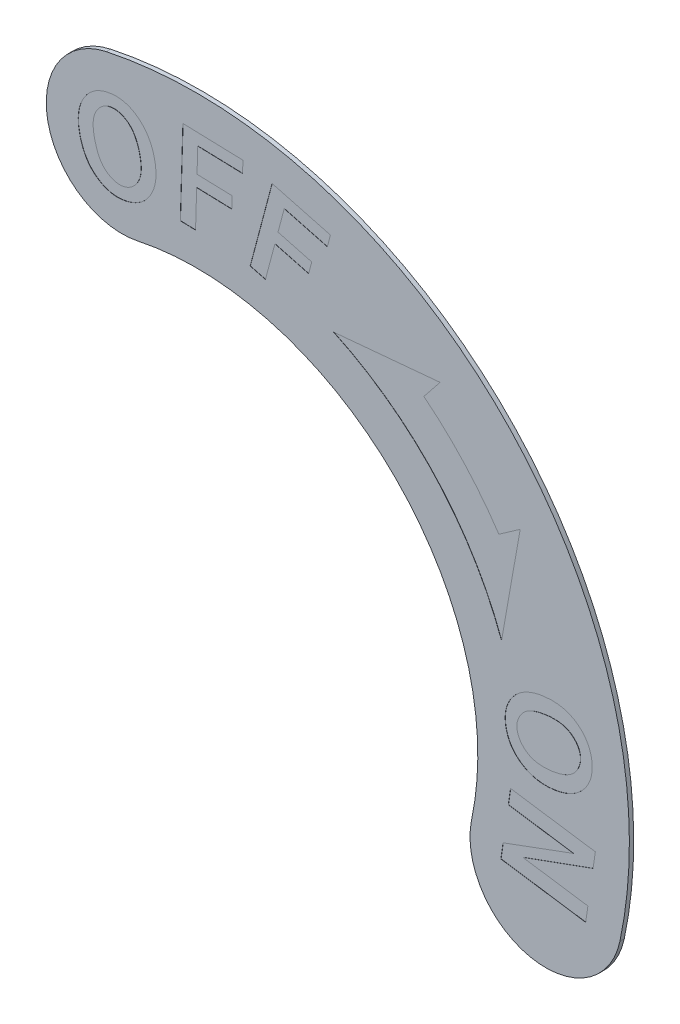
ISO-10303-21;
HEADER;
FILE_DESCRIPTION(('STEP AP214'),'2;1');
FILE_NAME('part.step','',(''),(''),'','','');
FILE_SCHEMA(('AUTOMOTIVE_DESIGN { 1 0 10303 214 1 1 1 1 }'));
ENDSEC;
DATA;
#1=APPLICATION_CONTEXT('core data for automotive mechanical design processes');
#2=APPLICATION_PROTOCOL_DEFINITION('international standard','automotive_design',2000,#1);
#3=PRODUCT_CONTEXT('',#1,'mechanical');
#4=PRODUCT('Part','Part','',(#3));
#5=PRODUCT_RELATED_PRODUCT_CATEGORY('part','',(#4));
#6=PRODUCT_DEFINITION_FORMATION('','',#4);
#7=PRODUCT_DEFINITION_CONTEXT('part definition',#1,'design');
#8=PRODUCT_DEFINITION('design','',#6,#7);
#9=PRODUCT_DEFINITION_SHAPE('','',#8);
#10=(LENGTH_UNIT() NAMED_UNIT(*) SI_UNIT(.MILLI.,.METRE.));
#11=(NAMED_UNIT(*) PLANE_ANGLE_UNIT() SI_UNIT($,.RADIAN.));
#12=(NAMED_UNIT(*) SI_UNIT($,.STERADIAN.) SOLID_ANGLE_UNIT());
#13=UNCERTAINTY_MEASURE_WITH_UNIT(LENGTH_MEASURE(1.E-05),#10,'distance_accuracy_value','');
#14=(GEOMETRIC_REPRESENTATION_CONTEXT(3) GLOBAL_UNCERTAINTY_ASSIGNED_CONTEXT((#13)) GLOBAL_UNIT_ASSIGNED_CONTEXT((#10,
#11,#12)) REPRESENTATION_CONTEXT('',''));
#15=CARTESIAN_POINT('',(0.,0.,0.));
#16=DIRECTION('',(0.,0.,1.));
#17=DIRECTION('',(1.,0.,0.));
#18=AXIS2_PLACEMENT_3D('',#15,#16,#17);
#19=CARTESIAN_POINT('',(0.,0.,0.2));
#20=DIRECTION('',(0.,0.,1.));
#21=DIRECTION('',(0.,-1.,0.));
#22=AXIS2_PLACEMENT_3D('',#19,#20,#21);
#23=PLANE('',#22);
#24=CARTESIAN_POINT('',(0.,0.,0.2));
#25=DIRECTION('',(0.,0.,1.));
#26=DIRECTION('',(0.,-1.,0.));
#27=AXIS2_PLACEMENT_3D('',#24,#25,#26);
#28=CIRCLE('',#27,20.);
#29=CARTESIAN_POINT('',(19.5629520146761,-4.1582338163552,0.2));
#30=VERTEX_POINT('',#29);
#31=CARTESIAN_POINT('',(-4.15823381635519,19.5629520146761,0.2));
#32=VERTEX_POINT('',#31);
#33=EDGE_CURVE('E1023',#30,#32,#28,.T.);
#34=ORIENTED_EDGE('',*,*,#33,.T.);
#35=CARTESIAN_POINT('',(-3.43054289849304,16.1394354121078,0.2));
#36=DIRECTION('',(0.,0.,1.));
#37=DIRECTION('',(0.,-1.,0.));
#38=AXIS2_PLACEMENT_3D('',#35,#36,#37);
#39=CIRCLE('',#38,3.5);
#40=CARTESIAN_POINT('',(-2.70285198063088,12.7159188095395,0.2));
#41=VERTEX_POINT('',#40);
#42=EDGE_CURVE('E481',#32,#41,#39,.T.);
#43=ORIENTED_EDGE('',*,*,#42,.T.);
#44=CARTESIAN_POINT('',(0.,0.,0.2));
#45=DIRECTION('',(0.,0.,-1.));
#46=DIRECTION('',(0.,-1.,0.));
#47=AXIS2_PLACEMENT_3D('',#44,#45,#46);
#48=CIRCLE('',#47,13.);
#49=CARTESIAN_POINT('',(12.7159188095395,-2.70285198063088,0.2));
#50=VERTEX_POINT('',#49);
#51=EDGE_CURVE('E467',#41,#50,#48,.T.);
#52=ORIENTED_EDGE('',*,*,#51,.T.);
#53=CARTESIAN_POINT('',(16.1394354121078,-3.43054289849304,0.2));
#54=DIRECTION('',(0.,0.,1.));
#55=DIRECTION('',(0.,-1.,0.));
#56=AXIS2_PLACEMENT_3D('',#53,#54,#55);
#57=CIRCLE('',#56,3.5);
#58=EDGE_CURVE('E473',#50,#30,#57,.T.);
#59=ORIENTED_EDGE('',*,*,#58,.T.);
#60=EDGE_LOOP('',(#34,#43,#52,#59));
#61=FACE_BOUND('',#60,.T.);
#62=CARTESIAN_POINT('',(0.,0.,0.2));
#63=DIRECTION('',(0.,0.,-1.));
#64=DIRECTION('',(0.,-1.,0.));
#65=AXIS2_PLACEMENT_3D('',#62,#63,#64);
#66=CIRCLE('',#65,15.);
#67=CARTESIAN_POINT('',(6.33927392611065,13.5946168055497,0.2));
#68=VERTEX_POINT('',#67);
#69=CARTESIAN_POINT('',(14.0953893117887,5.13030214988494,0.2));
#70=VERTEX_POINT('',#69);
#71=EDGE_CURVE('E37',#68,#70,#66,.T.);
#72=ORIENTED_EDGE('',*,*,#71,.F.);
#73=DIRECTION('',(-0.995860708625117,-0.090892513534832,0.));
#74=VECTOR('',#73,1.);
#75=CARTESIAN_POINT('',(6.33927392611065,13.5946168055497,0.2));
#76=LINE('',#75,#74);
#77=CARTESIAN_POINT('',(11.2594404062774,14.0436819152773,0.2));
#78=VERTEX_POINT('',#77);
#79=EDGE_CURVE('E493',#78,#68,#76,.T.);
#80=ORIENTED_EDGE('',*,*,#79,.F.);
#81=DIRECTION('',(0.625524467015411,0.780204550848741,0.));
#82=VECTOR('',#81,1.);
#83=CARTESIAN_POINT('',(11.2594404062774,14.0436819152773,0.2));
#84=LINE('',#83,#82);
#85=CARTESIAN_POINT('',(10.5088110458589,13.1074364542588,0.2));
#86=VERTEX_POINT('',#85);
#87=EDGE_CURVE('E519',#86,#78,#84,.T.);
#88=ORIENTED_EDGE('',*,*,#87,.F.);
#89=CARTESIAN_POINT('',(0.,0.,0.2));
#90=DIRECTION('',(0.,0.,1.));
#91=DIRECTION('',(0.,-1.,0.));
#92=AXIS2_PLACEMENT_3D('',#89,#90,#91);
#93=CIRCLE('',#92,16.8);
#94=CARTESIAN_POINT('',(13.9734619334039,9.32643348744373,0.2));
#95=VERTEX_POINT('',#94);
#96=EDGE_CURVE('E516',#95,#86,#93,.T.);
#97=ORIENTED_EDGE('',*,*,#96,.F.);
#98=DIRECTION('',(-0.819152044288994,-0.573576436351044,0.));
#99=VECTOR('',#98,1.);
#100=CARTESIAN_POINT('',(14.9566731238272,10.0148853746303,0.2));
#101=LINE('',#100,#99);
#102=CARTESIAN_POINT('',(14.9566731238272,10.0148853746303,0.2));
#103=VERTEX_POINT('',#102);
#104=EDGE_CURVE('E513',#103,#95,#101,.T.);
#105=ORIENTED_EDGE('',*,*,#104,.F.);
#106=DIRECTION('',(0.173648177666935,0.984807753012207,0.));
#107=VECTOR('',#106,1.);
#108=CARTESIAN_POINT('',(14.0953893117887,5.13030214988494,0.2));
#109=LINE('',#108,#107);
#110=EDGE_CURVE('E510',#70,#103,#109,.T.);
#111=ORIENTED_EDGE('',*,*,#110,.F.);
#112=EDGE_LOOP('',(#72,#80,#88,#97,#105,#111));
#113=FACE_BOUND('',#112,.T.);
#114=DIRECTION('',(0.145254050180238,0.989394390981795,0.));
#115=VECTOR('',#114,1.);
#116=CARTESIAN_POINT('',(14.4079722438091,-1.27656261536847,0.2));
#117=LINE('',#116,#115);
#118=CARTESIAN_POINT('',(14.4079722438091,-1.27656261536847,0.2));
#119=VERTEX_POINT('',#118);
#120=CARTESIAN_POINT('',(14.5114717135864,-0.571578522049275,0.2));
#121=VERTEX_POINT('',#120);
#122=EDGE_CURVE('E674',#119,#121,#117,.T.);
#123=ORIENTED_EDGE('',*,*,#122,.T.);
#124=DIRECTION('',(0.989389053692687,-0.145290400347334,0.));
#125=VECTOR('',#124,1.);
#126=CARTESIAN_POINT('',(14.5114717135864,-0.571578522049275,0.2));
#127=LINE('',#126,#125);
#128=CARTESIAN_POINT('',(18.4283327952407,-1.14676409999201,0.2));
#129=VERTEX_POINT('',#128);
#130=EDGE_CURVE('E669',#121,#129,#127,.T.);
#131=ORIENTED_EDGE('',*,*,#130,.T.);
#132=DIRECTION('',(-0.145998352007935,-0.989284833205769,0.));
#133=VECTOR('',#132,1.);
#134=CARTESIAN_POINT('',(18.4283327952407,-1.14676409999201,0.2));
#135=LINE('',#134,#133);
#136=CARTESIAN_POINT('',(18.3222882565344,-1.8653218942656,0.2));
#137=VERTEX_POINT('',#136);
#138=EDGE_CURVE('E695',#129,#137,#135,.T.);
#139=ORIENTED_EDGE('',*,*,#138,.T.);
#140=DIRECTION('',(-0.939915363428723,-0.341407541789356,0.));
#141=VECTOR('',#140,1.);
#142=CARTESIAN_POINT('',(18.3222882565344,-1.8653218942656,0.2));
#143=LINE('',#142,#141);
#144=CARTESIAN_POINT('',(15.0781737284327,-3.04368880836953,0.2));
#145=VERTEX_POINT('',#144);
#146=EDGE_CURVE('E698',#137,#145,#143,.T.);
#147=ORIENTED_EDGE('',*,*,#146,.T.);
#148=DIRECTION('',(0.98936622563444,-0.145445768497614,0.));
#149=VECTOR('',#148,1.);
#150=CARTESIAN_POINT('',(15.0781737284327,-3.04368880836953,0.2));
#151=LINE('',#150,#149);
#152=CARTESIAN_POINT('',(18.0847484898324,-3.48568244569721,0.2));
#153=VERTEX_POINT('',#152);
#154=EDGE_CURVE('E701',#145,#153,#151,.T.);
#155=ORIENTED_EDGE('',*,*,#154,.T.);
#156=DIRECTION('',(-0.145254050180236,-0.989394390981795,0.));
#157=VECTOR('',#156,1.);
#158=CARTESIAN_POINT('',(18.0847484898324,-3.48568244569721,0.2));
#159=LINE('',#158,#157);
#160=CARTESIAN_POINT('',(17.9812490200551,-4.1906665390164,0.2));
#161=VERTEX_POINT('',#160);
#162=EDGE_CURVE('E704',#153,#161,#159,.T.);
#163=ORIENTED_EDGE('',*,*,#162,.T.);
#164=DIRECTION('',(-0.989389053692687,0.145290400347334,0.));
#165=VECTOR('',#164,1.);
#166=CARTESIAN_POINT('',(17.9812490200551,-4.1906665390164,0.2));
#167=LINE('',#166,#165);
#168=CARTESIAN_POINT('',(14.0643879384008,-3.61548096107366,0.2));
#169=VERTEX_POINT('',#168);
#170=EDGE_CURVE('E707',#161,#169,#167,.T.);
#171=ORIENTED_EDGE('',*,*,#170,.T.);
#172=DIRECTION('',(0.145459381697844,0.989364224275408,0.));
#173=VECTOR('',#172,1.);
#174=CARTESIAN_POINT('',(14.0643879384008,-3.61548096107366,0.2));
#175=LINE('',#174,#173);
#176=CARTESIAN_POINT('',(14.1670390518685,-2.91728371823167,0.2));
#177=VERTEX_POINT('',#176);
#178=EDGE_CURVE('E710',#169,#177,#175,.T.);
#179=ORIENTED_EDGE('',*,*,#178,.T.);
#180=DIRECTION('',(0.938049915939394,0.346500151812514,0.));
#181=VECTOR('',#180,1.);
#182=CARTESIAN_POINT('',(14.1670390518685,-2.91728371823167,0.2));
#183=LINE('',#182,#181);
#184=CARTESIAN_POINT('',(17.4145470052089,-1.7177078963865,0.2));
#185=VERTEX_POINT('',#184);
#186=EDGE_CURVE('E713',#177,#185,#183,.T.);
#187=ORIENTED_EDGE('',*,*,#186,.T.);
#188=DIRECTION('',(-0.989406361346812,0.145172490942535,0.));
#189=VECTOR('',#188,1.);
#190=CARTESIAN_POINT('',(17.4145470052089,-1.7177078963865,0.2));
#191=LINE('',#190,#189);
#192=EDGE_CURVE('E716',#185,#119,#191,.T.);
#193=ORIENTED_EDGE('',*,*,#192,.T.);
#194=EDGE_LOOP('',(#123,#131,#139,#147,#155,#163,#171,#179,#187,#193));
#195=FACE_BOUND('',#194,.T.);
#196=DIRECTION('',(-0.999547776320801,0.0300706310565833,0.));
#197=VECTOR('',#196,1.);
#198=CARTESIAN_POINT('',(-0.0359417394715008,14.4868438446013,0.2));
#199=LINE('',#198,#197);
#200=CARTESIAN_POINT('',(-0.0359417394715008,14.4868438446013,0.2));
#201=VERTEX_POINT('',#200);
#202=CARTESIAN_POINT('',(-0.740925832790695,14.5080527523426,0.2));
#203=VERTEX_POINT('',#202);
#204=EDGE_CURVE('E747',#201,#203,#199,.T.);
#205=ORIENTED_EDGE('',*,*,#204,.T.);
#206=DIRECTION('',(0.0302501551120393,0.999542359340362,0.));
#207=VECTOR('',#206,1.);
#208=CARTESIAN_POINT('',(-0.740925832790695,14.5080527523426,0.2));
#209=LINE('',#208,#207);
#210=CARTESIAN_POINT('',(-0.621307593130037,18.4605447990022,0.2));
#211=VERTEX_POINT('',#210);
#212=EDGE_CURVE('E766',#203,#211,#209,.T.);
#213=ORIENTED_EDGE('',*,*,#212,.T.);
#214=DIRECTION('',(0.999541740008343,-0.0302706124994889,0.));
#215=VECTOR('',#214,1.);
#216=CARTESIAN_POINT('',(-0.621307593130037,18.4605447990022,0.2));
#217=LINE('',#216,#215);
#218=CARTESIAN_POINT('',(2.15196918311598,18.3765575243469,0.2));
#219=VERTEX_POINT('',#218);
#220=EDGE_CURVE('E769',#211,#219,#217,.T.);
#221=ORIENTED_EDGE('',*,*,#220,.T.);
#222=DIRECTION('',(-0.0297208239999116,-0.999558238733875,0.));
#223=VECTOR('',#222,1.);
#224=CARTESIAN_POINT('',(2.15196918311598,18.3765575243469,0.2));
#225=LINE('',#224,#223);
#226=CARTESIAN_POINT('',(2.13585041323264,17.8344578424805,0.2));
#227=VERTEX_POINT('',#226);
#228=EDGE_CURVE('E773',#219,#227,#225,.T.);
#229=ORIENTED_EDGE('',*,*,#228,.T.);
#230=DIRECTION('',(-0.99953967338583,0.0303387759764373,0.));
#231=VECTOR('',#230,1.);
#232=CARTESIAN_POINT('',(2.13585041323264,17.8344578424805,0.2));
#233=LINE('',#232,#231);
#234=CARTESIAN_POINT('',(0.0675577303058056,17.8972362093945,0.2));
#235=VERTEX_POINT('',#234);
#236=EDGE_CURVE('E776',#227,#235,#233,.T.);
#237=ORIENTED_EDGE('',*,*,#236,.T.);
#238=DIRECTION('',(-0.0304013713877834,-0.999537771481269,0.));
#239=VECTOR('',#238,1.);
#240=CARTESIAN_POINT('',(0.0675577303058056,17.8972362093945,0.2));
#241=LINE('',#240,#239);
#242=CARTESIAN_POINT('',(0.0327751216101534,16.7536519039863,0.2));
#243=VERTEX_POINT('',#242);
#244=EDGE_CURVE('E779',#235,#243,#241,.T.);
#245=ORIENTED_EDGE('',*,*,#244,.T.);
#246=DIRECTION('',(0.999538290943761,-0.030384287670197,0.));
#247=VECTOR('',#246,1.);
#248=CARTESIAN_POINT('',(0.0327751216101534,16.7536519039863,0.2));
#249=LINE('',#248,#247);
#250=CARTESIAN_POINT('',(1.65143896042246,16.7044472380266,0.2));
#251=VERTEX_POINT('',#250);
#252=EDGE_CURVE('E782',#243,#251,#249,.T.);
#253=ORIENTED_EDGE('',*,*,#252,.T.);
#254=DIRECTION('',(-0.0297208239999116,-0.999558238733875,0.));
#255=VECTOR('',#254,1.);
#256=CARTESIAN_POINT('',(1.65143896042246,16.7044472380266,0.2));
#257=LINE('',#256,#255);
#258=CARTESIAN_POINT('',(1.6353201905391,16.1623475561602,0.2));
#259=VERTEX_POINT('',#258);
#260=EDGE_CURVE('E785',#251,#259,#257,.T.);
#261=ORIENTED_EDGE('',*,*,#260,.T.);
#262=DIRECTION('',(-0.999538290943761,0.030384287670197,0.));
#263=VECTOR('',#262,1.);
#264=CARTESIAN_POINT('',(1.6353201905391,16.1623475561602,0.2));
#265=LINE('',#264,#263);
#266=CARTESIAN_POINT('',(0.0166563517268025,16.2115522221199,0.2));
#267=VERTEX_POINT('',#266);
#268=EDGE_CURVE('E788',#259,#267,#265,.T.);
#269=ORIENTED_EDGE('',*,*,#268,.T.);
#270=DIRECTION('',(-0.0304826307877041,-0.999535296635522,0.));
#271=VECTOR('',#270,1.);
#272=CARTESIAN_POINT('',(0.0166563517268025,16.2115522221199,0.2));
#273=LINE('',#272,#271);
#274=EDGE_CURVE('E791',#267,#201,#273,.T.);
#275=ORIENTED_EDGE('',*,*,#274,.T.);
#276=EDGE_LOOP('',(#205,#213,#221,#229,#237,#245,#253,#261,#269,#275));
#277=FACE_BOUND('',#276,.T.);
#278=CARTESIAN_POINT('',(-3.21808976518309,14.0478861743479,0.2));
#279=CARTESIAN_POINT('',(-3.27418362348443,14.0360699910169,0.2));
#280=CARTESIAN_POINT('',(-3.38452396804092,14.0128267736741,0.2));
#281=CARTESIAN_POINT('',(-3.55084683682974,13.9968228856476,0.2));
#282=CARTESIAN_POINT('',(-3.7142538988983,13.9976798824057,0.2));
#283=CARTESIAN_POINT('',(-3.87486140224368,14.014586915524,0.2));
#284=CARTESIAN_POINT('',(-4.03268094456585,14.0477701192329,0.2));
#285=CARTESIAN_POINT('',(-4.18707812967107,14.097708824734,0.2));
#286=CARTESIAN_POINT('',(-4.3393640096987,14.1626692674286,0.2));
#287=CARTESIAN_POINT('',(-4.43574418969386,14.2187647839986,0.2));
#288=CARTESIAN_POINT('',(-4.48468573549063,14.2472499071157,0.2));
#289=B_SPLINE_CURVE_WITH_KNOTS('',3,(#278,#279,#280,#281,#282,#283,#284,#285,#286,#287,#288),
.UNSPECIFIED.,.F.,.F.,(4,1,1,1,1,1,1,1,4),(0.,0.130476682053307,0.256656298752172,
0.379666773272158,0.502067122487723,0.623830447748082,0.746237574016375,0.871140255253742,1.),.UNSPECIFIED.);
#290=CARTESIAN_POINT('',(-3.21808976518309,14.0478861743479,0.2));
#291=VERTEX_POINT('',#290);
#292=CARTESIAN_POINT('',(-4.48468573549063,14.2472499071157,0.2));
#293=VERTEX_POINT('',#292);
#294=EDGE_CURVE('E922',#291,#293,#289,.T.);
#295=ORIENTED_EDGE('',*,*,#294,.T.);
#296=CARTESIAN_POINT('',(-4.48468573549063,14.2472499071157,0.2));
#297=CARTESIAN_POINT('',(-4.53909433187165,14.283008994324,0.2));
#298=CARTESIAN_POINT('',(-4.64765524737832,14.3543587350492,0.2));
#299=CARTESIAN_POINT('',(-4.79353655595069,14.4846664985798,0.2));
#300=CARTESIAN_POINT('',(-4.92714158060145,14.6292363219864,0.2));
#301=CARTESIAN_POINT('',(-5.04503321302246,14.7918168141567,0.2));
#302=CARTESIAN_POINT('',(-5.1499174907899,14.9701941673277,0.2));
#303=CARTESIAN_POINT('',(-5.24040518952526,15.1651657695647,0.2));
#304=CARTESIAN_POINT('',(-5.31741185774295,15.3766490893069,0.2));
#305=CARTESIAN_POINT('',(-5.35577533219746,15.5250706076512,0.2));
#306=CARTESIAN_POINT('',(-5.37545986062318,15.6012265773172,0.2));
#307=B_SPLINE_CURVE_WITH_KNOTS('',3,(#296,#297,#298,#299,#300,#301,#302,#303,#304,#305,#306),
.UNSPECIFIED.,.F.,.F.,(4,1,1,1,1,1,1,1,4),(0.,0.117200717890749,0.233849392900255,
0.351441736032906,0.471423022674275,0.595018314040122,0.723841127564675,0.858301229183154,1.),.UNSPECIFIED.);
#308=CARTESIAN_POINT('',(-5.37545986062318,15.6012265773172,0.2));
#309=VERTEX_POINT('',#308);
#310=EDGE_CURVE('E865',#293,#309,#307,.T.);
#311=ORIENTED_EDGE('',*,*,#310,.T.);
#312=CARTESIAN_POINT('',(-5.37545986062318,15.6012265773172,0.2));
#313=CARTESIAN_POINT('',(-5.39198074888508,15.6779195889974,0.2));
#314=CARTESIAN_POINT('',(-5.42421938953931,15.8275773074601,0.2));
#315=CARTESIAN_POINT('',(-5.45053690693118,16.0507170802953,0.2));
#316=CARTESIAN_POINT('',(-5.45683408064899,16.2653770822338,0.2));
#317=CARTESIAN_POINT('',(-5.4435702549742,16.4713839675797,0.2));
#318=CARTESIAN_POINT('',(-5.4107061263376,16.669174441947,0.2));
#319=CARTESIAN_POINT('',(-5.35683356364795,16.8578928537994,0.2));
#320=CARTESIAN_POINT('',(-5.28428806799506,17.0392593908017,0.2));
#321=CARTESIAN_POINT('',(-5.21961402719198,17.1515857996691,0.2));
#322=CARTESIAN_POINT('',(-5.18712475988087,17.2080134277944,0.2));
#323=B_SPLINE_CURVE_WITH_KNOTS('',3,(#312,#313,#314,#315,#316,#317,#318,#319,#320,#321,#322),
.UNSPECIFIED.,.F.,.F.,(4,1,1,1,1,1,1,1,4),(0.,0.141580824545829,0.276278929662,
0.404988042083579,0.528811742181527,0.648418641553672,0.766237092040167,0.882568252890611,1.),.UNSPECIFIED.);
#324=CARTESIAN_POINT('',(-5.18712475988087,17.2080134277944,0.2));
#325=VERTEX_POINT('',#324);
#326=EDGE_CURVE('E873',#309,#325,#323,.T.);
#327=ORIENTED_EDGE('',*,*,#326,.T.);
#328=CARTESIAN_POINT('',(-5.18712475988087,17.2080134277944,0.2));
#329=CARTESIAN_POINT('',(-5.15602897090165,17.2552905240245,0.2));
#330=CARTESIAN_POINT('',(-5.094671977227,17.3485758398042,0.2));
#331=CARTESIAN_POINT('',(-4.98874103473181,17.4762941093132,0.2));
#332=CARTESIAN_POINT('',(-4.87299416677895,17.5908293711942,0.2));
#333=CARTESIAN_POINT('',(-4.74654874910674,17.691078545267,0.2));
#334=CARTESIAN_POINT('',(-4.61112606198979,17.7793189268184,0.2));
#335=CARTESIAN_POINT('',(-4.46510390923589,17.8530952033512,0.2));
#336=CARTESIAN_POINT('',(-4.30946353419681,17.9140630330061,0.2));
#337=CARTESIAN_POINT('',(-4.20053859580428,17.9426342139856,0.2));
#338=CARTESIAN_POINT('',(-4.14534321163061,17.9571120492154,0.2));
#339=B_SPLINE_CURVE_WITH_KNOTS('',3,(#328,#329,#330,#331,#332,#333,#334,#335,#336,#337,#338),
.UNSPECIFIED.,.F.,.F.,(4,1,1,1,1,1,1,1,4),(0.,0.128686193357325,0.253918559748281,
0.37677423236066,0.498573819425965,0.620478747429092,0.743936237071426,0.870245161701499,1.),.UNSPECIFIED.);
#340=CARTESIAN_POINT('',(-4.14534321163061,17.9571120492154,0.2));
#341=VERTEX_POINT('',#340);
#342=EDGE_CURVE('E882',#325,#341,#339,.T.);
#343=ORIENTED_EDGE('',*,*,#342,.T.);
#344=CARTESIAN_POINT('',(-4.14534321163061,17.9571120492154,0.2));
#345=CARTESIAN_POINT('',(-4.08670558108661,17.969499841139,0.2));
#346=CARTESIAN_POINT('',(-3.97129433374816,17.9938816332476,0.2));
#347=CARTESIAN_POINT('',(-3.79767108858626,18.0114216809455,0.2));
#348=CARTESIAN_POINT('',(-3.62801330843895,18.0127523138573,0.2));
#349=CARTESIAN_POINT('',(-3.46236810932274,17.9962205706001,0.2));
#350=CARTESIAN_POINT('',(-3.30041233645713,17.9643598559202,0.2));
#351=CARTESIAN_POINT('',(-3.14294344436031,17.9143067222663,0.2));
#352=CARTESIAN_POINT('',(-2.98882233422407,17.8495251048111,0.2));
#353=CARTESIAN_POINT('',(-2.89203597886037,17.7930698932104,0.2));
#354=CARTESIAN_POINT('',(-2.84311627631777,17.7645351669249,0.2));
#355=B_SPLINE_CURVE_WITH_KNOTS('',3,(#344,#345,#346,#347,#348,#349,#350,#351,#352,#353,#354),
.UNSPECIFIED.,.F.,.F.,(4,1,1,1,1,1,1,1,4),(0.,0.13285328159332,0.261483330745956,
0.386302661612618,0.508566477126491,0.630099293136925,0.751704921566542,0.874501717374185,1.),.UNSPECIFIED.);
#356=CARTESIAN_POINT('',(-2.84311627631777,17.7645351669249,0.2));
#357=VERTEX_POINT('',#356);
#358=EDGE_CURVE('E890',#341,#357,#355,.T.);
#359=ORIENTED_EDGE('',*,*,#358,.T.);
#360=CARTESIAN_POINT('',(-2.84311627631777,17.7645351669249,0.2));
#361=CARTESIAN_POINT('',(-2.78734104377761,17.7278804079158,0.2));
#362=CARTESIAN_POINT('',(-2.67622064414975,17.6548535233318,0.2));
#363=CARTESIAN_POINT('',(-2.52602776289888,17.5233206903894,0.2));
#364=CARTESIAN_POINT('',(-2.38945296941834,17.3776592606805,0.2));
#365=CARTESIAN_POINT('',(-2.26738215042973,17.2163748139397,0.2));
#366=CARTESIAN_POINT('',(-2.16112213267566,17.0389991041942,0.2));
#367=CARTESIAN_POINT('',(-2.07087914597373,16.8458349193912,0.2));
#368=CARTESIAN_POINT('',(-1.99225741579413,16.6383068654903,0.2));
#369=CARTESIAN_POINT('',(-1.95463038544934,16.4921434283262,0.2));
#370=CARTESIAN_POINT('',(-1.93537502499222,16.4173453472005,0.2));
#371=B_SPLINE_CURVE_WITH_KNOTS('',3,(#360,#361,#362,#363,#364,#365,#366,#367,#368,#369,#370),
.UNSPECIFIED.,.F.,.F.,(4,1,1,1,1,1,1,1,4),(0.,0.119867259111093,0.238810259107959,
0.357865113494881,0.478353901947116,0.601724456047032,0.728846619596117,0.861239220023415,1.),.UNSPECIFIED.);
#372=CARTESIAN_POINT('',(-1.93537502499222,16.4173453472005,0.2));
#373=VERTEX_POINT('',#372);
#374=EDGE_CURVE('E898',#357,#373,#371,.T.);
#375=ORIENTED_EDGE('',*,*,#374,.T.);
#376=CARTESIAN_POINT('',(-1.93537502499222,16.4173453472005,0.2));
#377=CARTESIAN_POINT('',(-1.91904083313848,16.3417952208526,0.2));
#378=CARTESIAN_POINT('',(-1.88706470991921,16.1938968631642,0.2));
#379=CARTESIAN_POINT('',(-1.86285748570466,15.972859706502,0.2));
#380=CARTESIAN_POINT('',(-1.85825190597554,15.75934574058,0.2));
#381=CARTESIAN_POINT('',(-1.8731399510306,15.5529789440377,0.2));
#382=CARTESIAN_POINT('',(-1.9086945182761,15.3535509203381,0.2));
#383=CARTESIAN_POINT('',(-1.96513492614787,15.1616436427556,0.2));
#384=CARTESIAN_POINT('',(-2.0411530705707,14.976934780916,0.2));
#385=CARTESIAN_POINT('',(-2.10741627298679,14.8616427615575,0.2));
#386=CARTESIAN_POINT('',(-2.14067725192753,14.8037716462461,0.2));
#387=B_SPLINE_CURVE_WITH_KNOTS('',3,(#376,#377,#378,#379,#380,#381,#382,#383,#384,#385,#386),
.UNSPECIFIED.,.F.,.F.,(4,1,1,1,1,1,1,1,4),(0.,0.138705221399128,0.271531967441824,
0.398488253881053,0.521696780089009,0.642402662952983,0.761453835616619,0.880261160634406,1.),.UNSPECIFIED.);
#388=CARTESIAN_POINT('',(-2.14067725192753,14.8037716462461,0.2));
#389=VERTEX_POINT('',#388);
#390=EDGE_CURVE('E906',#373,#389,#387,.T.);
#391=ORIENTED_EDGE('',*,*,#390,.T.);
#392=CARTESIAN_POINT('',(-2.14067725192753,14.8037716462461,0.2));
#393=CARTESIAN_POINT('',(-2.17169260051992,14.7564333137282,0.2));
#394=CARTESIAN_POINT('',(-2.23308944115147,14.6627240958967,0.2));
#395=CARTESIAN_POINT('',(-2.34085925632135,14.5351834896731,0.2));
#396=CARTESIAN_POINT('',(-2.45949980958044,14.4207547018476,0.2));
#397=CARTESIAN_POINT('',(-2.58928948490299,14.3190542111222,0.2));
#398=CARTESIAN_POINT('',(-2.73042935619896,14.2308258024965,0.2));
#399=CARTESIAN_POINT('',(-2.88284689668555,14.1558375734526,0.2));
#400=CARTESIAN_POINT('',(-3.04589949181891,14.093516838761,0.2));
#401=CARTESIAN_POINT('',(-3.16008441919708,14.0632576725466,0.2));
#402=CARTESIAN_POINT('',(-3.21808976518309,14.0478861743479,0.2));
#403=B_SPLINE_CURVE_WITH_KNOTS('',3,(#392,#393,#394,#395,#396,#397,#398,#399,#400,#401,#402),
.UNSPECIFIED.,.F.,.F.,(4,1,1,1,1,1,1,1,4),(0.,0.125465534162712,0.248366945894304,
0.369495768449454,0.490605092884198,0.613500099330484,0.738074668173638,0.866943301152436,1.),.UNSPECIFIED.);
#404=EDGE_CURVE('E914',#389,#291,#403,.T.);
#405=ORIENTED_EDGE('',*,*,#404,.T.);
#406=EDGE_LOOP('',(#295,#311,#327,#343,#359,#375,#391,#405));
#407=FACE_BOUND('',#406,.T.);
#408=DIRECTION('',(-0.96669676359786,0.255924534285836,0.));
#409=VECTOR('',#408,1.);
#410=CARTESIAN_POINT('',(3.19161279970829,14.1250623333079,0.2));
#411=LINE('',#410,#409);
#412=CARTESIAN_POINT('',(3.19161279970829,14.1250623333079,0.2));
#413=VERTEX_POINT('',#412);
#414=CARTESIAN_POINT('',(2.4866287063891,14.3117007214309,0.2));
#415=VERTEX_POINT('',#414);
#416=EDGE_CURVE('E954',#413,#415,#411,.T.);
#417=ORIENTED_EDGE('',*,*,#416,.T.);
#418=DIRECTION('',(0.256697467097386,0.966491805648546,0.));
#419=VECTOR('',#418,1.);
#420=CARTESIAN_POINT('',(2.4866287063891,14.3117007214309,0.2));
#421=LINE('',#420,#419);
#422=CARTESIAN_POINT('',(3.49786942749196,18.1191238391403,0.2));
#423=VERTEX_POINT('',#422);
#424=EDGE_CURVE('E817',#415,#423,#421,.T.);
#425=ORIENTED_EDGE('',*,*,#424,.T.);
#426=DIRECTION('',(0.966552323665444,-0.256469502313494,0.));
#427=VECTOR('',#426,1.);
#428=CARTESIAN_POINT('',(3.49786942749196,18.1191238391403,0.2));
#429=LINE('',#428,#427);
#430=CARTESIAN_POINT('',(6.19309742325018,17.4039594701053,0.2));
#431=VERTEX_POINT('',#430);
#432=EDGE_CURVE('E975',#423,#431,#429,.T.);
#433=ORIENTED_EDGE('',*,*,#432,.T.);
#434=DIRECTION('',(-0.255684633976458,-0.966760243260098,0.));
#435=VECTOR('',#434,1.);
#436=CARTESIAN_POINT('',(6.19309742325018,17.4039594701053,0.2));
#437=LINE('',#436,#435);
#438=CARTESIAN_POINT('',(6.04972520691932,16.8618597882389,0.2));
#439=VERTEX_POINT('',#438);
#440=EDGE_CURVE('E978',#431,#439,#437,.T.);
#441=ORIENTED_EDGE('',*,*,#440,.T.);
#442=DIRECTION('',(-0.96650109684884,0.256662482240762,0.));
#443=VECTOR('',#442,1.);
#444=CARTESIAN_POINT('',(6.04972520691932,16.8618597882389,0.2));
#445=LINE('',#444,#443);
#446=CARTESIAN_POINT('',(4.05948130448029,17.3903857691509,0.2));
#447=VERTEX_POINT('',#446);
#448=EDGE_CURVE('E981',#439,#447,#445,.T.);
#449=ORIENTED_EDGE('',*,*,#448,.T.);
#450=DIRECTION('',(-0.256622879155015,-0.966511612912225,0.));
#451=VECTOR('',#450,1.);
#452=CARTESIAN_POINT('',(4.05948130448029,17.3903857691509,0.2));
#453=LINE('',#452,#451);
#454=CARTESIAN_POINT('',(3.77273687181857,16.3104281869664,0.2));
#455=VERTEX_POINT('',#454);
#456=EDGE_CURVE('E984',#447,#455,#453,.T.);
#457=ORIENTED_EDGE('',*,*,#456,.T.);
#458=DIRECTION('',(0.966444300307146,-0.256876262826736,0.));
#459=VECTOR('',#458,1.);
#460=CARTESIAN_POINT('',(3.77273687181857,16.3104281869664,0.2));
#461=LINE('',#460,#459);
#462=CARTESIAN_POINT('',(5.33031905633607,15.8964303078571,0.2));
#463=VERTEX_POINT('',#462);
#464=EDGE_CURVE('E987',#455,#463,#461,.T.);
#465=ORIENTED_EDGE('',*,*,#464,.T.);
#466=DIRECTION('',(-0.257097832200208,-0.966385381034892,0.));
#467=VECTOR('',#466,1.);
#468=CARTESIAN_POINT('',(5.33031905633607,15.8964303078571,0.2));
#469=LINE('',#468,#467);
#470=CARTESIAN_POINT('',(5.18609848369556,15.3543306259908,0.2));
#471=VERTEX_POINT('',#470);
#472=EDGE_CURVE('E990',#463,#471,#469,.T.);
#473=ORIENTED_EDGE('',*,*,#472,.T.);
#474=DIRECTION('',(-0.966444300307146,0.256876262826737,0.));
#475=VECTOR('',#474,1.);
#476=CARTESIAN_POINT('',(5.18609848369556,15.3543306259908,0.2));
#477=LINE('',#476,#475);
#478=CARTESIAN_POINT('',(3.62851629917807,15.7683285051,0.2));
#479=VERTEX_POINT('',#478);
#480=EDGE_CURVE('E993',#471,#479,#477,.T.);
#481=ORIENTED_EDGE('',*,*,#480,.T.);
#482=DIRECTION('',(-0.256948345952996,-0.96642513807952,0.));
#483=VECTOR('',#482,1.);
#484=CARTESIAN_POINT('',(3.62851629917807,15.7683285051,0.2));
#485=LINE('',#484,#483);
#486=EDGE_CURVE('E996',#479,#413,#485,.T.);
#487=ORIENTED_EDGE('',*,*,#486,.T.);
#488=EDGE_LOOP('',(#417,#425,#433,#441,#449,#457,#465,#473,#481,#487));
#489=FACE_BOUND('',#488,.T.);
#490=CARTESIAN_POINT('',(14.2797479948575,1.88560549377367,0.2));
#491=CARTESIAN_POINT('',(14.2736274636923,1.94237174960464,0.2));
#492=CARTESIAN_POINT('',(14.2615624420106,2.05427153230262,0.2));
#493=CARTESIAN_POINT('',(14.2614832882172,2.2214645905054,0.2));
#494=CARTESIAN_POINT('',(14.2788874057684,2.38419929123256,0.2));
#495=CARTESIAN_POINT('',(14.310794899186,2.54266095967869,0.2));
#496=CARTESIAN_POINT('',(14.3595613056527,2.69650037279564,0.2));
#497=CARTESIAN_POINT('',(14.4248799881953,2.84525241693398,0.2));
#498=CARTESIAN_POINT('',(14.5039881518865,2.99093442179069,0.2));
#499=CARTESIAN_POINT('',(14.5696731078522,3.08106138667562,0.2));
#500=CARTESIAN_POINT('',(14.6029717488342,3.1267507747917,0.2));
#501=B_SPLINE_CURVE_WITH_KNOTS('',3,(#490,#491,#492,#493,#494,#495,#496,#497,#498,#499,#500),
.UNSPECIFIED.,.F.,.F.,(4,1,1,1,1,1,1,1,4),(0.,0.129921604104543,0.256106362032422,
0.379744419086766,0.501964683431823,0.62352015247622,0.746351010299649,0.871413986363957,1.),.UNSPECIFIED.);
#502=CARTESIAN_POINT('',(14.2797479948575,1.88560549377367,0.2));
#503=VERTEX_POINT('',#502);
#504=CARTESIAN_POINT('',(14.6029717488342,3.1267507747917,0.2));
#505=VERTEX_POINT('',#504);
#506=EDGE_CURVE('E640',#503,#505,#501,.T.);
#507=ORIENTED_EDGE('',*,*,#506,.T.);
#508=CARTESIAN_POINT('',(14.6029717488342,3.1267507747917,0.2));
#509=CARTESIAN_POINT('',(14.6439770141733,3.17726485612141,0.2));
#510=CARTESIAN_POINT('',(14.7258756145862,3.27815513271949,0.2));
#511=CARTESIAN_POINT('',(14.8691024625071,3.41115322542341,0.2));
#512=CARTESIAN_POINT('',(15.0264124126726,3.52953437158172,0.2));
#513=CARTESIAN_POINT('',(15.1995385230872,3.63105773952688,0.2));
#514=CARTESIAN_POINT('',(15.3873153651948,3.71807071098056,0.2));
#515=CARTESIAN_POINT('',(15.590041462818,3.78871813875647,0.2));
#516=CARTESIAN_POINT('',(15.8075085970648,3.84585469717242,0.2));
#517=CARTESIAN_POINT('',(15.9589377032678,3.86903622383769,0.2));
#518=CARTESIAN_POINT('',(16.0366939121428,3.88093953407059,0.2));
#519=B_SPLINE_CURVE_WITH_KNOTS('',3,(#508,#509,#510,#511,#512,#513,#514,#515,#516,#517,#518),
.UNSPECIFIED.,.F.,.F.,(4,1,1,1,1,1,1,1,4),(0.,0.117195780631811,0.234071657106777,
0.351349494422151,0.471592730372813,0.595241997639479,0.723935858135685,0.858245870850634,1.),.UNSPECIFIED.);
#520=CARTESIAN_POINT('',(16.0366939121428,3.88093953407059,0.2));
#521=VERTEX_POINT('',#520);
#522=EDGE_CURVE('E583',#505,#521,#519,.T.);
#523=ORIENTED_EDGE('',*,*,#522,.T.);
#524=CARTESIAN_POINT('',(16.0366939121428,3.88093953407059,0.2));
#525=CARTESIAN_POINT('',(16.1146426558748,3.88986937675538,0.2));
#526=CARTESIAN_POINT('',(16.2668101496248,3.90730175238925,0.2));
#527=CARTESIAN_POINT('',(16.4916483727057,3.91116062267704,0.2));
#528=CARTESIAN_POINT('',(16.706294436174,3.89723536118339,0.2));
#529=CARTESIAN_POINT('',(16.9107499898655,3.86453511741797,0.2));
#530=CARTESIAN_POINT('',(17.1047031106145,3.81215150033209,0.2));
#531=CARTESIAN_POINT('',(17.2871298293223,3.73863682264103,0.2));
#532=CARTESIAN_POINT('',(17.4612879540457,3.65000592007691,0.2));
#533=CARTESIAN_POINT('',(17.5668643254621,3.57437535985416,0.2));
#534=CARTESIAN_POINT('',(17.6197267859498,3.53650687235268,0.2));
#535=B_SPLINE_CURVE_WITH_KNOTS('',3,(#524,#525,#526,#527,#528,#529,#530,#531,#532,#533,#534),
.UNSPECIFIED.,.F.,.F.,(4,1,1,1,1,1,1,1,4),(0.,0.141392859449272,0.276019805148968,
0.404796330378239,0.528767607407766,0.648744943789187,0.76614657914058,0.882908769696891,1.),.UNSPECIFIED.);
#536=CARTESIAN_POINT('',(17.6197267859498,3.53650687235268,0.2));
#537=VERTEX_POINT('',#536);
#538=EDGE_CURVE('E591',#521,#537,#535,.T.);
#539=ORIENTED_EDGE('',*,*,#538,.T.);
#540=CARTESIAN_POINT('',(17.6197267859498,3.53650687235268,0.2));
#541=CARTESIAN_POINT('',(17.6637147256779,3.50113056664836,0.2));
#542=CARTESIAN_POINT('',(17.7505822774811,3.4312693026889,0.2));
#543=CARTESIAN_POINT('',(17.8669364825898,3.3133803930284,0.2));
#544=CARTESIAN_POINT('',(17.9697906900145,3.18730555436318,0.2));
#545=CARTESIAN_POINT('',(18.0571381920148,3.0518967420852,0.2));
#546=CARTESIAN_POINT('',(18.1308320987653,2.90810984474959,0.2));
#547=CARTESIAN_POINT('',(18.1899293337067,2.75600463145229,0.2));
#548=CARTESIAN_POINT('',(18.2359865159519,2.5953187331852,0.2));
#549=CARTESIAN_POINT('',(18.2537466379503,2.48421930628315,0.2));
#550=CARTESIAN_POINT('',(18.2627808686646,2.42770517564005,0.2));
#551=B_SPLINE_CURVE_WITH_KNOTS('',3,(#540,#541,#542,#543,#544,#545,#546,#547,#548,#549,#550),
.UNSPECIFIED.,.F.,.F.,(4,1,1,1,1,1,1,1,4),(0.,0.128498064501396,0.253758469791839,
0.376494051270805,0.498527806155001,0.62010166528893,0.743909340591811,0.869731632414,1.),.UNSPECIFIED.);
#552=CARTESIAN_POINT('',(18.2627808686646,2.42770517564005,0.2));
#553=VERTEX_POINT('',#552);
#554=EDGE_CURVE('E600',#537,#553,#551,.T.);
#555=ORIENTED_EDGE('',*,*,#554,.T.);
#556=CARTESIAN_POINT('',(18.2627808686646,2.42770517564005,0.2));
#557=CARTESIAN_POINT('',(18.269667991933,2.36811758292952,0.2));
#558=CARTESIAN_POINT('',(18.2832165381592,2.25089516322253,0.2));
#559=CARTESIAN_POINT('',(18.2821116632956,2.07640239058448,0.2));
#560=CARTESIAN_POINT('',(18.2675114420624,1.90763713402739,0.2));
#561=CARTESIAN_POINT('',(18.2360767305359,1.74431411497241,0.2));
#562=CARTESIAN_POINT('',(18.1873319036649,1.58658552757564,0.2));
#563=CARTESIAN_POINT('',(18.1222940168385,1.43455576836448,0.2));
#564=CARTESIAN_POINT('',(18.0429995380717,1.28692980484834,0.2));
#565=CARTESIAN_POINT('',(17.9771172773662,1.19604393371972,0.2));
#566=CARTESIAN_POINT('',(17.9437988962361,1.15008057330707,0.2));
#567=B_SPLINE_CURVE_WITH_KNOTS('',3,(#556,#557,#558,#559,#560,#561,#562,#563,#564,#565,#566),
.UNSPECIFIED.,.F.,.F.,(4,1,1,1,1,1,1,1,4),(0.,0.132887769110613,0.261420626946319,
0.386076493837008,0.508057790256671,0.629431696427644,0.751359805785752,0.874256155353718,1.),.UNSPECIFIED.);
#568=CARTESIAN_POINT('',(17.9437988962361,1.15008057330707,0.2));
#569=VERTEX_POINT('',#568);
#570=EDGE_CURVE('E608',#553,#569,#567,.T.);
#571=ORIENTED_EDGE('',*,*,#570,.T.);
#572=CARTESIAN_POINT('',(17.9437988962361,1.15008057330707,0.2));
#573=CARTESIAN_POINT('',(17.9016416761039,1.09817582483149,0.2));
#574=CARTESIAN_POINT('',(17.817831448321,0.994987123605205,0.2));
#575=CARTESIAN_POINT('',(17.6724363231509,0.858090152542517,0.2));
#576=CARTESIAN_POINT('',(17.5145404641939,0.736073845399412,0.2));
#577=CARTESIAN_POINT('',(17.3416195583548,0.631279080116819,0.2));
#578=CARTESIAN_POINT('',(17.1548145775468,0.542705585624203,0.2));
#579=CARTESIAN_POINT('',(16.953385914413,0.471182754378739,0.2));
#580=CARTESIAN_POINT('',(16.7385041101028,0.413240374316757,0.2));
#581=CARTESIAN_POINT('',(16.5889740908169,0.389962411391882,0.2));
#582=CARTESIAN_POINT('',(16.5126218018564,0.378076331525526,0.2));
#583=B_SPLINE_CURVE_WITH_KNOTS('',3,(#572,#573,#574,#575,#576,#577,#578,#579,#580,#581,#582),
.UNSPECIFIED.,.F.,.F.,(4,1,1,1,1,1,1,1,4),(0.,0.119988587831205,0.238542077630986,
0.357706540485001,0.477828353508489,0.600966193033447,0.7283709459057,0.861302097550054,1.),.UNSPECIFIED.);
#584=CARTESIAN_POINT('',(16.5126218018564,0.378076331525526,0.2));
#585=VERTEX_POINT('',#584);
#586=EDGE_CURVE('E616',#569,#585,#583,.T.);
#587=ORIENTED_EDGE('',*,*,#586,.T.);
#588=CARTESIAN_POINT('',(16.5126218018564,0.378076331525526,0.2));
#589=CARTESIAN_POINT('',(16.435801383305,0.369441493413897,0.2));
#590=CARTESIAN_POINT('',(16.2855931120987,0.352557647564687,0.2));
#591=CARTESIAN_POINT('',(16.0632571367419,0.349362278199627,0.2));
#592=CARTESIAN_POINT('',(15.8502095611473,0.365019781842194,0.2));
#593=CARTESIAN_POINT('',(15.6463612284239,0.400575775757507,0.2));
#594=CARTESIAN_POINT('',(15.4515164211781,0.455918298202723,0.2));
#595=CARTESIAN_POINT('',(15.266293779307,0.530981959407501,0.2));
#596=CARTESIAN_POINT('',(15.0894173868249,0.624012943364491,0.2));
#597=CARTESIAN_POINT('',(14.9813608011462,0.701416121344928,0.2));
#598=CARTESIAN_POINT('',(14.9270438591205,0.740324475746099,0.2));
#599=B_SPLINE_CURVE_WITH_KNOTS('',3,(#588,#589,#590,#591,#592,#593,#594,#595,#596,#597,#598),
.UNSPECIFIED.,.F.,.F.,(4,1,1,1,1,1,1,1,4),(0.,0.138742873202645,0.271286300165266,
0.398594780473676,0.521811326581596,0.642195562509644,0.761567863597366,0.880147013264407,1.),.UNSPECIFIED.);
#600=CARTESIAN_POINT('',(14.9270438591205,0.740324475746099,0.2));
#601=VERTEX_POINT('',#600);
#602=EDGE_CURVE('E624',#585,#601,#599,.T.);
#603=ORIENTED_EDGE('',*,*,#602,.T.);
#604=CARTESIAN_POINT('',(14.9270438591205,0.740324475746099,0.2));
#605=CARTESIAN_POINT('',(14.8830275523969,0.775957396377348,0.2));
#606=CARTESIAN_POINT('',(14.7959285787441,0.846467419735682,0.2));
#607=CARTESIAN_POINT('',(14.6795112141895,0.966104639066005,0.2));
#608=CARTESIAN_POINT('',(14.5768377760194,1.09508415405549,0.2));
#609=CARTESIAN_POINT('',(14.4881083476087,1.23396216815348,0.2));
#610=CARTESIAN_POINT('',(14.4141443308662,1.3831040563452,0.2));
#611=CARTESIAN_POINT('',(14.3549967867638,1.54189058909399,0.2));
#612=CARTESIAN_POINT('',(14.3083196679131,1.70989465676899,0.2));
#613=CARTESIAN_POINT('',(14.289395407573,1.82627557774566,0.2));
#614=CARTESIAN_POINT('',(14.2797479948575,1.88560549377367,0.2));
#615=B_SPLINE_CURVE_WITH_KNOTS('',3,(#604,#605,#606,#607,#608,#609,#610,#611,#612,#613,#614),
.UNSPECIFIED.,.F.,.F.,(4,1,1,1,1,1,1,1,4),(0.,0.125620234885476,0.248575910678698,
0.369645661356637,0.491014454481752,0.613689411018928,0.738437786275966,0.866658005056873,1.),.UNSPECIFIED.);
#616=EDGE_CURVE('E632',#601,#503,#615,.T.);
#617=ORIENTED_EDGE('',*,*,#616,.T.);
#618=EDGE_LOOP('',(#507,#523,#539,#555,#571,#587,#603,#617));
#619=FACE_BOUND('',#618,.T.);
#620=ADVANCED_FACE('F14',(#61,#113,#195,#277,#407,#489,#619),#23,.T.);
#621=CARTESIAN_POINT('',(0.,0.,0.));
#622=DIRECTION('',(0.,0.,1.));
#623=DIRECTION('',(0.,-1.,0.));
#624=AXIS2_PLACEMENT_3D('',#621,#622,#623);
#625=PLANE('',#624);
#626=CARTESIAN_POINT('',(-3.43054289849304,16.1394354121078,0.));
#627=DIRECTION('',(0.,0.,1.));
#628=DIRECTION('',(0.,-1.,0.));
#629=AXIS2_PLACEMENT_3D('',#626,#627,#628);
#630=CIRCLE('',#629,3.5);
#631=CARTESIAN_POINT('',(-4.15823381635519,19.5629520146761,0.));
#632=VERTEX_POINT('',#631);
#633=CARTESIAN_POINT('',(-2.70285198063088,12.7159188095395,0.));
#634=VERTEX_POINT('',#633);
#635=EDGE_CURVE('E487',#632,#634,#630,.T.);
#636=ORIENTED_EDGE('',*,*,#635,.F.);
#637=CARTESIAN_POINT('',(0.,0.,0.));
#638=DIRECTION('',(0.,0.,1.));
#639=DIRECTION('',(0.,-1.,0.));
#640=AXIS2_PLACEMENT_3D('',#637,#638,#639);
#641=CIRCLE('',#640,20.);
#642=CARTESIAN_POINT('',(19.5629520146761,-4.1582338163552,0.));
#643=VERTEX_POINT('',#642);
#644=EDGE_CURVE('E1022',#643,#632,#641,.T.);
#645=ORIENTED_EDGE('',*,*,#644,.F.);
#646=CARTESIAN_POINT('',(16.1394354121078,-3.43054289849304,0.));
#647=DIRECTION('',(0.,0.,1.));
#648=DIRECTION('',(0.,-1.,0.));
#649=AXIS2_PLACEMENT_3D('',#646,#647,#648);
#650=CIRCLE('',#649,3.5);
#651=CARTESIAN_POINT('',(12.7159188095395,-2.70285198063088,0.));
#652=VERTEX_POINT('',#651);
#653=EDGE_CURVE('E29',#652,#643,#650,.T.);
#654=ORIENTED_EDGE('',*,*,#653,.F.);
#655=CARTESIAN_POINT('',(0.,0.,0.));
#656=DIRECTION('',(0.,0.,1.));
#657=DIRECTION('',(0.,-1.,0.));
#658=AXIS2_PLACEMENT_3D('',#655,#656,#657);
#659=CIRCLE('',#658,13.);
#660=EDGE_CURVE('E9',#634,#652,#659,.F.);
#661=ORIENTED_EDGE('',*,*,#660,.F.);
#662=EDGE_LOOP('',(#636,#645,#654,#661));
#663=FACE_BOUND('',#662,.T.);
#664=ADVANCED_FACE('F1034',(#663),#625,.F.);
#665=CARTESIAN_POINT('',(0.,0.,0.2));
#666=DIRECTION('',(0.,0.,-1.));
#667=DIRECTION('',(0.,1.,0.));
#668=AXIS2_PLACEMENT_3D('',#665,#666,#667);
#669=CYLINDRICAL_SURFACE('',#668,20.);
#670=ORIENTED_EDGE('',*,*,#644,.T.);
#671=DIRECTION('',(0.,0.,1.));
#672=VECTOR('',#671,1.);
#673=CARTESIAN_POINT('',(-4.1582338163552,19.5629520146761,-4.8));
#674=LINE('',#673,#672);
#675=EDGE_CURVE('E22',#632,#32,#674,.T.);
#676=ORIENTED_EDGE('',*,*,#675,.T.);
#677=ORIENTED_EDGE('',*,*,#33,.F.);
#678=DIRECTION('',(0.,0.,1.));
#679=VECTOR('',#678,1.);
#680=CARTESIAN_POINT('',(19.5629520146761,-4.1582338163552,-4.8));
#681=LINE('',#680,#679);
#682=EDGE_CURVE('E475',#643,#30,#681,.T.);
#683=ORIENTED_EDGE('',*,*,#682,.F.);
#684=EDGE_LOOP('',(#670,#676,#677,#683));
#685=FACE_BOUND('',#684,.T.);
#686=ADVANCED_FACE('F16',(#685),#669,.T.);
#687=CARTESIAN_POINT('',(2.4866287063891,14.3117007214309,0.19));
#688=DIRECTION('',(0.966491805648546,-0.256697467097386,0.));
#689=DIRECTION('',(0.256697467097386,0.966491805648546,0.));
#690=AXIS2_PLACEMENT_3D('',#687,#688,#689);
#691=PLANE('',#690);
#692=ORIENTED_EDGE('',*,*,#424,.F.);
#693=DIRECTION('',(0.,0.,1.));
#694=VECTOR('',#693,1.);
#695=CARTESIAN_POINT('',(2.4866287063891,14.3117007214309,0.19));
#696=LINE('',#695,#694);
#697=CARTESIAN_POINT('',(2.4866287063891,14.3117007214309,0.19));
#698=VERTEX_POINT('',#697);
#699=EDGE_CURVE('E972',#698,#415,#696,.T.);
#700=ORIENTED_EDGE('',*,*,#699,.F.);
#701=DIRECTION('',(0.256697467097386,0.966491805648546,0.));
#702=VECTOR('',#701,1.);
#703=CARTESIAN_POINT('',(2.4866287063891,14.3117007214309,0.19));
#704=LINE('',#703,#702);
#705=CARTESIAN_POINT('',(3.49786942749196,18.1191238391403,0.19));
#706=VERTEX_POINT('',#705);
#707=EDGE_CURVE('E950',#698,#706,#704,.T.);
#708=ORIENTED_EDGE('',*,*,#707,.T.);
#709=DIRECTION('',(0.,0.,1.));
#710=VECTOR('',#709,1.);
#711=CARTESIAN_POINT('',(3.49786942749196,18.1191238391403,0.19));
#712=LINE('',#711,#710);
#713=EDGE_CURVE('E1019',#706,#423,#712,.T.);
#714=ORIENTED_EDGE('',*,*,#713,.T.);
#715=EDGE_LOOP('',(#692,#700,#708,#714));
#716=FACE_BOUND('',#715,.T.);
#717=ADVANCED_FACE('F1041',(#716),#691,.T.);
#718=CARTESIAN_POINT('',(3.49786942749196,18.1191238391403,0.19));
#719=DIRECTION('',(-0.256469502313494,-0.966552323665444,0.));
#720=DIRECTION('',(0.966552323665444,-0.256469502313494,0.));
#721=AXIS2_PLACEMENT_3D('',#718,#719,#720);
#722=PLANE('',#721);
#723=ORIENTED_EDGE('',*,*,#432,.F.);
#724=ORIENTED_EDGE('',*,*,#713,.F.);
#725=DIRECTION('',(0.966552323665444,-0.256469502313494,0.));
#726=VECTOR('',#725,1.);
#727=CARTESIAN_POINT('',(3.49786942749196,18.1191238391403,0.19));
#728=LINE('',#727,#726);
#729=CARTESIAN_POINT('',(6.19309742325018,17.4039594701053,0.19));
#730=VERTEX_POINT('',#729);
#731=EDGE_CURVE('E953',#706,#730,#728,.T.);
#732=ORIENTED_EDGE('',*,*,#731,.T.);
#733=DIRECTION('',(0.,0.,1.));
#734=VECTOR('',#733,1.);
#735=CARTESIAN_POINT('',(6.19309742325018,17.4039594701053,0.19));
#736=LINE('',#735,#734);
#737=EDGE_CURVE('E1017',#730,#431,#736,.T.);
#738=ORIENTED_EDGE('',*,*,#737,.T.);
#739=EDGE_LOOP('',(#723,#724,#732,#738));
#740=FACE_BOUND('',#739,.T.);
#741=ADVANCED_FACE('F1049',(#740),#722,.T.);
#742=CARTESIAN_POINT('',(6.19309742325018,17.4039594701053,0.19));
#743=DIRECTION('',(-0.966760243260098,0.255684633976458,0.));
#744=DIRECTION('',(-0.255684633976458,-0.966760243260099,0.));
#745=AXIS2_PLACEMENT_3D('',#742,#743,#744);
#746=PLANE('',#745);
#747=ORIENTED_EDGE('',*,*,#440,.F.);
#748=ORIENTED_EDGE('',*,*,#737,.F.);
#749=DIRECTION('',(-0.255684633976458,-0.966760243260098,0.));
#750=VECTOR('',#749,1.);
#751=CARTESIAN_POINT('',(6.19309742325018,17.4039594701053,0.19));
#752=LINE('',#751,#750);
#753=CARTESIAN_POINT('',(6.04972520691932,16.8618597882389,0.19));
#754=VERTEX_POINT('',#753);
#755=EDGE_CURVE('E956',#730,#754,#752,.T.);
#756=ORIENTED_EDGE('',*,*,#755,.T.);
#757=DIRECTION('',(0.,0.,1.));
#758=VECTOR('',#757,1.);
#759=CARTESIAN_POINT('',(6.04972520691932,16.8618597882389,0.19));
#760=LINE('',#759,#758);
#761=EDGE_CURVE('E1015',#754,#439,#760,.T.);
#762=ORIENTED_EDGE('',*,*,#761,.T.);
#763=EDGE_LOOP('',(#747,#748,#756,#762));
#764=FACE_BOUND('',#763,.T.);
#765=ADVANCED_FACE('F1053',(#764),#746,.T.);
#766=CARTESIAN_POINT('',(6.04972520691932,16.8618597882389,0.19));
#767=DIRECTION('',(0.256662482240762,0.96650109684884,0.));
#768=DIRECTION('',(-0.96650109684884,0.256662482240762,0.));
#769=AXIS2_PLACEMENT_3D('',#766,#767,#768);
#770=PLANE('',#769);
#771=ORIENTED_EDGE('',*,*,#448,.F.);
#772=ORIENTED_EDGE('',*,*,#761,.F.);
#773=DIRECTION('',(-0.96650109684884,0.256662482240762,0.));
#774=VECTOR('',#773,1.);
#775=CARTESIAN_POINT('',(6.04972520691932,16.8618597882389,0.19));
#776=LINE('',#775,#774);
#777=CARTESIAN_POINT('',(4.05948130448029,17.3903857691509,0.19));
#778=VERTEX_POINT('',#777);
#779=EDGE_CURVE('E958',#754,#778,#776,.T.);
#780=ORIENTED_EDGE('',*,*,#779,.T.);
#781=DIRECTION('',(0.,0.,1.));
#782=VECTOR('',#781,1.);
#783=CARTESIAN_POINT('',(4.05948130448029,17.3903857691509,0.19));
#784=LINE('',#783,#782);
#785=EDGE_CURVE('E1013',#778,#447,#784,.T.);
#786=ORIENTED_EDGE('',*,*,#785,.T.);
#787=EDGE_LOOP('',(#771,#772,#780,#786));
#788=FACE_BOUND('',#787,.T.);
#789=ADVANCED_FACE('F1057',(#788),#770,.T.);
#790=CARTESIAN_POINT('',(4.05948130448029,17.3903857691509,0.19));
#791=DIRECTION('',(-0.966511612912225,0.256622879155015,0.));
#792=DIRECTION('',(-0.256622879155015,-0.966511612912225,0.));
#793=AXIS2_PLACEMENT_3D('',#790,#791,#792);
#794=PLANE('',#793);
#795=ORIENTED_EDGE('',*,*,#456,.F.);
#796=ORIENTED_EDGE('',*,*,#785,.F.);
#797=DIRECTION('',(-0.256622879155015,-0.966511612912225,0.));
#798=VECTOR('',#797,1.);
#799=CARTESIAN_POINT('',(4.05948130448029,17.3903857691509,0.19));
#800=LINE('',#799,#798);
#801=CARTESIAN_POINT('',(3.77273687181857,16.3104281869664,0.19));
#802=VERTEX_POINT('',#801);
#803=EDGE_CURVE('E960',#778,#802,#800,.T.);
#804=ORIENTED_EDGE('',*,*,#803,.T.);
#805=DIRECTION('',(0.,0.,1.));
#806=VECTOR('',#805,1.);
#807=CARTESIAN_POINT('',(3.77273687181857,16.3104281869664,0.19));
#808=LINE('',#807,#806);
#809=EDGE_CURVE('E1011',#802,#455,#808,.T.);
#810=ORIENTED_EDGE('',*,*,#809,.T.);
#811=EDGE_LOOP('',(#795,#796,#804,#810));
#812=FACE_BOUND('',#811,.T.);
#813=ADVANCED_FACE('F1061',(#812),#794,.T.);
#814=CARTESIAN_POINT('',(3.77273687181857,16.3104281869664,0.19));
#815=DIRECTION('',(-0.256876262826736,-0.966444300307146,0.));
#816=DIRECTION('',(0.966444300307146,-0.256876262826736,0.));
#817=AXIS2_PLACEMENT_3D('',#814,#815,#816);
#818=PLANE('',#817);
#819=ORIENTED_EDGE('',*,*,#464,.F.);
#820=ORIENTED_EDGE('',*,*,#809,.F.);
#821=DIRECTION('',(0.966444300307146,-0.256876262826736,0.));
#822=VECTOR('',#821,1.);
#823=CARTESIAN_POINT('',(3.77273687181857,16.3104281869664,0.19));
#824=LINE('',#823,#822);
#825=CARTESIAN_POINT('',(5.33031905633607,15.8964303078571,0.19));
#826=VERTEX_POINT('',#825);
#827=EDGE_CURVE('E962',#802,#826,#824,.T.);
#828=ORIENTED_EDGE('',*,*,#827,.T.);
#829=DIRECTION('',(0.,0.,1.));
#830=VECTOR('',#829,1.);
#831=CARTESIAN_POINT('',(5.33031905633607,15.8964303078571,0.19));
#832=LINE('',#831,#830);
#833=EDGE_CURVE('E1009',#826,#463,#832,.T.);
#834=ORIENTED_EDGE('',*,*,#833,.T.);
#835=EDGE_LOOP('',(#819,#820,#828,#834));
#836=FACE_BOUND('',#835,.T.);
#837=ADVANCED_FACE('F1065',(#836),#818,.T.);
#838=CARTESIAN_POINT('',(5.33031905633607,15.8964303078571,0.19));
#839=DIRECTION('',(-0.966385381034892,0.257097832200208,0.));
#840=DIRECTION('',(-0.257097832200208,-0.966385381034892,0.));
#841=AXIS2_PLACEMENT_3D('',#838,#839,#840);
#842=PLANE('',#841);
#843=ORIENTED_EDGE('',*,*,#472,.F.);
#844=ORIENTED_EDGE('',*,*,#833,.F.);
#845=DIRECTION('',(-0.257097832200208,-0.966385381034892,0.));
#846=VECTOR('',#845,1.);
#847=CARTESIAN_POINT('',(5.33031905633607,15.8964303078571,0.19));
#848=LINE('',#847,#846);
#849=CARTESIAN_POINT('',(5.18609848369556,15.3543306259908,0.19));
#850=VERTEX_POINT('',#849);
#851=EDGE_CURVE('E964',#826,#850,#848,.T.);
#852=ORIENTED_EDGE('',*,*,#851,.T.);
#853=DIRECTION('',(0.,0.,1.));
#854=VECTOR('',#853,1.);
#855=CARTESIAN_POINT('',(5.18609848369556,15.3543306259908,0.19));
#856=LINE('',#855,#854);
#857=EDGE_CURVE('E1007',#850,#471,#856,.T.);
#858=ORIENTED_EDGE('',*,*,#857,.T.);
#859=EDGE_LOOP('',(#843,#844,#852,#858));
#860=FACE_BOUND('',#859,.T.);
#861=ADVANCED_FACE('F1069',(#860),#842,.T.);
#862=CARTESIAN_POINT('',(5.18609848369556,15.3543306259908,0.19));
#863=DIRECTION('',(0.256876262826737,0.966444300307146,0.));
#864=DIRECTION('',(-0.966444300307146,0.256876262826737,0.));
#865=AXIS2_PLACEMENT_3D('',#862,#863,#864);
#866=PLANE('',#865);
#867=ORIENTED_EDGE('',*,*,#480,.F.);
#868=ORIENTED_EDGE('',*,*,#857,.F.);
#869=DIRECTION('',(-0.966444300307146,0.256876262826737,0.));
#870=VECTOR('',#869,1.);
#871=CARTESIAN_POINT('',(5.18609848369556,15.3543306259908,0.19));
#872=LINE('',#871,#870);
#873=CARTESIAN_POINT('',(3.62851629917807,15.7683285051,0.19));
#874=VERTEX_POINT('',#873);
#875=EDGE_CURVE('E966',#850,#874,#872,.T.);
#876=ORIENTED_EDGE('',*,*,#875,.T.);
#877=DIRECTION('',(0.,0.,1.));
#878=VECTOR('',#877,1.);
#879=CARTESIAN_POINT('',(3.62851629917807,15.7683285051,0.19));
#880=LINE('',#879,#878);
#881=EDGE_CURVE('E1005',#874,#479,#880,.T.);
#882=ORIENTED_EDGE('',*,*,#881,.T.);
#883=EDGE_LOOP('',(#867,#868,#876,#882));
#884=FACE_BOUND('',#883,.T.);
#885=ADVANCED_FACE('F1073',(#884),#866,.T.);
#886=CARTESIAN_POINT('',(3.62851629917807,15.7683285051,0.19));
#887=DIRECTION('',(-0.96642513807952,0.256948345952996,0.));
#888=DIRECTION('',(-0.256948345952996,-0.96642513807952,0.));
#889=AXIS2_PLACEMENT_3D('',#886,#887,#888);
#890=PLANE('',#889);
#891=ORIENTED_EDGE('',*,*,#486,.F.);
#892=ORIENTED_EDGE('',*,*,#881,.F.);
#893=DIRECTION('',(-0.256948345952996,-0.96642513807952,0.));
#894=VECTOR('',#893,1.);
#895=CARTESIAN_POINT('',(3.62851629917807,15.7683285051,0.19));
#896=LINE('',#895,#894);
#897=CARTESIAN_POINT('',(3.19161279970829,14.1250623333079,0.19));
#898=VERTEX_POINT('',#897);
#899=EDGE_CURVE('E968',#874,#898,#896,.T.);
#900=ORIENTED_EDGE('',*,*,#899,.T.);
#901=DIRECTION('',(0.,0.,1.));
#902=VECTOR('',#901,1.);
#903=CARTESIAN_POINT('',(3.19161279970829,14.1250623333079,0.19));
#904=LINE('',#903,#902);
#905=EDGE_CURVE('E1003',#898,#413,#904,.T.);
#906=ORIENTED_EDGE('',*,*,#905,.T.);
#907=EDGE_LOOP('',(#891,#892,#900,#906));
#908=FACE_BOUND('',#907,.T.);
#909=ADVANCED_FACE('F1077',(#908),#890,.T.);
#910=CARTESIAN_POINT('',(3.19161279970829,14.1250623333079,0.19));
#911=DIRECTION('',(0.255924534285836,0.96669676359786,0.));
#912=DIRECTION('',(-0.966696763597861,0.255924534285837,0.));
#913=AXIS2_PLACEMENT_3D('',#910,#911,#912);
#914=PLANE('',#913);
#915=ORIENTED_EDGE('',*,*,#416,.F.);
#916=ORIENTED_EDGE('',*,*,#905,.F.);
#917=DIRECTION('',(-0.96669676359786,0.255924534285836,0.));
#918=VECTOR('',#917,1.);
#919=CARTESIAN_POINT('',(3.19161279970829,14.1250623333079,0.19));
#920=LINE('',#919,#918);
#921=EDGE_CURVE('E970',#898,#698,#920,.T.);
#922=ORIENTED_EDGE('',*,*,#921,.T.);
#923=ORIENTED_EDGE('',*,*,#699,.T.);
#924=EDGE_LOOP('',(#915,#916,#922,#923));
#925=FACE_BOUND('',#924,.T.);
#926=ADVANCED_FACE('F1081',(#925),#914,.T.);
#927=CARTESIAN_POINT('',(0.,0.,0.19));
#928=DIRECTION('',(0.,0.,1.));
#929=DIRECTION('',(0.,-1.,0.));
#930=AXIS2_PLACEMENT_3D('',#927,#928,#929);
#931=PLANE('',#930);
#932=ORIENTED_EDGE('',*,*,#707,.F.);
#933=ORIENTED_EDGE('',*,*,#921,.F.);
#934=ORIENTED_EDGE('',*,*,#899,.F.);
#935=ORIENTED_EDGE('',*,*,#875,.F.);
#936=ORIENTED_EDGE('',*,*,#851,.F.);
#937=ORIENTED_EDGE('',*,*,#827,.F.);
#938=ORIENTED_EDGE('',*,*,#803,.F.);
#939=ORIENTED_EDGE('',*,*,#779,.F.);
#940=ORIENTED_EDGE('',*,*,#755,.F.);
#941=ORIENTED_EDGE('',*,*,#731,.F.);
#942=EDGE_LOOP('',(#932,#933,#934,#935,#936,#937,#938,#939,#940,#941));
#943=FACE_BOUND('',#942,.T.);
#944=ADVANCED_FACE('F1085',(#943),#931,.T.);
#945=CARTESIAN_POINT('',(-4.48468573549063,14.2472499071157,0.19));
#946=CARTESIAN_POINT('',(-4.53909433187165,14.283008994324,0.19));
#947=CARTESIAN_POINT('',(-4.64765524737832,14.3543587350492,0.19));
#948=CARTESIAN_POINT('',(-4.79353655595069,14.4846664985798,0.19));
#949=CARTESIAN_POINT('',(-4.92714158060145,14.6292363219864,0.19));
#950=CARTESIAN_POINT('',(-5.04503321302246,14.7918168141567,0.19));
#951=CARTESIAN_POINT('',(-5.1499174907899,14.9701941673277,0.19));
#952=CARTESIAN_POINT('',(-5.24040518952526,15.1651657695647,0.19));
#953=CARTESIAN_POINT('',(-5.31741185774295,15.3766490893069,0.19));
#954=CARTESIAN_POINT('',(-5.35577533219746,15.5250706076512,0.19));
#955=CARTESIAN_POINT('',(-5.37545986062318,15.6012265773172,0.19));
#956=B_SPLINE_CURVE_WITH_KNOTS('',3,(#945,#946,#947,#948,#949,#950,#951,#952,#953,#954,#955),
.UNSPECIFIED.,.F.,.F.,(4,1,1,1,1,1,1,1,4),(0.,0.117200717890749,0.233849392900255,
0.351441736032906,0.471423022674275,0.595018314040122,0.723841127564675,0.858301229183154,1.),.UNSPECIFIED.);
#957=DIRECTION('',(0.,0.,1.));
#958=VECTOR('',#957,1.);
#959=SURFACE_OF_LINEAR_EXTRUSION('',#956,#958);
#960=ORIENTED_EDGE('',*,*,#310,.F.);
#961=DIRECTION('',(0.,0.,1.));
#962=VECTOR('',#961,1.);
#963=CARTESIAN_POINT('',(-4.48468573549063,14.2472499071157,0.19));
#964=LINE('',#963,#962);
#965=CARTESIAN_POINT('',(-4.48468573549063,14.2472499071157,0.19));
#966=VERTEX_POINT('',#965);
#967=EDGE_CURVE('E859',#966,#293,#964,.T.);
#968=ORIENTED_EDGE('',*,*,#967,.F.);
#969=CARTESIAN_POINT('',(-5.37545986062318,15.6012265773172,0.19));
#970=VERTEX_POINT('',#969);
#971=EDGE_CURVE('E930',#966,#970,#956,.T.);
#972=ORIENTED_EDGE('',*,*,#971,.T.);
#973=DIRECTION('',(0.,0.,1.));
#974=VECTOR('',#973,1.);
#975=CARTESIAN_POINT('',(-5.37545986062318,15.6012265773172,0.19));
#976=LINE('',#975,#974);
#977=EDGE_CURVE('E770',#970,#309,#976,.T.);
#978=ORIENTED_EDGE('',*,*,#977,.T.);
#979=EDGE_LOOP('',(#960,#968,#972,#978));
#980=FACE_BOUND('',#979,.T.);
#981=ADVANCED_FACE('F1089',(#980),#959,.T.);
#982=CARTESIAN_POINT('',(-5.37545986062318,15.6012265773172,0.19));
#983=CARTESIAN_POINT('',(-5.39198074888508,15.6779195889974,0.19));
#984=CARTESIAN_POINT('',(-5.42421938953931,15.8275773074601,0.19));
#985=CARTESIAN_POINT('',(-5.45053690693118,16.0507170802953,0.19));
#986=CARTESIAN_POINT('',(-5.45683408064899,16.2653770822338,0.19));
#987=CARTESIAN_POINT('',(-5.4435702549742,16.4713839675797,0.19));
#988=CARTESIAN_POINT('',(-5.4107061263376,16.669174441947,0.19));
#989=CARTESIAN_POINT('',(-5.35683356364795,16.8578928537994,0.19));
#990=CARTESIAN_POINT('',(-5.28428806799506,17.0392593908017,0.19));
#991=CARTESIAN_POINT('',(-5.21961402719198,17.1515857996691,0.19));
#992=CARTESIAN_POINT('',(-5.18712475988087,17.2080134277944,0.19));
#993=B_SPLINE_CURVE_WITH_KNOTS('',3,(#982,#983,#984,#985,#986,#987,#988,#989,#990,#991,#992),
.UNSPECIFIED.,.F.,.F.,(4,1,1,1,1,1,1,1,4),(0.,0.141580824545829,0.276278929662,
0.404988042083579,0.528811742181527,0.648418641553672,0.766237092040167,0.882568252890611,1.),.UNSPECIFIED.);
#994=DIRECTION('',(0.,0.,1.));
#995=VECTOR('',#994,1.);
#996=SURFACE_OF_LINEAR_EXTRUSION('',#993,#995);
#997=ORIENTED_EDGE('',*,*,#326,.F.);
#998=ORIENTED_EDGE('',*,*,#977,.F.);
#999=CARTESIAN_POINT('',(-5.18712475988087,17.2080134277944,0.19));
#1000=VERTEX_POINT('',#999);
#1001=EDGE_CURVE('E1103',#970,#1000,#993,.T.);
#1002=ORIENTED_EDGE('',*,*,#1001,.T.);
#1003=DIRECTION('',(0.,0.,1.));
#1004=VECTOR('',#1003,1.);
#1005=CARTESIAN_POINT('',(-5.18712475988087,17.2080134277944,0.19));
#1006=LINE('',#1005,#1004);
#1007=EDGE_CURVE('E946',#1000,#325,#1006,.T.);
#1008=ORIENTED_EDGE('',*,*,#1007,.T.);
#1009=EDGE_LOOP('',(#997,#998,#1002,#1008));
#1010=FACE_BOUND('',#1009,.T.);
#1011=ADVANCED_FACE('F1094',(#1010),#996,.T.);
#1012=CARTESIAN_POINT('',(-5.18712475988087,17.2080134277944,0.19));
#1013=CARTESIAN_POINT('',(-5.15602897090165,17.2552905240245,0.19));
#1014=CARTESIAN_POINT('',(-5.094671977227,17.3485758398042,0.19));
#1015=CARTESIAN_POINT('',(-4.98874103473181,17.4762941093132,0.19));
#1016=CARTESIAN_POINT('',(-4.87299416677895,17.5908293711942,0.19));
#1017=CARTESIAN_POINT('',(-4.74654874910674,17.691078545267,0.19));
#1018=CARTESIAN_POINT('',(-4.61112606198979,17.7793189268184,0.19));
#1019=CARTESIAN_POINT('',(-4.46510390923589,17.8530952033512,0.19));
#1020=CARTESIAN_POINT('',(-4.30946353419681,17.9140630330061,0.19));
#1021=CARTESIAN_POINT('',(-4.20053859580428,17.9426342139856,0.19));
#1022=CARTESIAN_POINT('',(-4.14534321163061,17.9571120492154,0.19));
#1023=B_SPLINE_CURVE_WITH_KNOTS('',3,(#1012,#1013,#1014,#1015,#1016,#1017,#1018,#1019,#1020,
#1021,#1022),.UNSPECIFIED.,.F.,.F.,(4,1,1,1,1,1,1,1,4),(0.,0.128686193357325,0.253918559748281,
0.37677423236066,0.498573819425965,0.620478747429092,0.743936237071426,0.870245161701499,1.),.UNSPECIFIED.);
#1024=DIRECTION('',(0.,0.,1.));
#1025=VECTOR('',#1024,1.);
#1026=SURFACE_OF_LINEAR_EXTRUSION('',#1023,#1025);
#1027=ORIENTED_EDGE('',*,*,#342,.F.);
#1028=ORIENTED_EDGE('',*,*,#1007,.F.);
#1029=CARTESIAN_POINT('',(-4.14534321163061,17.9571120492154,0.19));
#1030=VERTEX_POINT('',#1029);
#1031=EDGE_CURVE('E1113',#1000,#1030,#1023,.T.);
#1032=ORIENTED_EDGE('',*,*,#1031,.T.);
#1033=DIRECTION('',(0.,0.,1.));
#1034=VECTOR('',#1033,1.);
#1035=CARTESIAN_POINT('',(-4.14534321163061,17.9571120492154,0.19));
#1036=LINE('',#1035,#1034);
#1037=EDGE_CURVE('E944',#1030,#341,#1036,.T.);
#1038=ORIENTED_EDGE('',*,*,#1037,.T.);
#1039=EDGE_LOOP('',(#1027,#1028,#1032,#1038));
#1040=FACE_BOUND('',#1039,.T.);
#1041=ADVANCED_FACE('F1129',(#1040),#1026,.T.);
#1042=CARTESIAN_POINT('',(-4.14534321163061,17.9571120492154,0.19));
#1043=CARTESIAN_POINT('',(-4.08670558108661,17.969499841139,0.19));
#1044=CARTESIAN_POINT('',(-3.97129433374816,17.9938816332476,0.19));
#1045=CARTESIAN_POINT('',(-3.79767108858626,18.0114216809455,0.19));
#1046=CARTESIAN_POINT('',(-3.62801330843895,18.0127523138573,0.19));
#1047=CARTESIAN_POINT('',(-3.46236810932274,17.9962205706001,0.19));
#1048=CARTESIAN_POINT('',(-3.30041233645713,17.9643598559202,0.19));
#1049=CARTESIAN_POINT('',(-3.14294344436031,17.9143067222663,0.19));
#1050=CARTESIAN_POINT('',(-2.98882233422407,17.8495251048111,0.19));
#1051=CARTESIAN_POINT('',(-2.89203597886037,17.7930698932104,0.19));
#1052=CARTESIAN_POINT('',(-2.84311627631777,17.7645351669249,0.19));
#1053=B_SPLINE_CURVE_WITH_KNOTS('',3,(#1042,#1043,#1044,#1045,#1046,#1047,#1048,#1049,#1050,
#1051,#1052),.UNSPECIFIED.,.F.,.F.,(4,1,1,1,1,1,1,1,4),(0.,0.13285328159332,0.261483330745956,
0.386302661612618,0.508566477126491,0.630099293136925,0.751704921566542,0.874501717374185,1.),.UNSPECIFIED.);
#1054=DIRECTION('',(0.,0.,1.));
#1055=VECTOR('',#1054,1.);
#1056=SURFACE_OF_LINEAR_EXTRUSION('',#1053,#1055);
#1057=ORIENTED_EDGE('',*,*,#358,.F.);
#1058=ORIENTED_EDGE('',*,*,#1037,.F.);
#1059=CARTESIAN_POINT('',(-2.84311627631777,17.7645351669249,0.19));
#1060=VERTEX_POINT('',#1059);
#1061=EDGE_CURVE('E1121',#1030,#1060,#1053,.T.);
#1062=ORIENTED_EDGE('',*,*,#1061,.T.);
#1063=DIRECTION('',(0.,0.,1.));
#1064=VECTOR('',#1063,1.);
#1065=CARTESIAN_POINT('',(-2.84311627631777,17.7645351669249,0.19));
#1066=LINE('',#1065,#1064);
#1067=EDGE_CURVE('E942',#1060,#357,#1066,.T.);
#1068=ORIENTED_EDGE('',*,*,#1067,.T.);
#1069=EDGE_LOOP('',(#1057,#1058,#1062,#1068));
#1070=FACE_BOUND('',#1069,.T.);
#1071=ADVANCED_FACE('F1132',(#1070),#1056,.T.);
#1072=CARTESIAN_POINT('',(-2.84311627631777,17.7645351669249,0.19));
#1073=CARTESIAN_POINT('',(-2.78734104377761,17.7278804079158,0.19));
#1074=CARTESIAN_POINT('',(-2.67622064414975,17.6548535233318,0.19));
#1075=CARTESIAN_POINT('',(-2.52602776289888,17.5233206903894,0.19));
#1076=CARTESIAN_POINT('',(-2.38945296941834,17.3776592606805,0.19));
#1077=CARTESIAN_POINT('',(-2.26738215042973,17.2163748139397,0.19));
#1078=CARTESIAN_POINT('',(-2.16112213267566,17.0389991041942,0.19));
#1079=CARTESIAN_POINT('',(-2.07087914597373,16.8458349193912,0.19));
#1080=CARTESIAN_POINT('',(-1.99225741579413,16.6383068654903,0.19));
#1081=CARTESIAN_POINT('',(-1.95463038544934,16.4921434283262,0.19));
#1082=CARTESIAN_POINT('',(-1.93537502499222,16.4173453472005,0.19));
#1083=B_SPLINE_CURVE_WITH_KNOTS('',3,(#1072,#1073,#1074,#1075,#1076,#1077,#1078,#1079,#1080,
#1081,#1082),.UNSPECIFIED.,.F.,.F.,(4,1,1,1,1,1,1,1,4),(0.,0.119867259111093,0.238810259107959,
0.357865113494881,0.478353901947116,0.601724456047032,0.728846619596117,0.861239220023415,1.),.UNSPECIFIED.);
#1084=DIRECTION('',(0.,0.,1.));
#1085=VECTOR('',#1084,1.);
#1086=SURFACE_OF_LINEAR_EXTRUSION('',#1083,#1085);
#1087=ORIENTED_EDGE('',*,*,#374,.F.);
#1088=ORIENTED_EDGE('',*,*,#1067,.F.);
#1089=CARTESIAN_POINT('',(-1.93537502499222,16.4173453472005,0.19));
#1090=VERTEX_POINT('',#1089);
#1091=EDGE_CURVE('E1141',#1060,#1090,#1083,.T.);
#1092=ORIENTED_EDGE('',*,*,#1091,.T.);
#1093=DIRECTION('',(0.,0.,1.));
#1094=VECTOR('',#1093,1.);
#1095=CARTESIAN_POINT('',(-1.93537502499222,16.4173453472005,0.19));
#1096=LINE('',#1095,#1094);
#1097=EDGE_CURVE('E940',#1090,#373,#1096,.T.);
#1098=ORIENTED_EDGE('',*,*,#1097,.T.);
#1099=EDGE_LOOP('',(#1087,#1088,#1092,#1098));
#1100=FACE_BOUND('',#1099,.T.);
#1101=ADVANCED_FACE('F1136',(#1100),#1086,.T.);
#1102=CARTESIAN_POINT('',(-1.93537502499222,16.4173453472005,0.19));
#1103=CARTESIAN_POINT('',(-1.91904083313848,16.3417952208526,0.19));
#1104=CARTESIAN_POINT('',(-1.88706470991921,16.1938968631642,0.19));
#1105=CARTESIAN_POINT('',(-1.86285748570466,15.972859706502,0.19));
#1106=CARTESIAN_POINT('',(-1.85825190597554,15.75934574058,0.19));
#1107=CARTESIAN_POINT('',(-1.8731399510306,15.5529789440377,0.19));
#1108=CARTESIAN_POINT('',(-1.9086945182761,15.3535509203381,0.19));
#1109=CARTESIAN_POINT('',(-1.96513492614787,15.1616436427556,0.19));
#1110=CARTESIAN_POINT('',(-2.0411530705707,14.976934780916,0.19));
#1111=CARTESIAN_POINT('',(-2.10741627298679,14.8616427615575,0.19));
#1112=CARTESIAN_POINT('',(-2.14067725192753,14.8037716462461,0.19));
#1113=B_SPLINE_CURVE_WITH_KNOTS('',3,(#1102,#1103,#1104,#1105,#1106,#1107,#1108,#1109,#1110,
#1111,#1112),.UNSPECIFIED.,.F.,.F.,(4,1,1,1,1,1,1,1,4),(0.,0.138705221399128,0.271531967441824,
0.398488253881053,0.521696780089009,0.642402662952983,0.761453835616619,0.880261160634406,1.),.UNSPECIFIED.);
#1114=DIRECTION('',(0.,0.,1.));
#1115=VECTOR('',#1114,1.);
#1116=SURFACE_OF_LINEAR_EXTRUSION('',#1113,#1115);
#1117=ORIENTED_EDGE('',*,*,#390,.F.);
#1118=ORIENTED_EDGE('',*,*,#1097,.F.);
#1119=CARTESIAN_POINT('',(-2.14067725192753,14.8037716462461,0.19));
#1120=VERTEX_POINT('',#1119);
#1121=EDGE_CURVE('E1145',#1090,#1120,#1113,.T.);
#1122=ORIENTED_EDGE('',*,*,#1121,.T.);
#1123=DIRECTION('',(0.,0.,1.));
#1124=VECTOR('',#1123,1.);
#1125=CARTESIAN_POINT('',(-2.14067725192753,14.8037716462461,0.19));
#1126=LINE('',#1125,#1124);
#1127=EDGE_CURVE('E938',#1120,#389,#1126,.T.);
#1128=ORIENTED_EDGE('',*,*,#1127,.T.);
#1129=EDGE_LOOP('',(#1117,#1118,#1122,#1128));
#1130=FACE_BOUND('',#1129,.T.);
#1131=ADVANCED_FACE('F1139',(#1130),#1116,.T.);
#1132=CARTESIAN_POINT('',(-2.14067725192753,14.8037716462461,0.19));
#1133=CARTESIAN_POINT('',(-2.17169260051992,14.7564333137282,0.19));
#1134=CARTESIAN_POINT('',(-2.23308944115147,14.6627240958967,0.19));
#1135=CARTESIAN_POINT('',(-2.34085925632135,14.5351834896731,0.19));
#1136=CARTESIAN_POINT('',(-2.45949980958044,14.4207547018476,0.19));
#1137=CARTESIAN_POINT('',(-2.58928948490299,14.3190542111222,0.19));
#1138=CARTESIAN_POINT('',(-2.73042935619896,14.2308258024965,0.19));
#1139=CARTESIAN_POINT('',(-2.88284689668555,14.1558375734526,0.19));
#1140=CARTESIAN_POINT('',(-3.04589949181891,14.093516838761,0.19));
#1141=CARTESIAN_POINT('',(-3.16008441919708,14.0632576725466,0.19));
#1142=CARTESIAN_POINT('',(-3.21808976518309,14.0478861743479,0.19));
#1143=B_SPLINE_CURVE_WITH_KNOTS('',3,(#1132,#1133,#1134,#1135,#1136,#1137,#1138,#1139,#1140,
#1141,#1142),.UNSPECIFIED.,.F.,.F.,(4,1,1,1,1,1,1,1,4),(0.,0.125465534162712,0.248366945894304,
0.369495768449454,0.490605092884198,0.613500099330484,0.738074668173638,0.866943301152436,1.),.UNSPECIFIED.);
#1144=DIRECTION('',(0.,0.,1.));
#1145=VECTOR('',#1144,1.);
#1146=SURFACE_OF_LINEAR_EXTRUSION('',#1143,#1145);
#1147=ORIENTED_EDGE('',*,*,#404,.F.);
#1148=ORIENTED_EDGE('',*,*,#1127,.F.);
#1149=CARTESIAN_POINT('',(-3.21808976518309,14.0478861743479,0.19));
#1150=VERTEX_POINT('',#1149);
#1151=EDGE_CURVE('E860',#1120,#1150,#1143,.T.);
#1152=ORIENTED_EDGE('',*,*,#1151,.T.);
#1153=DIRECTION('',(0.,0.,1.));
#1154=VECTOR('',#1153,1.);
#1155=CARTESIAN_POINT('',(-3.21808976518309,14.0478861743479,0.19));
#1156=LINE('',#1155,#1154);
#1157=EDGE_CURVE('E936',#1150,#291,#1156,.T.);
#1158=ORIENTED_EDGE('',*,*,#1157,.T.);
#1159=EDGE_LOOP('',(#1147,#1148,#1152,#1158));
#1160=FACE_BOUND('',#1159,.T.);
#1161=ADVANCED_FACE('F850',(#1160),#1146,.T.);
#1162=CARTESIAN_POINT('',(-3.21808976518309,14.0478861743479,0.19));
#1163=CARTESIAN_POINT('',(-3.27418362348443,14.0360699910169,0.19));
#1164=CARTESIAN_POINT('',(-3.38452396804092,14.0128267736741,0.19));
#1165=CARTESIAN_POINT('',(-3.55084683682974,13.9968228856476,0.19));
#1166=CARTESIAN_POINT('',(-3.7142538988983,13.9976798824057,0.19));
#1167=CARTESIAN_POINT('',(-3.87486140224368,14.014586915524,0.19));
#1168=CARTESIAN_POINT('',(-4.03268094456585,14.0477701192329,0.19));
#1169=CARTESIAN_POINT('',(-4.18707812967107,14.097708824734,0.19));
#1170=CARTESIAN_POINT('',(-4.3393640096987,14.1626692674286,0.19));
#1171=CARTESIAN_POINT('',(-4.43574418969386,14.2187647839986,0.19));
#1172=CARTESIAN_POINT('',(-4.48468573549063,14.2472499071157,0.19));
#1173=B_SPLINE_CURVE_WITH_KNOTS('',3,(#1162,#1163,#1164,#1165,#1166,#1167,#1168,#1169,#1170,
#1171,#1172),.UNSPECIFIED.,.F.,.F.,(4,1,1,1,1,1,1,1,4),(0.,0.130476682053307,0.256656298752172,
0.379666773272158,0.502067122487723,0.623830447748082,0.746237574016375,0.871140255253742,1.),.UNSPECIFIED.);
#1174=DIRECTION('',(0.,0.,1.));
#1175=VECTOR('',#1174,1.);
#1176=SURFACE_OF_LINEAR_EXTRUSION('',#1173,#1175);
#1177=ORIENTED_EDGE('',*,*,#294,.F.);
#1178=ORIENTED_EDGE('',*,*,#1157,.F.);
#1179=EDGE_CURVE('E854',#1150,#966,#1173,.T.);
#1180=ORIENTED_EDGE('',*,*,#1179,.T.);
#1181=ORIENTED_EDGE('',*,*,#967,.T.);
#1182=EDGE_LOOP('',(#1177,#1178,#1180,#1181));
#1183=FACE_BOUND('',#1182,.T.);
#1184=ADVANCED_FACE('F845',(#1183),#1176,.T.);
#1185=CARTESIAN_POINT('',(-5.06684944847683,14.8319910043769,0.19));
#1186=DIRECTION('',(0.,0.,1.));
#1187=DIRECTION('',(0.,-1.,0.));
#1188=AXIS2_PLACEMENT_3D('',#1185,#1186,#1187);
#1189=PLANE('',#1188);
#1190=CARTESIAN_POINT('',(-2.62254363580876,16.2536125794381,0.19));
#1191=CARTESIAN_POINT('',(-2.63801268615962,16.3149667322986,0.19));
#1192=CARTESIAN_POINT('',(-2.66789630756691,16.4334927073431,0.19));
#1193=CARTESIAN_POINT('',(-2.72649213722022,16.6012929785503,0.19));
#1194=CARTESIAN_POINT('',(-2.7910398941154,16.7547196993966,0.19));
#1195=CARTESIAN_POINT('',(-2.86481666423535,16.8925037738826,0.19));
#1196=CARTESIAN_POINT('',(-2.94634297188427,17.0152619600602,0.19));
#1197=CARTESIAN_POINT('',(-3.03710595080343,17.1219679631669,0.19));
#1198=CARTESIAN_POINT('',(-3.13491817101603,17.2151867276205,0.19));
#1199=CARTESIAN_POINT('',(-3.20829423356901,17.2643991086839,0.19));
#1200=CARTESIAN_POINT('',(-3.24438881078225,17.2886072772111,0.19));
#1201=B_SPLINE_CURVE_WITH_KNOTS('',3,(#1190,#1191,#1192,#1193,#1194,#1195,#1196,#1197,#1198,
#1199,#1200),.UNSPECIFIED.,.F.,.F.,(4,1,1,1,1,1,1,1,4),(0.,0.153208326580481,0.295972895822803,
0.430086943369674,0.556052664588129,0.674039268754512,0.786311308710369,0.894883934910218,1.),.UNSPECIFIED.);
#1202=CARTESIAN_POINT('',(-2.62254363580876,16.2536125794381,0.19));
#1203=VERTEX_POINT('',#1202);
#1204=CARTESIAN_POINT('',(-3.24438881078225,17.2886072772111,0.19));
#1205=VERTEX_POINT('',#1204);
#1206=EDGE_CURVE('E2002',#1203,#1205,#1201,.T.);
#1207=ORIENTED_EDGE('',*,*,#1206,.F.);
#1208=CARTESIAN_POINT('',(-2.71331776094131,15.0497949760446,0.19));
#1209=CARTESIAN_POINT('',(-2.69187030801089,15.0877351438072,0.19));
#1210=CARTESIAN_POINT('',(-2.64854763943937,15.1643721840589,0.19));
#1211=CARTESIAN_POINT('',(-2.60262507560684,15.2913246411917,0.19));
#1212=CARTESIAN_POINT('',(-2.56914337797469,15.4271851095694,0.19));
#1213=CARTESIAN_POINT('',(-2.55215740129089,15.5738849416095,0.19));
#1214=CARTESIAN_POINT('',(-2.54830397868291,15.7299918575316,0.19));
#1215=CARTESIAN_POINT('',(-2.55770597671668,15.8963144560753,0.19));
#1216=CARTESIAN_POINT('',(-2.58290318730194,16.0723015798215,0.19));
#1217=CARTESIAN_POINT('',(-2.60903707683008,16.1918350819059,0.19));
#1218=CARTESIAN_POINT('',(-2.62254363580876,16.2536125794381,0.19));
#1219=B_SPLINE_CURVE_WITH_KNOTS('',3,(#1208,#1209,#1210,#1211,#1212,#1213,#1214,#1215,#1216,
#1217,#1218),.UNSPECIFIED.,.F.,.F.,(4,1,1,1,1,1,1,1,4),(0.,0.105415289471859,0.212933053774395,
0.325747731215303,0.443768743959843,0.569861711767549,0.703655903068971,0.846842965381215,1.),.UNSPECIFIED.);
#1220=CARTESIAN_POINT('',(-2.71331776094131,15.0497949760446,0.19));
#1221=VERTEX_POINT('',#1220);
#1222=EDGE_CURVE('E2008',#1221,#1203,#1219,.T.);
#1223=ORIENTED_EDGE('',*,*,#1222,.F.);
#1224=CARTESIAN_POINT('',(-3.34279814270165,14.571322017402,0.19));
#1225=CARTESIAN_POINT('',(-3.31060699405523,14.5799306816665,0.19));
#1226=CARTESIAN_POINT('',(-3.24677883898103,14.5969998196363,0.19));
#1227=CARTESIAN_POINT('',(-3.15578816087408,14.6351601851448,0.19));
#1228=CARTESIAN_POINT('',(-3.06928915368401,14.6812078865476,0.19));
#1229=CARTESIAN_POINT('',(-2.98755519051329,14.736200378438,0.19));
#1230=CARTESIAN_POINT('',(-2.91164882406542,14.8019868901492,0.19));
#1231=CARTESIAN_POINT('',(-2.83959178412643,14.8753097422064,0.19));
#1232=CARTESIAN_POINT('',(-2.77280795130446,14.9584975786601,0.19));
#1233=CARTESIAN_POINT('',(-2.73345086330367,15.018897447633,0.19));
#1234=CARTESIAN_POINT('',(-2.71331776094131,15.0497949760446,0.19));
#1235=B_SPLINE_CURVE_WITH_KNOTS('',3,(#1224,#1225,#1226,#1227,#1228,#1229,#1230,#1231,#1232,
#1233,#1234),.UNSPECIFIED.,.F.,.F.,(4,1,1,1,1,1,1,1,4),(0.,0.122961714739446,0.24380675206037,
0.363435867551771,0.484533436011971,0.606778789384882,0.733825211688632,0.863838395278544,1.),.UNSPECIFIED.);
#1236=CARTESIAN_POINT('',(-3.34279814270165,14.571322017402,0.19));
#1237=VERTEX_POINT('',#1236);
#1238=EDGE_CURVE('E2122',#1237,#1221,#1235,.T.);
#1239=ORIENTED_EDGE('',*,*,#1238,.F.);
#1240=CARTESIAN_POINT('',(-4.08341320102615,14.7248745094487,0.19));
#1241=CARTESIAN_POINT('',(-4.05176432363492,14.7061997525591,0.19));
#1242=CARTESIAN_POINT('',(-3.99002202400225,14.6697680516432,0.19));
#1243=CARTESIAN_POINT('',(-3.89431855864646,14.6259766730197,0.19));
#1244=CARTESIAN_POINT('',(-3.80049853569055,14.5903835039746,0.19));
#1245=CARTESIAN_POINT('',(-3.70679019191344,14.5666931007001,0.19));
#1246=CARTESIAN_POINT('',(-3.61450393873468,14.5518504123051,0.19));
#1247=CARTESIAN_POINT('',(-3.52263032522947,14.5476882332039,0.19));
#1248=CARTESIAN_POINT('',(-3.43170503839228,14.5530189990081,0.19));
#1249=CARTESIAN_POINT('',(-3.37238538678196,14.5652309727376,0.19));
#1250=CARTESIAN_POINT('',(-3.34279814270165,14.571322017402,0.19));
#1251=B_SPLINE_CURVE_WITH_KNOTS('',3,(#1240,#1241,#1242,#1243,#1244,#1245,#1246,#1247,#1248,
#1249,#1250),.UNSPECIFIED.,.F.,.F.,(4,1,1,1,1,1,1,1,4),(0.,0.141838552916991,0.276706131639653,
0.405945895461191,0.528860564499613,0.649349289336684,0.76634192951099,0.883456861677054,1.),.UNSPECIFIED.);
#1252=CARTESIAN_POINT('',(-4.08341320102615,14.7248745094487,0.19));
#1253=VERTEX_POINT('',#1252);
#1254=EDGE_CURVE('E2106',#1253,#1237,#1251,.T.);
#1255=ORIENTED_EDGE('',*,*,#1254,.F.);
#1256=CARTESIAN_POINT('',(-4.68829124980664,15.76411098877,0.19));
#1257=CARTESIAN_POINT('',(-4.67233807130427,15.701692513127,0.19));
#1258=CARTESIAN_POINT('',(-4.64147897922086,15.5809530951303,0.19));
#1259=CARTESIAN_POINT('',(-4.58492449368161,15.4095074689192,0.19));
#1260=CARTESIAN_POINT('',(-4.5208359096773,15.2543414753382,0.19));
#1261=CARTESIAN_POINT('',(-4.44838088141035,15.1158035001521,0.19));
#1262=CARTESIAN_POINT('',(-4.36911128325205,14.993143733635,0.19));
#1263=CARTESIAN_POINT('',(-4.281980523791,14.8868081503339,0.19));
#1264=CARTESIAN_POINT('',(-4.18789224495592,14.7960736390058,0.19));
#1265=CARTESIAN_POINT('',(-4.11777376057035,14.7482901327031,0.19));
#1266=CARTESIAN_POINT('',(-4.08341320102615,14.7248745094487,0.19));
#1267=B_SPLINE_CURVE_WITH_KNOTS('',3,(#1256,#1257,#1258,#1259,#1260,#1261,#1262,#1263,#1264,
#1265,#1266),.UNSPECIFIED.,.F.,.F.,(4,1,1,1,1,1,1,1,4),(0.,0.156770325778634,0.303249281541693,
0.438997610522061,0.564913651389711,0.683272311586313,0.793782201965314,0.898945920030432,1.),.UNSPECIFIED.);
#1268=CARTESIAN_POINT('',(-4.68829124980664,15.76411098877,0.19));
#1269=VERTEX_POINT('',#1268);
#1270=EDGE_CURVE('E2104',#1269,#1253,#1267,.T.);
#1271=ORIENTED_EDGE('',*,*,#1270,.F.);
#1272=CARTESIAN_POINT('',(-4.61448425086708,16.9636868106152,0.19));
#1273=CARTESIAN_POINT('',(-4.63477804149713,16.9274280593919,0.19));
#1274=CARTESIAN_POINT('',(-4.67624961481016,16.8533311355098,0.19));
#1275=CARTESIAN_POINT('',(-4.71948191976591,16.7297903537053,0.19));
#1276=CARTESIAN_POINT('',(-4.74897069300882,16.5956125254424,0.19));
#1277=CARTESIAN_POINT('',(-4.76461829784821,16.4505780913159,0.19));
#1278=CARTESIAN_POINT('',(-4.76698610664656,16.2943971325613,0.19));
#1279=CARTESIAN_POINT('',(-4.75417621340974,16.1271279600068,0.19));
#1280=CARTESIAN_POINT('',(-4.72884697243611,15.9485275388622,0.19));
#1281=CARTESIAN_POINT('',(-4.70212500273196,15.8270163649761,0.19));
#1282=CARTESIAN_POINT('',(-4.68829124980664,15.76411098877,0.19));
#1283=B_SPLINE_CURVE_WITH_KNOTS('',3,(#1272,#1273,#1274,#1275,#1276,#1277,#1278,#1279,#1280,
#1281,#1282),.UNSPECIFIED.,.F.,.F.,(4,1,1,1,1,1,1,1,4),(0.,0.101035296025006,0.206471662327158,
0.317247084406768,0.435050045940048,0.561093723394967,0.697104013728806,0.84319313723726,1.),.UNSPECIFIED.);
#1284=CARTESIAN_POINT('',(-4.61448425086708,16.9636868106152,0.19));
#1285=VERTEX_POINT('',#1284);
#1286=EDGE_CURVE('E2103',#1285,#1269,#1283,.T.);
#1287=ORIENTED_EDGE('',*,*,#1286,.F.);
#1288=CARTESIAN_POINT('',(-4.0214831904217,17.4336762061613,0.19));
#1289=CARTESIAN_POINT('',(-4.05058249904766,17.4259420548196,0.19));
#1290=CARTESIAN_POINT('',(-4.10886337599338,17.410451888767,0.19));
#1291=CARTESIAN_POINT('',(-4.19192550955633,17.3735792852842,0.19));
#1292=CARTESIAN_POINT('',(-4.27261667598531,17.3296516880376,0.19));
#1293=CARTESIAN_POINT('',(-4.3489307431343,17.2749367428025,0.19));
#1294=CARTESIAN_POINT('',(-4.42140535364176,17.210707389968,0.19));
#1295=CARTESIAN_POINT('',(-4.49013201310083,17.1372554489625,0.19));
#1296=CARTESIAN_POINT('',(-4.55592088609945,17.0550207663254,0.19));
#1297=CARTESIAN_POINT('',(-4.59466005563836,16.9946041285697,0.19));
#1298=CARTESIAN_POINT('',(-4.61448425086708,16.9636868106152,0.19));
#1299=B_SPLINE_CURVE_WITH_KNOTS('',3,(#1288,#1289,#1290,#1291,#1292,#1293,#1294,#1295,#1296,
#1297,#1298),.UNSPECIFIED.,.F.,.F.,(4,1,1,1,1,1,1,1,4),(0.,0.116077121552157,0.232482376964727,
0.349764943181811,0.470334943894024,0.594095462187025,0.723076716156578,0.858288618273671,1.),.UNSPECIFIED.);
#1300=CARTESIAN_POINT('',(-4.0214831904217,17.4336762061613,0.19));
#1301=VERTEX_POINT('',#1300);
#1302=EDGE_CURVE('E824',#1301,#1285,#1299,.T.);
#1303=ORIENTED_EDGE('',*,*,#1302,.F.);
#1304=CARTESIAN_POINT('',(-3.24438881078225,17.2886072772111,0.19));
#1305=CARTESIAN_POINT('',(-3.27632903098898,17.3072534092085,0.19));
#1306=CARTESIAN_POINT('',(-3.33888122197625,17.3437702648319,0.19));
#1307=CARTESIAN_POINT('',(-3.43590036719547,17.3882010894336,0.19));
#1308=CARTESIAN_POINT('',(-3.53330916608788,17.4210931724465,0.19));
#1309=CARTESIAN_POINT('',(-3.63045771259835,17.4457696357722,0.19));
#1310=CARTESIAN_POINT('',(-3.7284314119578,17.4581965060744,0.19));
#1311=CARTESIAN_POINT('',(-3.82646251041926,17.4607465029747,0.19));
#1312=CARTESIAN_POINT('',(-3.92467860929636,17.453525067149,0.19));
#1313=CARTESIAN_POINT('',(-3.98907174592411,17.4403218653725,0.19));
#1314=CARTESIAN_POINT('',(-4.0214831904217,17.4336762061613,0.19));
#1315=B_SPLINE_CURVE_WITH_KNOTS('',3,(#1304,#1305,#1306,#1307,#1308,#1309,#1310,#1311,#1312,
#1313,#1314),.UNSPECIFIED.,.F.,.F.,(4,1,1,1,1,1,1,1,4),(0.,0.136585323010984,0.267490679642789,
0.393367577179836,0.516007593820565,0.637170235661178,0.757356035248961,0.877868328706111,1.),.UNSPECIFIED.);
#1316=EDGE_CURVE('E818',#1205,#1301,#1315,.T.);
#1317=ORIENTED_EDGE('',*,*,#1316,.F.);
#1318=EDGE_LOOP('',(#1207,#1223,#1239,#1255,#1271,#1287,#1303,#1317));
#1319=FACE_BOUND('',#1318,.T.);
#1320=ORIENTED_EDGE('',*,*,#971,.F.);
#1321=ORIENTED_EDGE('',*,*,#1179,.F.);
#1322=ORIENTED_EDGE('',*,*,#1151,.F.);
#1323=ORIENTED_EDGE('',*,*,#1121,.F.);
#1324=ORIENTED_EDGE('',*,*,#1091,.F.);
#1325=ORIENTED_EDGE('',*,*,#1061,.F.);
#1326=ORIENTED_EDGE('',*,*,#1031,.F.);
#1327=ORIENTED_EDGE('',*,*,#1001,.F.);
#1328=EDGE_LOOP('',(#1320,#1321,#1322,#1323,#1324,#1325,#1326,#1327));
#1329=FACE_BOUND('',#1328,.T.);
#1330=ADVANCED_FACE('F839',(#1319,#1329),#1189,.T.);
#1331=DIRECTION('',(0.,0.,1.));
#1332=VECTOR('',#1331,1.);
#1333=SURFACE_OF_LINEAR_EXTRUSION('',#1315,#1332);
#1334=CARTESIAN_POINT('',(-3.24438881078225,17.2886072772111,0.2));
#1335=CARTESIAN_POINT('',(-3.27632903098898,17.3072534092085,0.2));
#1336=CARTESIAN_POINT('',(-3.33888122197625,17.3437702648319,0.2));
#1337=CARTESIAN_POINT('',(-3.43590036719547,17.3882010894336,0.2));
#1338=CARTESIAN_POINT('',(-3.53330916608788,17.4210931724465,0.2));
#1339=CARTESIAN_POINT('',(-3.63045771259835,17.4457696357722,0.2));
#1340=CARTESIAN_POINT('',(-3.7284314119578,17.4581965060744,0.2));
#1341=CARTESIAN_POINT('',(-3.82646251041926,17.4607465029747,0.2));
#1342=CARTESIAN_POINT('',(-3.92467860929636,17.453525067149,0.2));
#1343=CARTESIAN_POINT('',(-3.98907174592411,17.4403218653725,0.2));
#1344=CARTESIAN_POINT('',(-4.0214831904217,17.4336762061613,0.2));
#1345=B_SPLINE_CURVE_WITH_KNOTS('',3,(#1334,#1335,#1336,#1337,#1338,#1339,#1340,#1341,#1342,
#1343,#1344),.UNSPECIFIED.,.F.,.F.,(4,1,1,1,1,1,1,1,4),(0.,0.136585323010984,0.267490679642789,
0.393367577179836,0.516007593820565,0.637170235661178,0.757356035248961,0.877868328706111,1.),.UNSPECIFIED.);
#1346=CARTESIAN_POINT('',(-3.24438881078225,17.2886072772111,0.2));
#1347=VERTEX_POINT('',#1346);
#1348=CARTESIAN_POINT('',(-4.0214831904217,17.4336762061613,0.2));
#1349=VERTEX_POINT('',#1348);
#1350=EDGE_CURVE('E742',#1347,#1349,#1345,.T.);
#1351=ORIENTED_EDGE('',*,*,#1350,.F.);
#1352=DIRECTION('',(0.,0.,1.));
#1353=VECTOR('',#1352,1.);
#1354=CARTESIAN_POINT('',(-3.24438881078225,17.2886072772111,0.19));
#1355=LINE('',#1354,#1353);
#1356=EDGE_CURVE('E874',#1205,#1347,#1355,.T.);
#1357=ORIENTED_EDGE('',*,*,#1356,.F.);
#1358=ORIENTED_EDGE('',*,*,#1316,.T.);
#1359=DIRECTION('',(0.,0.,1.));
#1360=VECTOR('',#1359,1.);
#1361=CARTESIAN_POINT('',(-4.0214831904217,17.4336762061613,0.19));
#1362=LINE('',#1361,#1360);
#1363=EDGE_CURVE('E1104',#1301,#1349,#1362,.T.);
#1364=ORIENTED_EDGE('',*,*,#1363,.T.);
#1365=EDGE_LOOP('',(#1351,#1357,#1358,#1364));
#1366=FACE_BOUND('',#1365,.T.);
#1367=ADVANCED_FACE('F834',(#1366),#1333,.T.);
#1368=DIRECTION('',(0.,0.,1.));
#1369=VECTOR('',#1368,1.);
#1370=SURFACE_OF_LINEAR_EXTRUSION('',#1201,#1369);
#1371=CARTESIAN_POINT('',(-2.62254363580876,16.2536125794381,0.2));
#1372=CARTESIAN_POINT('',(-2.63801268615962,16.3149667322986,0.2));
#1373=CARTESIAN_POINT('',(-2.66789630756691,16.4334927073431,0.2));
#1374=CARTESIAN_POINT('',(-2.72649213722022,16.6012929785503,0.2));
#1375=CARTESIAN_POINT('',(-2.7910398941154,16.7547196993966,0.2));
#1376=CARTESIAN_POINT('',(-2.86481666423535,16.8925037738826,0.2));
#1377=CARTESIAN_POINT('',(-2.94634297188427,17.0152619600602,0.2));
#1378=CARTESIAN_POINT('',(-3.03710595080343,17.1219679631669,0.2));
#1379=CARTESIAN_POINT('',(-3.13491817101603,17.2151867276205,0.2));
#1380=CARTESIAN_POINT('',(-3.20829423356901,17.2643991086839,0.2));
#1381=CARTESIAN_POINT('',(-3.24438881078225,17.2886072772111,0.2));
#1382=B_SPLINE_CURVE_WITH_KNOTS('',3,(#1371,#1372,#1373,#1374,#1375,#1376,#1377,#1378,#1379,
#1380,#1381),.UNSPECIFIED.,.F.,.F.,(4,1,1,1,1,1,1,1,4),(0.,0.153208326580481,0.295972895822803,
0.430086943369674,0.556052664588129,0.674039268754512,0.786311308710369,0.894883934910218,1.),.UNSPECIFIED.);
#1383=CARTESIAN_POINT('',(-2.62254363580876,16.2536125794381,0.2));
#1384=VERTEX_POINT('',#1383);
#1385=EDGE_CURVE('E825',#1384,#1347,#1382,.T.);
#1386=ORIENTED_EDGE('',*,*,#1385,.F.);
#1387=DIRECTION('',(0.,0.,1.));
#1388=VECTOR('',#1387,1.);
#1389=CARTESIAN_POINT('',(-2.62254363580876,16.2536125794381,0.19));
#1390=LINE('',#1389,#1388);
#1391=EDGE_CURVE('E2079',#1203,#1384,#1390,.T.);
#1392=ORIENTED_EDGE('',*,*,#1391,.F.);
#1393=ORIENTED_EDGE('',*,*,#1206,.T.);
#1394=ORIENTED_EDGE('',*,*,#1356,.T.);
#1395=EDGE_LOOP('',(#1386,#1392,#1393,#1394));
#1396=FACE_BOUND('',#1395,.T.);
#1397=ADVANCED_FACE('F838',(#1396),#1370,.T.);
#1398=DIRECTION('',(0.,0.,1.));
#1399=VECTOR('',#1398,1.);
#1400=SURFACE_OF_LINEAR_EXTRUSION('',#1219,#1399);
#1401=CARTESIAN_POINT('',(-2.71331776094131,15.0497949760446,0.2));
#1402=CARTESIAN_POINT('',(-2.69187030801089,15.0877351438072,0.2));
#1403=CARTESIAN_POINT('',(-2.64854763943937,15.1643721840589,0.2));
#1404=CARTESIAN_POINT('',(-2.60262507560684,15.2913246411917,0.2));
#1405=CARTESIAN_POINT('',(-2.56914337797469,15.4271851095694,0.2));
#1406=CARTESIAN_POINT('',(-2.55215740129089,15.5738849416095,0.2));
#1407=CARTESIAN_POINT('',(-2.54830397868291,15.7299918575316,0.2));
#1408=CARTESIAN_POINT('',(-2.55770597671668,15.8963144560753,0.2));
#1409=CARTESIAN_POINT('',(-2.58290318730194,16.0723015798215,0.2));
#1410=CARTESIAN_POINT('',(-2.60903707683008,16.1918350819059,0.2));
#1411=CARTESIAN_POINT('',(-2.62254363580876,16.2536125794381,0.2));
#1412=B_SPLINE_CURVE_WITH_KNOTS('',3,(#1401,#1402,#1403,#1404,#1405,#1406,#1407,#1408,#1409,
#1410,#1411),.UNSPECIFIED.,.F.,.F.,(4,1,1,1,1,1,1,1,4),(0.,0.105415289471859,0.212933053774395,
0.325747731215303,0.443768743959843,0.569861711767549,0.703655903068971,0.846842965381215,1.),.UNSPECIFIED.);
#1413=CARTESIAN_POINT('',(-2.71331776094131,15.0497949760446,0.2));
#1414=VERTEX_POINT('',#1413);
#1415=EDGE_CURVE('E2060',#1414,#1384,#1412,.T.);
#1416=ORIENTED_EDGE('',*,*,#1415,.F.);
#1417=DIRECTION('',(0.,0.,1.));
#1418=VECTOR('',#1417,1.);
#1419=CARTESIAN_POINT('',(-2.71331776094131,15.0497949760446,0.19));
#1420=LINE('',#1419,#1418);
#1421=EDGE_CURVE('E2081',#1221,#1414,#1420,.T.);
#1422=ORIENTED_EDGE('',*,*,#1421,.F.);
#1423=ORIENTED_EDGE('',*,*,#1222,.T.);
#1424=ORIENTED_EDGE('',*,*,#1391,.T.);
#1425=EDGE_LOOP('',(#1416,#1422,#1423,#1424));
#1426=FACE_BOUND('',#1425,.T.);
#1427=ADVANCED_FACE('F1218',(#1426),#1400,.T.);
#1428=DIRECTION('',(0.,0.,1.));
#1429=VECTOR('',#1428,1.);
#1430=SURFACE_OF_LINEAR_EXTRUSION('',#1235,#1429);
#1431=CARTESIAN_POINT('',(-3.34279814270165,14.571322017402,0.2));
#1432=CARTESIAN_POINT('',(-3.31060699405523,14.5799306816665,0.2));
#1433=CARTESIAN_POINT('',(-3.24677883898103,14.5969998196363,0.2));
#1434=CARTESIAN_POINT('',(-3.15578816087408,14.6351601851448,0.2));
#1435=CARTESIAN_POINT('',(-3.06928915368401,14.6812078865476,0.2));
#1436=CARTESIAN_POINT('',(-2.98755519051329,14.736200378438,0.2));
#1437=CARTESIAN_POINT('',(-2.91164882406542,14.8019868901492,0.2));
#1438=CARTESIAN_POINT('',(-2.83959178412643,14.8753097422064,0.2));
#1439=CARTESIAN_POINT('',(-2.77280795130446,14.9584975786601,0.2));
#1440=CARTESIAN_POINT('',(-2.73345086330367,15.018897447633,0.2));
#1441=CARTESIAN_POINT('',(-2.71331776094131,15.0497949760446,0.2));
#1442=B_SPLINE_CURVE_WITH_KNOTS('',3,(#1431,#1432,#1433,#1434,#1435,#1436,#1437,#1438,#1439,
#1440,#1441),.UNSPECIFIED.,.F.,.F.,(4,1,1,1,1,1,1,1,4),(0.,0.122961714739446,0.24380675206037,
0.363435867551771,0.484533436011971,0.606778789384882,0.733825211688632,0.863838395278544,1.),.UNSPECIFIED.);
#1443=CARTESIAN_POINT('',(-3.34279814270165,14.571322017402,0.2));
#1444=VERTEX_POINT('',#1443);
#1445=EDGE_CURVE('E2052',#1444,#1414,#1442,.T.);
#1446=ORIENTED_EDGE('',*,*,#1445,.F.);
#1447=DIRECTION('',(0.,0.,1.));
#1448=VECTOR('',#1447,1.);
#1449=CARTESIAN_POINT('',(-3.34279814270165,14.571322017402,0.19));
#1450=LINE('',#1449,#1448);
#1451=EDGE_CURVE('E2083',#1237,#1444,#1450,.T.);
#1452=ORIENTED_EDGE('',*,*,#1451,.F.);
#1453=ORIENTED_EDGE('',*,*,#1238,.T.);
#1454=ORIENTED_EDGE('',*,*,#1421,.T.);
#1455=EDGE_LOOP('',(#1446,#1452,#1453,#1454));
#1456=FACE_BOUND('',#1455,.T.);
#1457=ADVANCED_FACE('F1227',(#1456),#1430,.T.);
#1458=DIRECTION('',(0.,0.,1.));
#1459=VECTOR('',#1458,1.);
#1460=SURFACE_OF_LINEAR_EXTRUSION('',#1251,#1459);
#1461=CARTESIAN_POINT('',(-4.08341320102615,14.7248745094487,0.2));
#1462=CARTESIAN_POINT('',(-4.05176432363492,14.7061997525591,0.2));
#1463=CARTESIAN_POINT('',(-3.99002202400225,14.6697680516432,0.2));
#1464=CARTESIAN_POINT('',(-3.89431855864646,14.6259766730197,0.2));
#1465=CARTESIAN_POINT('',(-3.80049853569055,14.5903835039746,0.2));
#1466=CARTESIAN_POINT('',(-3.70679019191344,14.5666931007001,0.2));
#1467=CARTESIAN_POINT('',(-3.61450393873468,14.5518504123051,0.2));
#1468=CARTESIAN_POINT('',(-3.52263032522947,14.5476882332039,0.2));
#1469=CARTESIAN_POINT('',(-3.43170503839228,14.5530189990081,0.2));
#1470=CARTESIAN_POINT('',(-3.37238538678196,14.5652309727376,0.2));
#1471=CARTESIAN_POINT('',(-3.34279814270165,14.571322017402,0.2));
#1472=B_SPLINE_CURVE_WITH_KNOTS('',3,(#1461,#1462,#1463,#1464,#1465,#1466,#1467,#1468,#1469,
#1470,#1471),.UNSPECIFIED.,.F.,.F.,(4,1,1,1,1,1,1,1,4),(0.,0.141838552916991,0.276706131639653,
0.405945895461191,0.528860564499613,0.649349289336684,0.76634192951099,0.883456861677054,1.),.UNSPECIFIED.);
#1473=CARTESIAN_POINT('',(-4.08341320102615,14.7248745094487,0.2));
#1474=VERTEX_POINT('',#1473);
#1475=EDGE_CURVE('E2044',#1474,#1444,#1472,.T.);
#1476=ORIENTED_EDGE('',*,*,#1475,.F.);
#1477=DIRECTION('',(0.,0.,1.));
#1478=VECTOR('',#1477,1.);
#1479=CARTESIAN_POINT('',(-4.08341320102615,14.7248745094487,0.19));
#1480=LINE('',#1479,#1478);
#1481=EDGE_CURVE('E2085',#1253,#1474,#1480,.T.);
#1482=ORIENTED_EDGE('',*,*,#1481,.F.);
#1483=ORIENTED_EDGE('',*,*,#1254,.T.);
#1484=ORIENTED_EDGE('',*,*,#1451,.T.);
#1485=EDGE_LOOP('',(#1476,#1482,#1483,#1484));
#1486=FACE_BOUND('',#1485,.T.);
#1487=ADVANCED_FACE('F1236',(#1486),#1460,.T.);
#1488=DIRECTION('',(0.,0.,1.));
#1489=VECTOR('',#1488,1.);
#1490=SURFACE_OF_LINEAR_EXTRUSION('',#1267,#1489);
#1491=CARTESIAN_POINT('',(-4.68829124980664,15.76411098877,0.2));
#1492=CARTESIAN_POINT('',(-4.67233807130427,15.701692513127,0.2));
#1493=CARTESIAN_POINT('',(-4.64147897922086,15.5809530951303,0.2));
#1494=CARTESIAN_POINT('',(-4.58492449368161,15.4095074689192,0.2));
#1495=CARTESIAN_POINT('',(-4.5208359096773,15.2543414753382,0.2));
#1496=CARTESIAN_POINT('',(-4.44838088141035,15.1158035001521,0.2));
#1497=CARTESIAN_POINT('',(-4.36911128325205,14.993143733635,0.2));
#1498=CARTESIAN_POINT('',(-4.281980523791,14.8868081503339,0.2));
#1499=CARTESIAN_POINT('',(-4.18789224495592,14.7960736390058,0.2));
#1500=CARTESIAN_POINT('',(-4.11777376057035,14.7482901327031,0.2));
#1501=CARTESIAN_POINT('',(-4.08341320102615,14.7248745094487,0.2));
#1502=B_SPLINE_CURVE_WITH_KNOTS('',3,(#1491,#1492,#1493,#1494,#1495,#1496,#1497,#1498,#1499,
#1500,#1501),.UNSPECIFIED.,.F.,.F.,(4,1,1,1,1,1,1,1,4),(0.,0.156770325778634,0.303249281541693,
0.438997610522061,0.564913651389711,0.683272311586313,0.793782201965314,0.898945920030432,1.),.UNSPECIFIED.);
#1503=CARTESIAN_POINT('',(-4.68829124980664,15.76411098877,0.2));
#1504=VERTEX_POINT('',#1503);
#1505=EDGE_CURVE('E2036',#1504,#1474,#1502,.T.);
#1506=ORIENTED_EDGE('',*,*,#1505,.F.);
#1507=DIRECTION('',(0.,0.,1.));
#1508=VECTOR('',#1507,1.);
#1509=CARTESIAN_POINT('',(-4.68829124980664,15.76411098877,0.19));
#1510=LINE('',#1509,#1508);
#1511=EDGE_CURVE('E2087',#1269,#1504,#1510,.T.);
#1512=ORIENTED_EDGE('',*,*,#1511,.F.);
#1513=ORIENTED_EDGE('',*,*,#1270,.T.);
#1514=ORIENTED_EDGE('',*,*,#1481,.T.);
#1515=EDGE_LOOP('',(#1506,#1512,#1513,#1514));
#1516=FACE_BOUND('',#1515,.T.);
#1517=ADVANCED_FACE('F1245',(#1516),#1490,.T.);
#1518=DIRECTION('',(0.,0.,1.));
#1519=VECTOR('',#1518,1.);
#1520=SURFACE_OF_LINEAR_EXTRUSION('',#1283,#1519);
#1521=CARTESIAN_POINT('',(-4.61448425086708,16.9636868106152,0.2));
#1522=CARTESIAN_POINT('',(-4.63477804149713,16.9274280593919,0.2));
#1523=CARTESIAN_POINT('',(-4.67624961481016,16.8533311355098,0.2));
#1524=CARTESIAN_POINT('',(-4.71948191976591,16.7297903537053,0.2));
#1525=CARTESIAN_POINT('',(-4.74897069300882,16.5956125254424,0.2));
#1526=CARTESIAN_POINT('',(-4.76461829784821,16.4505780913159,0.2));
#1527=CARTESIAN_POINT('',(-4.76698610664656,16.2943971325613,0.2));
#1528=CARTESIAN_POINT('',(-4.75417621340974,16.1271279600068,0.2));
#1529=CARTESIAN_POINT('',(-4.72884697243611,15.9485275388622,0.2));
#1530=CARTESIAN_POINT('',(-4.70212500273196,15.8270163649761,0.2));
#1531=CARTESIAN_POINT('',(-4.68829124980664,15.76411098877,0.2));
#1532=B_SPLINE_CURVE_WITH_KNOTS('',3,(#1521,#1522,#1523,#1524,#1525,#1526,#1527,#1528,#1529,
#1530,#1531),.UNSPECIFIED.,.F.,.F.,(4,1,1,1,1,1,1,1,4),(0.,0.101035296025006,0.206471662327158,
0.317247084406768,0.435050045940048,0.561093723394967,0.697104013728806,0.84319313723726,1.),.UNSPECIFIED.);
#1533=CARTESIAN_POINT('',(-4.61448425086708,16.9636868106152,0.2));
#1534=VERTEX_POINT('',#1533);
#1535=EDGE_CURVE('E2028',#1534,#1504,#1532,.T.);
#1536=ORIENTED_EDGE('',*,*,#1535,.F.);
#1537=DIRECTION('',(0.,0.,1.));
#1538=VECTOR('',#1537,1.);
#1539=CARTESIAN_POINT('',(-4.61448425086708,16.9636868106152,0.19));
#1540=LINE('',#1539,#1538);
#1541=EDGE_CURVE('E2088',#1285,#1534,#1540,.T.);
#1542=ORIENTED_EDGE('',*,*,#1541,.F.);
#1543=ORIENTED_EDGE('',*,*,#1286,.T.);
#1544=ORIENTED_EDGE('',*,*,#1511,.T.);
#1545=EDGE_LOOP('',(#1536,#1542,#1543,#1544));
#1546=FACE_BOUND('',#1545,.T.);
#1547=ADVANCED_FACE('F1254',(#1546),#1520,.T.);
#1548=DIRECTION('',(0.,0.,1.));
#1549=VECTOR('',#1548,1.);
#1550=SURFACE_OF_LINEAR_EXTRUSION('',#1299,#1549);
#1551=CARTESIAN_POINT('',(-4.0214831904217,17.4336762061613,0.2));
#1552=CARTESIAN_POINT('',(-4.05058249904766,17.4259420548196,0.2));
#1553=CARTESIAN_POINT('',(-4.10886337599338,17.410451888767,0.2));
#1554=CARTESIAN_POINT('',(-4.19192550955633,17.3735792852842,0.2));
#1555=CARTESIAN_POINT('',(-4.27261667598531,17.3296516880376,0.2));
#1556=CARTESIAN_POINT('',(-4.3489307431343,17.2749367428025,0.2));
#1557=CARTESIAN_POINT('',(-4.42140535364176,17.210707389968,0.2));
#1558=CARTESIAN_POINT('',(-4.49013201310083,17.1372554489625,0.2));
#1559=CARTESIAN_POINT('',(-4.55592088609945,17.0550207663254,0.2));
#1560=CARTESIAN_POINT('',(-4.59466005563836,16.9946041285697,0.2));
#1561=CARTESIAN_POINT('',(-4.61448425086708,16.9636868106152,0.2));
#1562=B_SPLINE_CURVE_WITH_KNOTS('',3,(#1551,#1552,#1553,#1554,#1555,#1556,#1557,#1558,#1559,
#1560,#1561),.UNSPECIFIED.,.F.,.F.,(4,1,1,1,1,1,1,1,4),(0.,0.116077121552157,0.232482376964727,
0.349764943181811,0.470334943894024,0.594095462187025,0.723076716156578,0.858288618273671,1.),.UNSPECIFIED.);
#1563=EDGE_CURVE('E2020',#1349,#1534,#1562,.T.);
#1564=ORIENTED_EDGE('',*,*,#1563,.F.);
#1565=ORIENTED_EDGE('',*,*,#1363,.F.);
#1566=ORIENTED_EDGE('',*,*,#1302,.T.);
#1567=ORIENTED_EDGE('',*,*,#1541,.T.);
#1568=EDGE_LOOP('',(#1564,#1565,#1566,#1567));
#1569=FACE_BOUND('',#1568,.T.);
#1570=ADVANCED_FACE('F841',(#1569),#1550,.T.);
#1571=CARTESIAN_POINT('',(-0.740925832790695,14.5080527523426,0.19));
#1572=DIRECTION('',(0.999542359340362,-0.0302501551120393,0.));
#1573=DIRECTION('',(0.0302501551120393,0.999542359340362,0.));
#1574=AXIS2_PLACEMENT_3D('',#1571,#1572,#1573);
#1575=PLANE('',#1574);
#1576=ORIENTED_EDGE('',*,*,#212,.F.);
#1577=DIRECTION('',(0.,0.,1.));
#1578=VECTOR('',#1577,1.);
#1579=CARTESIAN_POINT('',(-0.740925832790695,14.5080527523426,0.19));
#1580=LINE('',#1579,#1578);
#1581=CARTESIAN_POINT('',(-0.740925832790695,14.5080527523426,0.19));
#1582=VERTEX_POINT('',#1581);
#1583=EDGE_CURVE('E765',#1582,#203,#1580,.T.);
#1584=ORIENTED_EDGE('',*,*,#1583,.F.);
#1585=DIRECTION('',(0.0302501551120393,0.999542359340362,0.));
#1586=VECTOR('',#1585,1.);
#1587=CARTESIAN_POINT('',(-0.740925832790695,14.5080527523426,0.19));
#1588=LINE('',#1587,#1586);
#1589=CARTESIAN_POINT('',(-0.621307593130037,18.4605447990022,0.19));
#1590=VERTEX_POINT('',#1589);
#1591=EDGE_CURVE('E743',#1582,#1590,#1588,.T.);
#1592=ORIENTED_EDGE('',*,*,#1591,.T.);
#1593=DIRECTION('',(0.,0.,1.));
#1594=VECTOR('',#1593,1.);
#1595=CARTESIAN_POINT('',(-0.621307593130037,18.4605447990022,0.19));
#1596=LINE('',#1595,#1594);
#1597=EDGE_CURVE('E814',#1590,#211,#1596,.T.);
#1598=ORIENTED_EDGE('',*,*,#1597,.T.);
#1599=EDGE_LOOP('',(#1576,#1584,#1592,#1598));
#1600=FACE_BOUND('',#1599,.T.);
#1601=ADVANCED_FACE('F1270',(#1600),#1575,.T.);
#1602=CARTESIAN_POINT('',(-0.621307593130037,18.4605447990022,0.19));
#1603=DIRECTION('',(-0.0302706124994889,-0.999541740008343,0.));
#1604=DIRECTION('',(0.999541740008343,-0.0302706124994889,0.));
#1605=AXIS2_PLACEMENT_3D('',#1602,#1603,#1604);
#1606=PLANE('',#1605);
#1607=ORIENTED_EDGE('',*,*,#220,.F.);
#1608=ORIENTED_EDGE('',*,*,#1597,.F.);
#1609=DIRECTION('',(0.999541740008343,-0.0302706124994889,0.));
#1610=VECTOR('',#1609,1.);
#1611=CARTESIAN_POINT('',(-0.621307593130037,18.4605447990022,0.19));
#1612=LINE('',#1611,#1610);
#1613=CARTESIAN_POINT('',(2.15196918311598,18.3765575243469,0.19));
#1614=VERTEX_POINT('',#1613);
#1615=EDGE_CURVE('E746',#1590,#1614,#1612,.T.);
#1616=ORIENTED_EDGE('',*,*,#1615,.T.);
#1617=DIRECTION('',(0.,0.,1.));
#1618=VECTOR('',#1617,1.);
#1619=CARTESIAN_POINT('',(2.15196918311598,18.3765575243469,0.19));
#1620=LINE('',#1619,#1618);
#1621=EDGE_CURVE('E812',#1614,#219,#1620,.T.);
#1622=ORIENTED_EDGE('',*,*,#1621,.T.);
#1623=EDGE_LOOP('',(#1607,#1608,#1616,#1622));
#1624=FACE_BOUND('',#1623,.T.);
#1625=ADVANCED_FACE('F1278',(#1624),#1606,.T.);
#1626=CARTESIAN_POINT('',(2.15196918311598,18.3765575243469,0.19));
#1627=DIRECTION('',(-0.999558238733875,0.0297208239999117,0.));
#1628=DIRECTION('',(-0.0297208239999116,-0.999558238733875,0.));
#1629=AXIS2_PLACEMENT_3D('',#1626,#1627,#1628);
#1630=PLANE('',#1629);
#1631=ORIENTED_EDGE('',*,*,#228,.F.);
#1632=ORIENTED_EDGE('',*,*,#1621,.F.);
#1633=DIRECTION('',(-0.0297208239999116,-0.999558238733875,0.));
#1634=VECTOR('',#1633,1.);
#1635=CARTESIAN_POINT('',(2.15196918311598,18.3765575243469,0.19));
#1636=LINE('',#1635,#1634);
#1637=CARTESIAN_POINT('',(2.13585041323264,17.8344578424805,0.19));
#1638=VERTEX_POINT('',#1637);
#1639=EDGE_CURVE('E749',#1614,#1638,#1636,.T.);
#1640=ORIENTED_EDGE('',*,*,#1639,.T.);
#1641=DIRECTION('',(0.,0.,1.));
#1642=VECTOR('',#1641,1.);
#1643=CARTESIAN_POINT('',(2.13585041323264,17.8344578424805,0.19));
#1644=LINE('',#1643,#1642);
#1645=EDGE_CURVE('E810',#1638,#227,#1644,.T.);
#1646=ORIENTED_EDGE('',*,*,#1645,.T.);
#1647=EDGE_LOOP('',(#1631,#1632,#1640,#1646));
#1648=FACE_BOUND('',#1647,.T.);
#1649=ADVANCED_FACE('F1287',(#1648),#1630,.T.);
#1650=CARTESIAN_POINT('',(2.13585041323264,17.8344578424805,0.19));
#1651=DIRECTION('',(0.0303387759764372,0.99953967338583,0.));
#1652=DIRECTION('',(-0.99953967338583,0.0303387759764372,0.));
#1653=AXIS2_PLACEMENT_3D('',#1650,#1651,#1652);
#1654=PLANE('',#1653);
#1655=ORIENTED_EDGE('',*,*,#236,.F.);
#1656=ORIENTED_EDGE('',*,*,#1645,.F.);
#1657=DIRECTION('',(-0.99953967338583,0.0303387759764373,0.));
#1658=VECTOR('',#1657,1.);
#1659=CARTESIAN_POINT('',(2.13585041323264,17.8344578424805,0.19));
#1660=LINE('',#1659,#1658);
#1661=CARTESIAN_POINT('',(0.0675577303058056,17.8972362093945,0.19));
#1662=VERTEX_POINT('',#1661);
#1663=EDGE_CURVE('E751',#1638,#1662,#1660,.T.);
#1664=ORIENTED_EDGE('',*,*,#1663,.T.);
#1665=DIRECTION('',(0.,0.,1.));
#1666=VECTOR('',#1665,1.);
#1667=CARTESIAN_POINT('',(0.0675577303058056,17.8972362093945,0.19));
#1668=LINE('',#1667,#1666);
#1669=EDGE_CURVE('E808',#1662,#235,#1668,.T.);
#1670=ORIENTED_EDGE('',*,*,#1669,.T.);
#1671=EDGE_LOOP('',(#1655,#1656,#1664,#1670));
#1672=FACE_BOUND('',#1671,.T.);
#1673=ADVANCED_FACE('F1296',(#1672),#1654,.T.);
#1674=CARTESIAN_POINT('',(0.0675577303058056,17.8972362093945,0.19));
#1675=DIRECTION('',(-0.999537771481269,0.0304013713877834,0.));
#1676=DIRECTION('',(-0.0304013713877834,-0.999537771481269,0.));
#1677=AXIS2_PLACEMENT_3D('',#1674,#1675,#1676);
#1678=PLANE('',#1677);
#1679=ORIENTED_EDGE('',*,*,#244,.F.);
#1680=ORIENTED_EDGE('',*,*,#1669,.F.);
#1681=DIRECTION('',(-0.0304013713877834,-0.999537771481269,0.));
#1682=VECTOR('',#1681,1.);
#1683=CARTESIAN_POINT('',(0.0675577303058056,17.8972362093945,0.19));
#1684=LINE('',#1683,#1682);
#1685=CARTESIAN_POINT('',(0.0327751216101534,16.7536519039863,0.19));
#1686=VERTEX_POINT('',#1685);
#1687=EDGE_CURVE('E753',#1662,#1686,#1684,.T.);
#1688=ORIENTED_EDGE('',*,*,#1687,.T.);
#1689=DIRECTION('',(0.,0.,1.));
#1690=VECTOR('',#1689,1.);
#1691=CARTESIAN_POINT('',(0.0327751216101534,16.7536519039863,0.19));
#1692=LINE('',#1691,#1690);
#1693=EDGE_CURVE('E806',#1686,#243,#1692,.T.);
#1694=ORIENTED_EDGE('',*,*,#1693,.T.);
#1695=EDGE_LOOP('',(#1679,#1680,#1688,#1694));
#1696=FACE_BOUND('',#1695,.T.);
#1697=ADVANCED_FACE('F1305',(#1696),#1678,.T.);
#1698=CARTESIAN_POINT('',(0.0327751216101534,16.7536519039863,0.19));
#1699=DIRECTION('',(-0.030384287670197,-0.999538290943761,0.));
#1700=DIRECTION('',(0.999538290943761,-0.0303842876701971,0.));
#1701=AXIS2_PLACEMENT_3D('',#1698,#1699,#1700);
#1702=PLANE('',#1701);
#1703=ORIENTED_EDGE('',*,*,#252,.F.);
#1704=ORIENTED_EDGE('',*,*,#1693,.F.);
#1705=DIRECTION('',(0.999538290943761,-0.030384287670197,0.));
#1706=VECTOR('',#1705,1.);
#1707=CARTESIAN_POINT('',(0.0327751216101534,16.7536519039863,0.19));
#1708=LINE('',#1707,#1706);
#1709=CARTESIAN_POINT('',(1.65143896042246,16.7044472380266,0.19));
#1710=VERTEX_POINT('',#1709);
#1711=EDGE_CURVE('E755',#1686,#1710,#1708,.T.);
#1712=ORIENTED_EDGE('',*,*,#1711,.T.);
#1713=DIRECTION('',(0.,0.,1.));
#1714=VECTOR('',#1713,1.);
#1715=CARTESIAN_POINT('',(1.65143896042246,16.7044472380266,0.19));
#1716=LINE('',#1715,#1714);
#1717=EDGE_CURVE('E804',#1710,#251,#1716,.T.);
#1718=ORIENTED_EDGE('',*,*,#1717,.T.);
#1719=EDGE_LOOP('',(#1703,#1704,#1712,#1718));
#1720=FACE_BOUND('',#1719,.T.);
#1721=ADVANCED_FACE('F1314',(#1720),#1702,.T.);
#1722=CARTESIAN_POINT('',(1.65143896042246,16.7044472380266,0.19));
#1723=DIRECTION('',(-0.999558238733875,0.0297208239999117,0.));
#1724=DIRECTION('',(-0.0297208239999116,-0.999558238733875,0.));
#1725=AXIS2_PLACEMENT_3D('',#1722,#1723,#1724);
#1726=PLANE('',#1725);
#1727=ORIENTED_EDGE('',*,*,#260,.F.);
#1728=ORIENTED_EDGE('',*,*,#1717,.F.);
#1729=DIRECTION('',(-0.0297208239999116,-0.999558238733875,0.));
#1730=VECTOR('',#1729,1.);
#1731=CARTESIAN_POINT('',(1.65143896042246,16.7044472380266,0.19));
#1732=LINE('',#1731,#1730);
#1733=CARTESIAN_POINT('',(1.6353201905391,16.1623475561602,0.19));
#1734=VERTEX_POINT('',#1733);
#1735=EDGE_CURVE('E757',#1710,#1734,#1732,.T.);
#1736=ORIENTED_EDGE('',*,*,#1735,.T.);
#1737=DIRECTION('',(0.,0.,1.));
#1738=VECTOR('',#1737,1.);
#1739=CARTESIAN_POINT('',(1.6353201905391,16.1623475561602,0.19));
#1740=LINE('',#1739,#1738);
#1741=EDGE_CURVE('E802',#1734,#259,#1740,.T.);
#1742=ORIENTED_EDGE('',*,*,#1741,.T.);
#1743=EDGE_LOOP('',(#1727,#1728,#1736,#1742));
#1744=FACE_BOUND('',#1743,.T.);
#1745=ADVANCED_FACE('F1323',(#1744),#1726,.T.);
#1746=CARTESIAN_POINT('',(1.6353201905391,16.1623475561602,0.19));
#1747=DIRECTION('',(0.030384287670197,0.999538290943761,0.));
#1748=DIRECTION('',(-0.999538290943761,0.0303842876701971,0.));
#1749=AXIS2_PLACEMENT_3D('',#1746,#1747,#1748);
#1750=PLANE('',#1749);
#1751=ORIENTED_EDGE('',*,*,#268,.F.);
#1752=ORIENTED_EDGE('',*,*,#1741,.F.);
#1753=DIRECTION('',(-0.999538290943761,0.030384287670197,0.));
#1754=VECTOR('',#1753,1.);
#1755=CARTESIAN_POINT('',(1.6353201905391,16.1623475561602,0.19));
#1756=LINE('',#1755,#1754);
#1757=CARTESIAN_POINT('',(0.0166563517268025,16.2115522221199,0.19));
#1758=VERTEX_POINT('',#1757);
#1759=EDGE_CURVE('E759',#1734,#1758,#1756,.T.);
#1760=ORIENTED_EDGE('',*,*,#1759,.T.);
#1761=DIRECTION('',(0.,0.,1.));
#1762=VECTOR('',#1761,1.);
#1763=CARTESIAN_POINT('',(0.0166563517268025,16.2115522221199,0.19));
#1764=LINE('',#1763,#1762);
#1765=EDGE_CURVE('E800',#1758,#267,#1764,.T.);
#1766=ORIENTED_EDGE('',*,*,#1765,.T.);
#1767=EDGE_LOOP('',(#1751,#1752,#1760,#1766));
#1768=FACE_BOUND('',#1767,.T.);
#1769=ADVANCED_FACE('F1332',(#1768),#1750,.T.);
#1770=CARTESIAN_POINT('',(0.0166563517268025,16.2115522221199,0.19));
#1771=DIRECTION('',(-0.999535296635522,0.0304826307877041,0.));
#1772=DIRECTION('',(-0.0304826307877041,-0.999535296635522,0.));
#1773=AXIS2_PLACEMENT_3D('',#1770,#1771,#1772);
#1774=PLANE('',#1773);
#1775=ORIENTED_EDGE('',*,*,#274,.F.);
#1776=ORIENTED_EDGE('',*,*,#1765,.F.);
#1777=DIRECTION('',(-0.0304826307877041,-0.999535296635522,0.));
#1778=VECTOR('',#1777,1.);
#1779=CARTESIAN_POINT('',(0.0166563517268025,16.2115522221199,0.19));
#1780=LINE('',#1779,#1778);
#1781=CARTESIAN_POINT('',(-0.0359417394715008,14.4868438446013,0.19));
#1782=VERTEX_POINT('',#1781);
#1783=EDGE_CURVE('E761',#1758,#1782,#1780,.T.);
#1784=ORIENTED_EDGE('',*,*,#1783,.T.);
#1785=DIRECTION('',(0.,0.,1.));
#1786=VECTOR('',#1785,1.);
#1787=CARTESIAN_POINT('',(-0.0359417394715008,14.4868438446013,0.19));
#1788=LINE('',#1787,#1786);
#1789=EDGE_CURVE('E798',#1782,#201,#1788,.T.);
#1790=ORIENTED_EDGE('',*,*,#1789,.T.);
#1791=EDGE_LOOP('',(#1775,#1776,#1784,#1790));
#1792=FACE_BOUND('',#1791,.T.);
#1793=ADVANCED_FACE('F1341',(#1792),#1774,.T.);
#1794=CARTESIAN_POINT('',(-0.0359417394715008,14.4868438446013,0.19));
#1795=DIRECTION('',(0.0300706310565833,0.999547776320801,0.));
#1796=DIRECTION('',(-0.999547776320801,0.0300706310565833,0.));
#1797=AXIS2_PLACEMENT_3D('',#1794,#1795,#1796);
#1798=PLANE('',#1797);
#1799=ORIENTED_EDGE('',*,*,#204,.F.);
#1800=ORIENTED_EDGE('',*,*,#1789,.F.);
#1801=DIRECTION('',(-0.999547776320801,0.0300706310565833,0.));
#1802=VECTOR('',#1801,1.);
#1803=CARTESIAN_POINT('',(-0.0359417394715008,14.4868438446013,0.19));
#1804=LINE('',#1803,#1802);
#1805=EDGE_CURVE('E763',#1782,#1582,#1804,.T.);
#1806=ORIENTED_EDGE('',*,*,#1805,.T.);
#1807=ORIENTED_EDGE('',*,*,#1583,.T.);
#1808=EDGE_LOOP('',(#1799,#1800,#1806,#1807));
#1809=FACE_BOUND('',#1808,.T.);
#1810=ADVANCED_FACE('F1350',(#1809),#1798,.T.);
#1811=CARTESIAN_POINT('',(0.,0.,0.19));
#1812=DIRECTION('',(0.,0.,-1.));
#1813=DIRECTION('',(0.,1.,0.));
#1814=AXIS2_PLACEMENT_3D('',#1811,#1812,#1813);
#1815=PLANE('',#1814);
#1816=ORIENTED_EDGE('',*,*,#1591,.F.);
#1817=ORIENTED_EDGE('',*,*,#1805,.F.);
#1818=ORIENTED_EDGE('',*,*,#1783,.F.);
#1819=ORIENTED_EDGE('',*,*,#1759,.F.);
#1820=ORIENTED_EDGE('',*,*,#1735,.F.);
#1821=ORIENTED_EDGE('',*,*,#1711,.F.);
#1822=ORIENTED_EDGE('',*,*,#1687,.F.);
#1823=ORIENTED_EDGE('',*,*,#1663,.F.);
#1824=ORIENTED_EDGE('',*,*,#1639,.F.);
#1825=ORIENTED_EDGE('',*,*,#1615,.F.);
#1826=EDGE_LOOP('',(#1816,#1817,#1818,#1819,#1820,#1821,#1822,#1823,#1824,#1825));
#1827=FACE_BOUND('',#1826,.T.);
#1828=ADVANCED_FACE('F1359',(#1827),#1815,.F.);
#1829=ORIENTED_EDGE('',*,*,#1385,.T.);
#1830=ORIENTED_EDGE('',*,*,#1350,.T.);
#1831=ORIENTED_EDGE('',*,*,#1563,.T.);
#1832=ORIENTED_EDGE('',*,*,#1535,.T.);
#1833=ORIENTED_EDGE('',*,*,#1505,.T.);
#1834=ORIENTED_EDGE('',*,*,#1475,.T.);
#1835=ORIENTED_EDGE('',*,*,#1445,.T.);
#1836=ORIENTED_EDGE('',*,*,#1415,.T.);
#1837=EDGE_LOOP('',(#1829,#1830,#1831,#1832,#1833,#1834,#1835,#1836));
#1838=FACE_BOUND('',#1837,.T.);
#1839=ADVANCED_FACE('F1045',(#1838),#23,.T.);
#1840=CARTESIAN_POINT('',(14.5114717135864,-0.571578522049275,0.19));
#1841=DIRECTION('',(-0.145290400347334,-0.989389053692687,0.));
#1842=DIRECTION('',(0.989389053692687,-0.145290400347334,0.));
#1843=AXIS2_PLACEMENT_3D('',#1840,#1841,#1842);
#1844=PLANE('',#1843);
#1845=ORIENTED_EDGE('',*,*,#130,.F.);
#1846=DIRECTION('',(0.,0.,1.));
#1847=VECTOR('',#1846,1.);
#1848=CARTESIAN_POINT('',(14.5114717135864,-0.571578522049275,0.19));
#1849=LINE('',#1848,#1847);
#1850=CARTESIAN_POINT('',(14.5114717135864,-0.571578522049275,0.19));
#1851=VERTEX_POINT('',#1850);
#1852=EDGE_CURVE('E692',#1851,#121,#1849,.T.);
#1853=ORIENTED_EDGE('',*,*,#1852,.F.);
#1854=DIRECTION('',(0.989389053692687,-0.145290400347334,0.));
#1855=VECTOR('',#1854,1.);
#1856=CARTESIAN_POINT('',(14.5114717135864,-0.571578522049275,0.19));
#1857=LINE('',#1856,#1855);
#1858=CARTESIAN_POINT('',(18.4283327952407,-1.14676409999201,0.19));
#1859=VERTEX_POINT('',#1858);
#1860=EDGE_CURVE('E670',#1851,#1859,#1857,.T.);
#1861=ORIENTED_EDGE('',*,*,#1860,.T.);
#1862=DIRECTION('',(0.,0.,1.));
#1863=VECTOR('',#1862,1.);
#1864=CARTESIAN_POINT('',(18.4283327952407,-1.14676409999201,0.19));
#1865=LINE('',#1864,#1863);
#1866=EDGE_CURVE('E739',#1859,#129,#1865,.T.);
#1867=ORIENTED_EDGE('',*,*,#1866,.T.);
#1868=EDGE_LOOP('',(#1845,#1853,#1861,#1867));
#1869=FACE_BOUND('',#1868,.T.);
#1870=ADVANCED_FACE('F1376',(#1869),#1844,.T.);
#1871=CARTESIAN_POINT('',(18.4283327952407,-1.14676409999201,0.19));
#1872=DIRECTION('',(-0.989284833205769,0.145998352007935,0.));
#1873=DIRECTION('',(-0.145998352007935,-0.98928483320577,0.));
#1874=AXIS2_PLACEMENT_3D('',#1871,#1872,#1873);
#1875=PLANE('',#1874);
#1876=ORIENTED_EDGE('',*,*,#138,.F.);
#1877=ORIENTED_EDGE('',*,*,#1866,.F.);
#1878=DIRECTION('',(-0.145998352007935,-0.989284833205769,0.));
#1879=VECTOR('',#1878,1.);
#1880=CARTESIAN_POINT('',(18.4283327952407,-1.14676409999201,0.19));
#1881=LINE('',#1880,#1879);
#1882=CARTESIAN_POINT('',(18.3222882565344,-1.8653218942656,0.19));
#1883=VERTEX_POINT('',#1882);
#1884=EDGE_CURVE('E673',#1859,#1883,#1881,.T.);
#1885=ORIENTED_EDGE('',*,*,#1884,.T.);
#1886=DIRECTION('',(0.,0.,1.));
#1887=VECTOR('',#1886,1.);
#1888=CARTESIAN_POINT('',(18.3222882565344,-1.8653218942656,0.19));
#1889=LINE('',#1888,#1887);
#1890=EDGE_CURVE('E737',#1883,#137,#1889,.T.);
#1891=ORIENTED_EDGE('',*,*,#1890,.T.);
#1892=EDGE_LOOP('',(#1876,#1877,#1885,#1891));
#1893=FACE_BOUND('',#1892,.T.);
#1894=ADVANCED_FACE('F1384',(#1893),#1875,.T.);
#1895=CARTESIAN_POINT('',(18.3222882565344,-1.8653218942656,0.19));
#1896=DIRECTION('',(-0.341407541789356,0.939915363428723,0.));
#1897=DIRECTION('',(-0.939915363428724,-0.341407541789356,0.));
#1898=AXIS2_PLACEMENT_3D('',#1895,#1896,#1897);
#1899=PLANE('',#1898);
#1900=ORIENTED_EDGE('',*,*,#146,.F.);
#1901=ORIENTED_EDGE('',*,*,#1890,.F.);
#1902=DIRECTION('',(-0.939915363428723,-0.341407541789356,0.));
#1903=VECTOR('',#1902,1.);
#1904=CARTESIAN_POINT('',(18.3222882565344,-1.8653218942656,0.19));
#1905=LINE('',#1904,#1903);
#1906=CARTESIAN_POINT('',(15.0781737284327,-3.04368880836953,0.19));
#1907=VERTEX_POINT('',#1906);
#1908=EDGE_CURVE('E676',#1883,#1907,#1905,.T.);
#1909=ORIENTED_EDGE('',*,*,#1908,.T.);
#1910=DIRECTION('',(0.,0.,1.));
#1911=VECTOR('',#1910,1.);
#1912=CARTESIAN_POINT('',(15.0781737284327,-3.04368880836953,0.19));
#1913=LINE('',#1912,#1911);
#1914=EDGE_CURVE('E735',#1907,#145,#1913,.T.);
#1915=ORIENTED_EDGE('',*,*,#1914,.T.);
#1916=EDGE_LOOP('',(#1900,#1901,#1909,#1915));
#1917=FACE_BOUND('',#1916,.T.);
#1918=ADVANCED_FACE('F1393',(#1917),#1899,.T.);
#1919=CARTESIAN_POINT('',(15.0781737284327,-3.04368880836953,0.19));
#1920=DIRECTION('',(-0.145445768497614,-0.98936622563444,0.));
#1921=DIRECTION('',(0.98936622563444,-0.145445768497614,0.));
#1922=AXIS2_PLACEMENT_3D('',#1919,#1920,#1921);
#1923=PLANE('',#1922);
#1924=ORIENTED_EDGE('',*,*,#154,.F.);
#1925=ORIENTED_EDGE('',*,*,#1914,.F.);
#1926=DIRECTION('',(0.98936622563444,-0.145445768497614,0.));
#1927=VECTOR('',#1926,1.);
#1928=CARTESIAN_POINT('',(15.0781737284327,-3.04368880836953,0.19));
#1929=LINE('',#1928,#1927);
#1930=CARTESIAN_POINT('',(18.0847484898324,-3.48568244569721,0.19));
#1931=VERTEX_POINT('',#1930);
#1932=EDGE_CURVE('E678',#1907,#1931,#1929,.T.);
#1933=ORIENTED_EDGE('',*,*,#1932,.T.);
#1934=DIRECTION('',(0.,0.,1.));
#1935=VECTOR('',#1934,1.);
#1936=CARTESIAN_POINT('',(18.0847484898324,-3.48568244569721,0.19));
#1937=LINE('',#1936,#1935);
#1938=EDGE_CURVE('E733',#1931,#153,#1937,.T.);
#1939=ORIENTED_EDGE('',*,*,#1938,.T.);
#1940=EDGE_LOOP('',(#1924,#1925,#1933,#1939));
#1941=FACE_BOUND('',#1940,.T.);
#1942=ADVANCED_FACE('F1402',(#1941),#1923,.T.);
#1943=CARTESIAN_POINT('',(18.0847484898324,-3.48568244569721,0.19));
#1944=DIRECTION('',(-0.989394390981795,0.145254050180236,0.));
#1945=DIRECTION('',(-0.145254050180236,-0.989394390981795,0.));
#1946=AXIS2_PLACEMENT_3D('',#1943,#1944,#1945);
#1947=PLANE('',#1946);
#1948=ORIENTED_EDGE('',*,*,#162,.F.);
#1949=ORIENTED_EDGE('',*,*,#1938,.F.);
#1950=DIRECTION('',(-0.145254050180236,-0.989394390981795,0.));
#1951=VECTOR('',#1950,1.);
#1952=CARTESIAN_POINT('',(18.0847484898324,-3.48568244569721,0.19));
#1953=LINE('',#1952,#1951);
#1954=CARTESIAN_POINT('',(17.9812490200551,-4.1906665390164,0.19));
#1955=VERTEX_POINT('',#1954);
#1956=EDGE_CURVE('E680',#1931,#1955,#1953,.T.);
#1957=ORIENTED_EDGE('',*,*,#1956,.T.);
#1958=DIRECTION('',(0.,0.,1.));
#1959=VECTOR('',#1958,1.);
#1960=CARTESIAN_POINT('',(17.9812490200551,-4.1906665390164,0.19));
#1961=LINE('',#1960,#1959);
#1962=EDGE_CURVE('E731',#1955,#161,#1961,.T.);
#1963=ORIENTED_EDGE('',*,*,#1962,.T.);
#1964=EDGE_LOOP('',(#1948,#1949,#1957,#1963));
#1965=FACE_BOUND('',#1964,.T.);
#1966=ADVANCED_FACE('F1411',(#1965),#1947,.T.);
#1967=CARTESIAN_POINT('',(17.9812490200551,-4.1906665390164,0.19));
#1968=DIRECTION('',(0.145290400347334,0.989389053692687,0.));
#1969=DIRECTION('',(-0.989389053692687,0.145290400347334,0.));
#1970=AXIS2_PLACEMENT_3D('',#1967,#1968,#1969);
#1971=PLANE('',#1970);
#1972=ORIENTED_EDGE('',*,*,#170,.F.);
#1973=ORIENTED_EDGE('',*,*,#1962,.F.);
#1974=DIRECTION('',(-0.989389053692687,0.145290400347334,0.));
#1975=VECTOR('',#1974,1.);
#1976=CARTESIAN_POINT('',(17.9812490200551,-4.1906665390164,0.19));
#1977=LINE('',#1976,#1975);
#1978=CARTESIAN_POINT('',(14.0643879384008,-3.61548096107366,0.19));
#1979=VERTEX_POINT('',#1978);
#1980=EDGE_CURVE('E682',#1955,#1979,#1977,.T.);
#1981=ORIENTED_EDGE('',*,*,#1980,.T.);
#1982=DIRECTION('',(0.,0.,1.));
#1983=VECTOR('',#1982,1.);
#1984=CARTESIAN_POINT('',(14.0643879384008,-3.61548096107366,0.19));
#1985=LINE('',#1984,#1983);
#1986=EDGE_CURVE('E729',#1979,#169,#1985,.T.);
#1987=ORIENTED_EDGE('',*,*,#1986,.T.);
#1988=EDGE_LOOP('',(#1972,#1973,#1981,#1987));
#1989=FACE_BOUND('',#1988,.T.);
#1990=ADVANCED_FACE('F1420',(#1989),#1971,.T.);
#1991=CARTESIAN_POINT('',(14.0643879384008,-3.61548096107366,0.19));
#1992=DIRECTION('',(0.989364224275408,-0.145459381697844,0.));
#1993=DIRECTION('',(0.145459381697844,0.989364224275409,0.));
#1994=AXIS2_PLACEMENT_3D('',#1991,#1992,#1993);
#1995=PLANE('',#1994);
#1996=ORIENTED_EDGE('',*,*,#178,.F.);
#1997=ORIENTED_EDGE('',*,*,#1986,.F.);
#1998=DIRECTION('',(0.145459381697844,0.989364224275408,0.));
#1999=VECTOR('',#1998,1.);
#2000=CARTESIAN_POINT('',(14.0643879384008,-3.61548096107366,0.19));
#2001=LINE('',#2000,#1999);
#2002=CARTESIAN_POINT('',(14.1670390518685,-2.91728371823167,0.19));
#2003=VERTEX_POINT('',#2002);
#2004=EDGE_CURVE('E684',#1979,#2003,#2001,.T.);
#2005=ORIENTED_EDGE('',*,*,#2004,.T.);
#2006=DIRECTION('',(0.,0.,1.));
#2007=VECTOR('',#2006,1.);
#2008=CARTESIAN_POINT('',(14.1670390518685,-2.91728371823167,0.19));
#2009=LINE('',#2008,#2007);
#2010=EDGE_CURVE('E727',#2003,#177,#2009,.T.);
#2011=ORIENTED_EDGE('',*,*,#2010,.T.);
#2012=EDGE_LOOP('',(#1996,#1997,#2005,#2011));
#2013=FACE_BOUND('',#2012,.T.);
#2014=ADVANCED_FACE('F1429',(#2013),#1995,.T.);
#2015=CARTESIAN_POINT('',(14.1670390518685,-2.91728371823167,0.19));
#2016=DIRECTION('',(0.346500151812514,-0.938049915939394,0.));
#2017=DIRECTION('',(0.938049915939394,0.346500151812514,0.));
#2018=AXIS2_PLACEMENT_3D('',#2015,#2016,#2017);
#2019=PLANE('',#2018);
#2020=ORIENTED_EDGE('',*,*,#186,.F.);
#2021=ORIENTED_EDGE('',*,*,#2010,.F.);
#2022=DIRECTION('',(0.938049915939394,0.346500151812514,0.));
#2023=VECTOR('',#2022,1.);
#2024=CARTESIAN_POINT('',(14.1670390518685,-2.91728371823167,0.19));
#2025=LINE('',#2024,#2023);
#2026=CARTESIAN_POINT('',(17.4145470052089,-1.7177078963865,0.19));
#2027=VERTEX_POINT('',#2026);
#2028=EDGE_CURVE('E686',#2003,#2027,#2025,.T.);
#2029=ORIENTED_EDGE('',*,*,#2028,.T.);
#2030=DIRECTION('',(0.,0.,1.));
#2031=VECTOR('',#2030,1.);
#2032=CARTESIAN_POINT('',(17.4145470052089,-1.7177078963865,0.19));
#2033=LINE('',#2032,#2031);
#2034=EDGE_CURVE('E725',#2027,#185,#2033,.T.);
#2035=ORIENTED_EDGE('',*,*,#2034,.T.);
#2036=EDGE_LOOP('',(#2020,#2021,#2029,#2035));
#2037=FACE_BOUND('',#2036,.T.);
#2038=ADVANCED_FACE('F1438',(#2037),#2019,.T.);
#2039=CARTESIAN_POINT('',(17.4145470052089,-1.7177078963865,0.19));
#2040=DIRECTION('',(0.145172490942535,0.989406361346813,0.));
#2041=DIRECTION('',(-0.989406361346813,0.145172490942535,0.));
#2042=AXIS2_PLACEMENT_3D('',#2039,#2040,#2041);
#2043=PLANE('',#2042);
#2044=ORIENTED_EDGE('',*,*,#192,.F.);
#2045=ORIENTED_EDGE('',*,*,#2034,.F.);
#2046=DIRECTION('',(-0.989406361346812,0.145172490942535,0.));
#2047=VECTOR('',#2046,1.);
#2048=CARTESIAN_POINT('',(17.4145470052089,-1.7177078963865,0.19));
#2049=LINE('',#2048,#2047);
#2050=CARTESIAN_POINT('',(14.4079722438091,-1.27656261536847,0.19));
#2051=VERTEX_POINT('',#2050);
#2052=EDGE_CURVE('E688',#2027,#2051,#2049,.T.);
#2053=ORIENTED_EDGE('',*,*,#2052,.T.);
#2054=DIRECTION('',(0.,0.,1.));
#2055=VECTOR('',#2054,1.);
#2056=CARTESIAN_POINT('',(14.4079722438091,-1.27656261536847,0.19));
#2057=LINE('',#2056,#2055);
#2058=EDGE_CURVE('E723',#2051,#119,#2057,.T.);
#2059=ORIENTED_EDGE('',*,*,#2058,.T.);
#2060=EDGE_LOOP('',(#2044,#2045,#2053,#2059));
#2061=FACE_BOUND('',#2060,.T.);
#2062=ADVANCED_FACE('F1447',(#2061),#2043,.T.);
#2063=CARTESIAN_POINT('',(14.4079722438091,-1.27656261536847,0.19));
#2064=DIRECTION('',(0.989394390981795,-0.145254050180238,0.));
#2065=DIRECTION('',(0.145254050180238,0.989394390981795,0.));
#2066=AXIS2_PLACEMENT_3D('',#2063,#2064,#2065);
#2067=PLANE('',#2066);
#2068=ORIENTED_EDGE('',*,*,#122,.F.);
#2069=ORIENTED_EDGE('',*,*,#2058,.F.);
#2070=DIRECTION('',(0.145254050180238,0.989394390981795,0.));
#2071=VECTOR('',#2070,1.);
#2072=CARTESIAN_POINT('',(14.4079722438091,-1.27656261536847,0.19));
#2073=LINE('',#2072,#2071);
#2074=EDGE_CURVE('E690',#2051,#1851,#2073,.T.);
#2075=ORIENTED_EDGE('',*,*,#2074,.T.);
#2076=ORIENTED_EDGE('',*,*,#1852,.T.);
#2077=EDGE_LOOP('',(#2068,#2069,#2075,#2076));
#2078=FACE_BOUND('',#2077,.T.);
#2079=ADVANCED_FACE('F1456',(#2078),#2067,.T.);
#2080=CARTESIAN_POINT('',(0.,0.,0.19));
#2081=DIRECTION('',(0.,0.,-1.));
#2082=DIRECTION('',(0.,1.,0.));
#2083=AXIS2_PLACEMENT_3D('',#2080,#2081,#2082);
#2084=PLANE('',#2083);
#2085=ORIENTED_EDGE('',*,*,#1860,.F.);
#2086=ORIENTED_EDGE('',*,*,#2074,.F.);
#2087=ORIENTED_EDGE('',*,*,#2052,.F.);
#2088=ORIENTED_EDGE('',*,*,#2028,.F.);
#2089=ORIENTED_EDGE('',*,*,#2004,.F.);
#2090=ORIENTED_EDGE('',*,*,#1980,.F.);
#2091=ORIENTED_EDGE('',*,*,#1956,.F.);
#2092=ORIENTED_EDGE('',*,*,#1932,.F.);
#2093=ORIENTED_EDGE('',*,*,#1908,.F.);
#2094=ORIENTED_EDGE('',*,*,#1884,.F.);
#2095=EDGE_LOOP('',(#2085,#2086,#2087,#2088,#2089,#2090,#2091,#2092,#2093,#2094));
#2096=FACE_BOUND('',#2095,.T.);
#2097=ADVANCED_FACE('F1465',(#2096),#2084,.F.);
#2098=CARTESIAN_POINT('',(14.6029717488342,3.1267507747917,0.19));
#2099=CARTESIAN_POINT('',(14.6439770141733,3.17726485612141,0.19));
#2100=CARTESIAN_POINT('',(14.7258756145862,3.27815513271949,0.19));
#2101=CARTESIAN_POINT('',(14.8691024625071,3.41115322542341,0.19));
#2102=CARTESIAN_POINT('',(15.0264124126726,3.52953437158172,0.19));
#2103=CARTESIAN_POINT('',(15.1995385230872,3.63105773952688,0.19));
#2104=CARTESIAN_POINT('',(15.3873153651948,3.71807071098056,0.19));
#2105=CARTESIAN_POINT('',(15.590041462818,3.78871813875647,0.19));
#2106=CARTESIAN_POINT('',(15.8075085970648,3.84585469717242,0.19));
#2107=CARTESIAN_POINT('',(15.9589377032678,3.86903622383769,0.19));
#2108=CARTESIAN_POINT('',(16.0366939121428,3.88093953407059,0.19));
#2109=B_SPLINE_CURVE_WITH_KNOTS('',3,(#2098,#2099,#2100,#2101,#2102,#2103,#2104,#2105,#2106,
#2107,#2108),.UNSPECIFIED.,.F.,.F.,(4,1,1,1,1,1,1,1,4),(0.,0.117195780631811,0.234071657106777,
0.351349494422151,0.471592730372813,0.595241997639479,0.723935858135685,0.858245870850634,1.),.UNSPECIFIED.);
#2110=DIRECTION('',(0.,0.,1.));
#2111=VECTOR('',#2110,1.);
#2112=SURFACE_OF_LINEAR_EXTRUSION('',#2109,#2111);
#2113=ORIENTED_EDGE('',*,*,#522,.F.);
#2114=DIRECTION('',(0.,0.,1.));
#2115=VECTOR('',#2114,1.);
#2116=CARTESIAN_POINT('',(14.6029717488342,3.1267507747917,0.19));
#2117=LINE('',#2116,#2115);
#2118=CARTESIAN_POINT('',(14.6029717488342,3.1267507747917,0.19));
#2119=VERTEX_POINT('',#2118);
#2120=EDGE_CURVE('E577',#2119,#505,#2117,.T.);
#2121=ORIENTED_EDGE('',*,*,#2120,.F.);
#2122=CARTESIAN_POINT('',(16.0366939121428,3.88093953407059,0.19));
#2123=VERTEX_POINT('',#2122);
#2124=EDGE_CURVE('E648',#2119,#2123,#2109,.T.);
#2125=ORIENTED_EDGE('',*,*,#2124,.T.);
#2126=DIRECTION('',(0.,0.,1.));
#2127=VECTOR('',#2126,1.);
#2128=CARTESIAN_POINT('',(16.0366939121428,3.88093953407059,0.19));
#2129=LINE('',#2128,#2127);
#2130=EDGE_CURVE('E666',#2123,#521,#2129,.T.);
#2131=ORIENTED_EDGE('',*,*,#2130,.T.);
#2132=EDGE_LOOP('',(#2113,#2121,#2125,#2131));
#2133=FACE_BOUND('',#2132,.T.);
#2134=ADVANCED_FACE('F1474',(#2133),#2112,.T.);
#2135=CARTESIAN_POINT('',(16.0366939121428,3.88093953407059,0.19));
#2136=CARTESIAN_POINT('',(16.1146426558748,3.88986937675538,0.19));
#2137=CARTESIAN_POINT('',(16.2668101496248,3.90730175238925,0.19));
#2138=CARTESIAN_POINT('',(16.4916483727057,3.91116062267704,0.19));
#2139=CARTESIAN_POINT('',(16.706294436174,3.89723536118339,0.19));
#2140=CARTESIAN_POINT('',(16.9107499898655,3.86453511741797,0.19));
#2141=CARTESIAN_POINT('',(17.1047031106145,3.81215150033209,0.19));
#2142=CARTESIAN_POINT('',(17.2871298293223,3.73863682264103,0.19));
#2143=CARTESIAN_POINT('',(17.4612879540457,3.65000592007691,0.19));
#2144=CARTESIAN_POINT('',(17.5668643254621,3.57437535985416,0.19));
#2145=CARTESIAN_POINT('',(17.6197267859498,3.53650687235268,0.19));
#2146=B_SPLINE_CURVE_WITH_KNOTS('',3,(#2135,#2136,#2137,#2138,#2139,#2140,#2141,#2142,#2143,
#2144,#2145),.UNSPECIFIED.,.F.,.F.,(4,1,1,1,1,1,1,1,4),(0.,0.141392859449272,0.276019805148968,
0.404796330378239,0.528767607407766,0.648744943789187,0.76614657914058,0.882908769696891,1.),.UNSPECIFIED.);
#2147=DIRECTION('',(0.,0.,1.));
#2148=VECTOR('',#2147,1.);
#2149=SURFACE_OF_LINEAR_EXTRUSION('',#2146,#2148);
#2150=ORIENTED_EDGE('',*,*,#538,.F.);
#2151=ORIENTED_EDGE('',*,*,#2130,.F.);
#2152=CARTESIAN_POINT('',(17.6197267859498,3.53650687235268,0.19));
#2153=VERTEX_POINT('',#2152);
#2154=EDGE_CURVE('E1992',#2123,#2153,#2146,.T.);
#2155=ORIENTED_EDGE('',*,*,#2154,.T.);
#2156=DIRECTION('',(0.,0.,1.));
#2157=VECTOR('',#2156,1.);
#2158=CARTESIAN_POINT('',(17.6197267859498,3.53650687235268,0.19));
#2159=LINE('',#2158,#2157);
#2160=EDGE_CURVE('E664',#2153,#537,#2159,.T.);
#2161=ORIENTED_EDGE('',*,*,#2160,.T.);
#2162=EDGE_LOOP('',(#2150,#2151,#2155,#2161));
#2163=FACE_BOUND('',#2162,.T.);
#2164=ADVANCED_FACE('F1483',(#2163),#2149,.T.);
#2165=CARTESIAN_POINT('',(17.6197267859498,3.53650687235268,0.19));
#2166=CARTESIAN_POINT('',(17.6637147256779,3.50113056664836,0.19));
#2167=CARTESIAN_POINT('',(17.7505822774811,3.4312693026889,0.19));
#2168=CARTESIAN_POINT('',(17.8669364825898,3.3133803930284,0.19));
#2169=CARTESIAN_POINT('',(17.9697906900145,3.18730555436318,0.19));
#2170=CARTESIAN_POINT('',(18.0571381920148,3.0518967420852,0.19));
#2171=CARTESIAN_POINT('',(18.1308320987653,2.90810984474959,0.19));
#2172=CARTESIAN_POINT('',(18.1899293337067,2.75600463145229,0.19));
#2173=CARTESIAN_POINT('',(18.2359865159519,2.5953187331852,0.19));
#2174=CARTESIAN_POINT('',(18.2537466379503,2.48421930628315,0.19));
#2175=CARTESIAN_POINT('',(18.2627808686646,2.42770517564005,0.19));
#2176=B_SPLINE_CURVE_WITH_KNOTS('',3,(#2165,#2166,#2167,#2168,#2169,#2170,#2171,#2172,#2173,
#2174,#2175),.UNSPECIFIED.,.F.,.F.,(4,1,1,1,1,1,1,1,4),(0.,0.128498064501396,0.253758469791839,
0.376494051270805,0.498527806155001,0.62010166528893,0.743909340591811,0.869731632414,1.),.UNSPECIFIED.);
#2177=DIRECTION('',(0.,0.,1.));
#2178=VECTOR('',#2177,1.);
#2179=SURFACE_OF_LINEAR_EXTRUSION('',#2176,#2178);
#2180=ORIENTED_EDGE('',*,*,#554,.F.);
#2181=ORIENTED_EDGE('',*,*,#2160,.F.);
#2182=CARTESIAN_POINT('',(18.2627808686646,2.42770517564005,0.19));
#2183=VERTEX_POINT('',#2182);
#2184=EDGE_CURVE('E2145',#2153,#2183,#2176,.T.);
#2185=ORIENTED_EDGE('',*,*,#2184,.T.);
#2186=DIRECTION('',(0.,0.,1.));
#2187=VECTOR('',#2186,1.);
#2188=CARTESIAN_POINT('',(18.2627808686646,2.42770517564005,0.19));
#2189=LINE('',#2188,#2187);
#2190=EDGE_CURVE('E662',#2183,#553,#2189,.T.);
#2191=ORIENTED_EDGE('',*,*,#2190,.T.);
#2192=EDGE_LOOP('',(#2180,#2181,#2185,#2191));
#2193=FACE_BOUND('',#2192,.T.);
#2194=ADVANCED_FACE('F1492',(#2193),#2179,.T.);
#2195=CARTESIAN_POINT('',(18.2627808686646,2.42770517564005,0.19));
#2196=CARTESIAN_POINT('',(18.269667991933,2.36811758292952,0.19));
#2197=CARTESIAN_POINT('',(18.2832165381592,2.25089516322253,0.19));
#2198=CARTESIAN_POINT('',(18.2821116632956,2.07640239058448,0.19));
#2199=CARTESIAN_POINT('',(18.2675114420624,1.90763713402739,0.19));
#2200=CARTESIAN_POINT('',(18.2360767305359,1.74431411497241,0.19));
#2201=CARTESIAN_POINT('',(18.1873319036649,1.58658552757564,0.19));
#2202=CARTESIAN_POINT('',(18.1222940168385,1.43455576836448,0.19));
#2203=CARTESIAN_POINT('',(18.0429995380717,1.28692980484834,0.19));
#2204=CARTESIAN_POINT('',(17.9771172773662,1.19604393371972,0.19));
#2205=CARTESIAN_POINT('',(17.9437988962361,1.15008057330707,0.19));
#2206=B_SPLINE_CURVE_WITH_KNOTS('',3,(#2195,#2196,#2197,#2198,#2199,#2200,#2201,#2202,#2203,
#2204,#2205),.UNSPECIFIED.,.F.,.F.,(4,1,1,1,1,1,1,1,4),(0.,0.132887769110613,0.261420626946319,
0.386076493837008,0.508057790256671,0.629431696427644,0.751359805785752,0.874256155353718,1.),.UNSPECIFIED.);
#2207=DIRECTION('',(0.,0.,1.));
#2208=VECTOR('',#2207,1.);
#2209=SURFACE_OF_LINEAR_EXTRUSION('',#2206,#2208);
#2210=ORIENTED_EDGE('',*,*,#570,.F.);
#2211=ORIENTED_EDGE('',*,*,#2190,.F.);
#2212=CARTESIAN_POINT('',(17.9437988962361,1.15008057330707,0.19));
#2213=VERTEX_POINT('',#2212);
#2214=EDGE_CURVE('E2149',#2183,#2213,#2206,.T.);
#2215=ORIENTED_EDGE('',*,*,#2214,.T.);
#2216=DIRECTION('',(0.,0.,1.));
#2217=VECTOR('',#2216,1.);
#2218=CARTESIAN_POINT('',(17.9437988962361,1.15008057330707,0.19));
#2219=LINE('',#2218,#2217);
#2220=EDGE_CURVE('E660',#2213,#569,#2219,.T.);
#2221=ORIENTED_EDGE('',*,*,#2220,.T.);
#2222=EDGE_LOOP('',(#2210,#2211,#2215,#2221));
#2223=FACE_BOUND('',#2222,.T.);
#2224=ADVANCED_FACE('F1501',(#2223),#2209,.T.);
#2225=CARTESIAN_POINT('',(17.9437988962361,1.15008057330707,0.19));
#2226=CARTESIAN_POINT('',(17.9016416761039,1.09817582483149,0.19));
#2227=CARTESIAN_POINT('',(17.817831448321,0.994987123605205,0.19));
#2228=CARTESIAN_POINT('',(17.6724363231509,0.858090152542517,0.19));
#2229=CARTESIAN_POINT('',(17.5145404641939,0.736073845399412,0.19));
#2230=CARTESIAN_POINT('',(17.3416195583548,0.631279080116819,0.19));
#2231=CARTESIAN_POINT('',(17.1548145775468,0.542705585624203,0.19));
#2232=CARTESIAN_POINT('',(16.953385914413,0.471182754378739,0.19));
#2233=CARTESIAN_POINT('',(16.7385041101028,0.413240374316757,0.19));
#2234=CARTESIAN_POINT('',(16.5889740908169,0.389962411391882,0.19));
#2235=CARTESIAN_POINT('',(16.5126218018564,0.378076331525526,0.19));
#2236=B_SPLINE_CURVE_WITH_KNOTS('',3,(#2225,#2226,#2227,#2228,#2229,#2230,#2231,#2232,#2233,
#2234,#2235),.UNSPECIFIED.,.F.,.F.,(4,1,1,1,1,1,1,1,4),(0.,0.119988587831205,0.238542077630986,
0.357706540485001,0.477828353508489,0.600966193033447,0.7283709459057,0.861302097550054,1.),.UNSPECIFIED.);
#2237=DIRECTION('',(0.,0.,1.));
#2238=VECTOR('',#2237,1.);
#2239=SURFACE_OF_LINEAR_EXTRUSION('',#2236,#2238);
#2240=ORIENTED_EDGE('',*,*,#586,.F.);
#2241=ORIENTED_EDGE('',*,*,#2220,.F.);
#2242=CARTESIAN_POINT('',(16.5126218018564,0.378076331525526,0.19));
#2243=VERTEX_POINT('',#2242);
#2244=EDGE_CURVE('E2157',#2213,#2243,#2236,.T.);
#2245=ORIENTED_EDGE('',*,*,#2244,.T.);
#2246=DIRECTION('',(0.,0.,1.));
#2247=VECTOR('',#2246,1.);
#2248=CARTESIAN_POINT('',(16.5126218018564,0.378076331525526,0.19));
#2249=LINE('',#2248,#2247);
#2250=EDGE_CURVE('E658',#2243,#585,#2249,.T.);
#2251=ORIENTED_EDGE('',*,*,#2250,.T.);
#2252=EDGE_LOOP('',(#2240,#2241,#2245,#2251));
#2253=FACE_BOUND('',#2252,.T.);
#2254=ADVANCED_FACE('F1510',(#2253),#2239,.T.);
#2255=CARTESIAN_POINT('',(16.5126218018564,0.378076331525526,0.19));
#2256=CARTESIAN_POINT('',(16.435801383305,0.369441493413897,0.19));
#2257=CARTESIAN_POINT('',(16.2855931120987,0.352557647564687,0.19));
#2258=CARTESIAN_POINT('',(16.0632571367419,0.349362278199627,0.19));
#2259=CARTESIAN_POINT('',(15.8502095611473,0.365019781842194,0.19));
#2260=CARTESIAN_POINT('',(15.6463612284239,0.400575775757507,0.19));
#2261=CARTESIAN_POINT('',(15.4515164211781,0.455918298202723,0.19));
#2262=CARTESIAN_POINT('',(15.266293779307,0.530981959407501,0.19));
#2263=CARTESIAN_POINT('',(15.0894173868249,0.624012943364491,0.19));
#2264=CARTESIAN_POINT('',(14.9813608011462,0.701416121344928,0.19));
#2265=CARTESIAN_POINT('',(14.9270438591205,0.740324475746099,0.19));
#2266=B_SPLINE_CURVE_WITH_KNOTS('',3,(#2255,#2256,#2257,#2258,#2259,#2260,#2261,#2262,#2263,
#2264,#2265),.UNSPECIFIED.,.F.,.F.,(4,1,1,1,1,1,1,1,4),(0.,0.138742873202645,0.271286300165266,
0.398594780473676,0.521811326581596,0.642195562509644,0.761567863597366,0.880147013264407,1.),.UNSPECIFIED.);
#2267=DIRECTION('',(0.,0.,1.));
#2268=VECTOR('',#2267,1.);
#2269=SURFACE_OF_LINEAR_EXTRUSION('',#2266,#2268);
#2270=ORIENTED_EDGE('',*,*,#602,.F.);
#2271=ORIENTED_EDGE('',*,*,#2250,.F.);
#2272=CARTESIAN_POINT('',(14.9270438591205,0.740324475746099,0.19));
#2273=VERTEX_POINT('',#2272);
#2274=EDGE_CURVE('E2164',#2243,#2273,#2266,.T.);
#2275=ORIENTED_EDGE('',*,*,#2274,.T.);
#2276=DIRECTION('',(0.,0.,1.));
#2277=VECTOR('',#2276,1.);
#2278=CARTESIAN_POINT('',(14.9270438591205,0.740324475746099,0.19));
#2279=LINE('',#2278,#2277);
#2280=EDGE_CURVE('E656',#2273,#601,#2279,.T.);
#2281=ORIENTED_EDGE('',*,*,#2280,.T.);
#2282=EDGE_LOOP('',(#2270,#2271,#2275,#2281));
#2283=FACE_BOUND('',#2282,.T.);
#2284=ADVANCED_FACE('F1519',(#2283),#2269,.T.);
#2285=CARTESIAN_POINT('',(14.9270438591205,0.740324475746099,0.19));
#2286=CARTESIAN_POINT('',(14.8830275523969,0.775957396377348,0.19));
#2287=CARTESIAN_POINT('',(14.7959285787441,0.846467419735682,0.19));
#2288=CARTESIAN_POINT('',(14.6795112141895,0.966104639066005,0.19));
#2289=CARTESIAN_POINT('',(14.5768377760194,1.09508415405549,0.19));
#2290=CARTESIAN_POINT('',(14.4881083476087,1.23396216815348,0.19));
#2291=CARTESIAN_POINT('',(14.4141443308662,1.3831040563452,0.19));
#2292=CARTESIAN_POINT('',(14.3549967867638,1.54189058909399,0.19));
#2293=CARTESIAN_POINT('',(14.3083196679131,1.70989465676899,0.19));
#2294=CARTESIAN_POINT('',(14.289395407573,1.82627557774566,0.19));
#2295=CARTESIAN_POINT('',(14.2797479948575,1.88560549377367,0.19));
#2296=B_SPLINE_CURVE_WITH_KNOTS('',3,(#2285,#2286,#2287,#2288,#2289,#2290,#2291,#2292,#2293,
#2294,#2295),.UNSPECIFIED.,.F.,.F.,(4,1,1,1,1,1,1,1,4),(0.,0.125620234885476,0.248575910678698,
0.369645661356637,0.491014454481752,0.613689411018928,0.738437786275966,0.866658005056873,1.),.UNSPECIFIED.);
#2297=DIRECTION('',(0.,0.,1.));
#2298=VECTOR('',#2297,1.);
#2299=SURFACE_OF_LINEAR_EXTRUSION('',#2296,#2298);
#2300=ORIENTED_EDGE('',*,*,#616,.F.);
#2301=ORIENTED_EDGE('',*,*,#2280,.F.);
#2302=CARTESIAN_POINT('',(14.2797479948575,1.88560549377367,0.19));
#2303=VERTEX_POINT('',#2302);
#2304=EDGE_CURVE('E578',#2273,#2303,#2296,.T.);
#2305=ORIENTED_EDGE('',*,*,#2304,.T.);
#2306=DIRECTION('',(0.,0.,1.));
#2307=VECTOR('',#2306,1.);
#2308=CARTESIAN_POINT('',(14.2797479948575,1.88560549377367,0.19));
#2309=LINE('',#2308,#2307);
#2310=EDGE_CURVE('E654',#2303,#503,#2309,.T.);
#2311=ORIENTED_EDGE('',*,*,#2310,.T.);
#2312=EDGE_LOOP('',(#2300,#2301,#2305,#2311));
#2313=FACE_BOUND('',#2312,.T.);
#2314=ADVANCED_FACE('F568',(#2313),#2299,.T.);
#2315=CARTESIAN_POINT('',(14.2797479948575,1.88560549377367,0.19));
#2316=CARTESIAN_POINT('',(14.2736274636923,1.94237174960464,0.19));
#2317=CARTESIAN_POINT('',(14.2615624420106,2.05427153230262,0.19));
#2318=CARTESIAN_POINT('',(14.2614832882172,2.2214645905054,0.19));
#2319=CARTESIAN_POINT('',(14.2788874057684,2.38419929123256,0.19));
#2320=CARTESIAN_POINT('',(14.310794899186,2.54266095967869,0.19));
#2321=CARTESIAN_POINT('',(14.3595613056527,2.69650037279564,0.19));
#2322=CARTESIAN_POINT('',(14.4248799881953,2.84525241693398,0.19));
#2323=CARTESIAN_POINT('',(14.5039881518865,2.99093442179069,0.19));
#2324=CARTESIAN_POINT('',(14.5696731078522,3.08106138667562,0.19));
#2325=CARTESIAN_POINT('',(14.6029717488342,3.1267507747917,0.19));
#2326=B_SPLINE_CURVE_WITH_KNOTS('',3,(#2315,#2316,#2317,#2318,#2319,#2320,#2321,#2322,#2323,
#2324,#2325),.UNSPECIFIED.,.F.,.F.,(4,1,1,1,1,1,1,1,4),(0.,0.129921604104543,0.256106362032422,
0.379744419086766,0.501964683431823,0.62352015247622,0.746351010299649,0.871413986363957,1.),.UNSPECIFIED.);
#2327=DIRECTION('',(0.,0.,1.));
#2328=VECTOR('',#2327,1.);
#2329=SURFACE_OF_LINEAR_EXTRUSION('',#2326,#2328);
#2330=ORIENTED_EDGE('',*,*,#506,.F.);
#2331=ORIENTED_EDGE('',*,*,#2310,.F.);
#2332=EDGE_CURVE('E572',#2303,#2119,#2326,.T.);
#2333=ORIENTED_EDGE('',*,*,#2332,.T.);
#2334=ORIENTED_EDGE('',*,*,#2120,.T.);
#2335=EDGE_LOOP('',(#2330,#2331,#2333,#2334));
#2336=FACE_BOUND('',#2335,.T.);
#2337=ADVANCED_FACE('F563',(#2336),#2329,.T.);
#2338=CARTESIAN_POINT('',(15.2414928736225,3.64876503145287,0.19));
#2339=DIRECTION('',(0.,0.,1.));
#2340=DIRECTION('',(0.,-1.,0.));
#2341=AXIS2_PLACEMENT_3D('',#2338,#2339,#2340);
#2342=PLANE('',#2341);
#2343=CARTESIAN_POINT('',(16.4176058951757,1.07542521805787,0.19));
#2344=CARTESIAN_POINT('',(16.480255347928,1.08503763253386,0.19));
#2345=CARTESIAN_POINT('',(16.6012267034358,1.10359847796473,0.19));
#2346=CARTESIAN_POINT('',(16.7746044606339,1.14441766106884,0.19));
#2347=CARTESIAN_POINT('',(16.9332771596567,1.19537235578,0.19));
#2348=CARTESIAN_POINT('',(17.0784339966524,1.25401049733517,0.19));
#2349=CARTESIAN_POINT('',(17.2086995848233,1.32372304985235,0.19));
#2350=CARTESIAN_POINT('',(17.3233947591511,1.4043506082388,0.19));
#2351=CARTESIAN_POINT('',(17.4266688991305,1.49172396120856,0.19));
#2352=CARTESIAN_POINT('',(17.4826688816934,1.56006447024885,0.19));
#2353=CARTESIAN_POINT('',(17.5102888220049,1.59377092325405,0.19));
#2354=B_SPLINE_CURVE_WITH_KNOTS('',3,(#2343,#2344,#2345,#2346,#2347,#2348,#2349,#2350,#2351,
#2352,#2353),.UNSPECIFIED.,.F.,.F.,(4,1,1,1,1,1,1,1,4),(0.,0.153269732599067,0.295952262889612,
0.430284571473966,0.556037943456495,0.674171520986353,0.786692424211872,0.894793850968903,1.),.UNSPECIFIED.);
#2355=CARTESIAN_POINT('',(16.4176058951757,1.07542521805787,0.19));
#2356=VERTEX_POINT('',#2355);
#2357=CARTESIAN_POINT('',(17.5102888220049,1.59377092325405,0.19));
#2358=VERTEX_POINT('',#2357);
#2359=EDGE_CURVE('E1895',#2356,#2358,#2354,.T.);
#2360=ORIENTED_EDGE('',*,*,#2359,.F.);
#2361=CARTESIAN_POINT('',(15.226513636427,1.28327251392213,0.19));
#2362=CARTESIAN_POINT('',(15.2620703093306,1.2581837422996,0.19));
#2363=CARTESIAN_POINT('',(15.3341612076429,1.20731643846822,0.19));
#2364=CARTESIAN_POINT('',(15.4561997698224,1.14949708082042,0.19));
#2365=CARTESIAN_POINT('',(15.5890296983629,1.10465010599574,0.19));
#2366=CARTESIAN_POINT('',(15.7327708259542,1.07149379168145,0.19));
#2367=CARTESIAN_POINT('',(15.8882445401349,1.05232731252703,0.19));
#2368=CARTESIAN_POINT('',(16.054805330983,1.04718226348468,0.19));
#2369=CARTESIAN_POINT('',(16.2328677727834,1.0538184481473,0.19));
#2370=CARTESIAN_POINT('',(16.3546189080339,1.06805832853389,0.19));
#2371=CARTESIAN_POINT('',(16.4176058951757,1.07542521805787,0.19));
#2372=B_SPLINE_CURVE_WITH_KNOTS('',3,(#2361,#2362,#2363,#2364,#2365,#2366,#2367,#2368,#2369,
#2370,#2371),.UNSPECIFIED.,.F.,.F.,(4,1,1,1,1,1,1,1,4),(0.,0.105119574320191,0.213129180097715,
0.325198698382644,0.443857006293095,0.569360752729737,0.703537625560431,0.846627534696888,1.),.UNSPECIFIED.);
#2373=CARTESIAN_POINT('',(15.226513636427,1.28327251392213,0.19));
#2374=VERTEX_POINT('',#2373);
#2375=EDGE_CURVE('E1902',#2374,#2356,#2372,.T.);
#2376=ORIENTED_EDGE('',*,*,#2375,.F.);
#2377=CARTESIAN_POINT('',(14.8108190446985,1.95771578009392,0.19));
#2378=CARTESIAN_POINT('',(14.81634557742,1.92503856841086,0.19));
#2379=CARTESIAN_POINT('',(14.8273380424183,1.86004246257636,0.19));
#2380=CARTESIAN_POINT('',(14.8561334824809,1.76554468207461,0.19));
#2381=CARTESIAN_POINT('',(14.8928007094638,1.67430683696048,0.19));
#2382=CARTESIAN_POINT('',(14.9415689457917,1.58845235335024,0.19));
#2383=CARTESIAN_POINT('',(14.9974331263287,1.50490260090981,0.19));
#2384=CARTESIAN_POINT('',(15.065041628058,1.42686621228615,0.19));
#2385=CARTESIAN_POINT('',(15.1405683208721,1.35100414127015,0.19));
#2386=CARTESIAN_POINT('',(15.1974525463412,1.30617492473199,0.19));
#2387=CARTESIAN_POINT('',(15.226513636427,1.28327251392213,0.19));
#2388=B_SPLINE_CURVE_WITH_KNOTS('',3,(#2377,#2378,#2379,#2380,#2381,#2382,#2383,#2384,#2385,
#2386,#2387),.UNSPECIFIED.,.F.,.F.,(4,1,1,1,1,1,1,1,4),(0.,0.122052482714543,0.242766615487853,
0.363368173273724,0.483753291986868,0.606054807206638,0.733255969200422,0.863725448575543,1.),.UNSPECIFIED.);
#2389=CARTESIAN_POINT('',(14.8108190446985,1.95771578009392,0.19));
#2390=VERTEX_POINT('',#2389);
#2391=EDGE_CURVE('E2232',#2390,#2374,#2388,.T.);
#2392=ORIENTED_EDGE('',*,*,#2391,.F.);
#2393=CARTESIAN_POINT('',(15.0364818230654,2.68221206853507,0.19));
#2394=CARTESIAN_POINT('',(15.0148041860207,2.6522716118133,0.19));
#2395=CARTESIAN_POINT('',(14.9726697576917,2.59407689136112,0.19));
#2396=CARTESIAN_POINT('',(14.918662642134,2.50344293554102,0.19));
#2397=CARTESIAN_POINT('',(14.8753417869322,2.41278238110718,0.19));
#2398=CARTESIAN_POINT('',(14.8419289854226,2.32189136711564,0.19));
#2399=CARTESIAN_POINT('',(14.8174230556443,2.23113518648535,0.19));
#2400=CARTESIAN_POINT('',(14.8053936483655,2.13967314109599,0.19));
#2401=CARTESIAN_POINT('',(14.8007305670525,2.04830664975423,0.19));
#2402=CARTESIAN_POINT('',(14.8074530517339,1.98794117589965,0.19));
#2403=CARTESIAN_POINT('',(14.8108190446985,1.95771578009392,0.19));
#2404=B_SPLINE_CURVE_WITH_KNOTS('',3,(#2393,#2394,#2395,#2396,#2397,#2398,#2399,#2400,#2401,
#2402,#2403),.UNSPECIFIED.,.F.,.F.,(4,1,1,1,1,1,1,1,4),(0.,0.142252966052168,0.276494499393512,
0.405536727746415,0.528497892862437,0.648907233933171,0.766533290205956,0.883101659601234,1.),.UNSPECIFIED.);
#2405=CARTESIAN_POINT('',(15.0364818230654,2.68221206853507,0.19));
#2406=VERTEX_POINT('',#2405);
#2407=EDGE_CURVE('E2216',#2406,#2390,#2404,.T.);
#2408=ORIENTED_EDGE('',*,*,#2407,.F.);
#2409=CARTESIAN_POINT('',(16.130861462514,3.18359064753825,0.19));
#2410=CARTESIAN_POINT('',(16.0670717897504,3.17401369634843,0.19));
#2411=CARTESIAN_POINT('',(15.9438368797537,3.15551203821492,0.19));
#2412=CARTESIAN_POINT('',(15.7679384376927,3.11433285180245,0.19));
#2413=CARTESIAN_POINT('',(15.6071721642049,3.06582275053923,0.19));
#2414=CARTESIAN_POINT('',(15.461729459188,3.00793086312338,0.19));
#2415=CARTESIAN_POINT('',(15.3312410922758,2.94188572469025,0.19));
#2416=CARTESIAN_POINT('',(15.2176348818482,2.86422266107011,0.19));
#2417=CARTESIAN_POINT('',(15.1170330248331,2.78031514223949,0.19));
#2418=CARTESIAN_POINT('',(15.0629880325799,2.71449390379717,0.19));
#2419=CARTESIAN_POINT('',(15.0364818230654,2.68221206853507,0.19));
#2420=B_SPLINE_CURVE_WITH_KNOTS('',3,(#2409,#2410,#2411,#2412,#2413,#2414,#2415,#2416,#2417,
#2418,#2419),.UNSPECIFIED.,.F.,.F.,(4,1,1,1,1,1,1,1,4),(0.,0.156753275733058,0.302830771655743,
0.438738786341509,0.564607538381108,0.682980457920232,0.793377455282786,0.898662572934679,1.),.UNSPECIFIED.);
#2421=CARTESIAN_POINT('',(16.130861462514,3.18359064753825,0.19));
#2422=VERTEX_POINT('',#2421);
#2423=EDGE_CURVE('E2214',#2422,#2406,#2420,.T.);
#2424=ORIENTED_EDGE('',*,*,#2423,.F.);
#2425=CARTESIAN_POINT('',(17.3202570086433,2.99271047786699,0.19));
#2426=CARTESIAN_POINT('',(17.2858290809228,3.01669734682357,0.19));
#2427=CARTESIAN_POINT('',(17.2159434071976,3.06538858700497,0.19));
#2428=CARTESIAN_POINT('',(17.0964625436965,3.1196629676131,0.19));
#2429=CARTESIAN_POINT('',(16.9660430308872,3.16318955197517,0.19));
#2430=CARTESIAN_POINT('',(16.8226218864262,3.19359260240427,0.19));
#2431=CARTESIAN_POINT('',(16.6668628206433,3.20947696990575,0.19));
#2432=CARTESIAN_POINT('',(16.4989917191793,3.21478240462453,0.19));
#2433=CARTESIAN_POINT('',(16.3187178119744,3.2056196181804,0.19));
#2434=CARTESIAN_POINT('',(16.1949811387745,3.19110963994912,0.19));
#2435=CARTESIAN_POINT('',(16.130861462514,3.18359064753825,0.19));
#2436=B_SPLINE_CURVE_WITH_KNOTS('',3,(#2425,#2426,#2427,#2428,#2429,#2430,#2431,#2432,#2433,
#2434,#2435),.UNSPECIFIED.,.F.,.F.,(4,1,1,1,1,1,1,1,4),(0.,0.101765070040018,0.206574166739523,
0.317384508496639,0.435435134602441,0.561920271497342,0.697338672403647,0.843162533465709,1.),.UNSPECIFIED.);
#2437=CARTESIAN_POINT('',(17.3202570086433,2.99271047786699,0.19));
#2438=VERTEX_POINT('',#2437);
#2439=EDGE_CURVE('E2213',#2438,#2422,#2436,.T.);
#2440=ORIENTED_EDGE('',*,*,#2439,.F.);
#2441=CARTESIAN_POINT('',(17.7308614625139,2.35474653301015,0.19));
#2442=CARTESIAN_POINT('',(17.7259465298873,2.38460945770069,0.19));
#2443=CARTESIAN_POINT('',(17.7161160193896,2.4443392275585,0.19));
#2444=CARTESIAN_POINT('',(17.6879434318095,2.53114601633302,0.19));
#2445=CARTESIAN_POINT('',(17.6515677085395,2.61583883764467,0.19));
#2446=CARTESIAN_POINT('',(17.6045107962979,2.69724876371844,0.19));
#2447=CARTESIAN_POINT('',(17.5480323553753,2.77602787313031,0.19));
#2448=CARTESIAN_POINT('',(17.4812982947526,2.8513115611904,0.19));
#2449=CARTESIAN_POINT('',(17.4056609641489,2.92498545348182,0.19));
#2450=CARTESIAN_POINT('',(17.3492398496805,2.96972719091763,0.19));
#2451=CARTESIAN_POINT('',(17.3202570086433,2.99271047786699,0.19));
#2452=B_SPLINE_CURVE_WITH_KNOTS('',3,(#2441,#2442,#2443,#2444,#2445,#2446,#2447,#2448,#2449,
#2450,#2451),.UNSPECIFIED.,.F.,.F.,(4,1,1,1,1,1,1,1,4),(0.,0.116381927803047,0.232779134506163,
0.350301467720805,0.470767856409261,0.594050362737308,0.722904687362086,0.857659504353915,1.),.UNSPECIFIED.);
#2453=CARTESIAN_POINT('',(17.7308614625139,2.35474653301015,0.19));
#2454=VERTEX_POINT('',#2453);
#2455=EDGE_CURVE('E542',#2454,#2438,#2452,.T.);
#2456=ORIENTED_EDGE('',*,*,#2455,.F.);
#2457=CARTESIAN_POINT('',(17.5102888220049,1.59377092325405,0.19));
#2458=CARTESIAN_POINT('',(17.5320470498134,1.62365857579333,0.19));
#2459=CARTESIAN_POINT('',(17.5747691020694,1.68234266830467,0.19));
#2460=CARTESIAN_POINT('',(17.6282658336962,1.77496576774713,0.19));
#2461=CARTESIAN_POINT('',(17.670827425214,1.86921369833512,0.19));
#2462=CARTESIAN_POINT('',(17.7046079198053,1.96407185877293,0.19));
#2463=CARTESIAN_POINT('',(17.7262129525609,2.06071223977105,0.19));
#2464=CARTESIAN_POINT('',(17.7395752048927,2.15775858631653,0.19));
#2465=CARTESIAN_POINT('',(17.7413563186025,2.25630054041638,0.19));
#2466=CARTESIAN_POINT('',(17.7343838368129,2.3217052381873,0.19));
#2467=CARTESIAN_POINT('',(17.7308614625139,2.35474653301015,0.19));
#2468=B_SPLINE_CURVE_WITH_KNOTS('',3,(#2457,#2458,#2459,#2460,#2461,#2462,#2463,#2464,#2465,
#2466,#2467),.UNSPECIFIED.,.F.,.F.,(4,1,1,1,1,1,1,1,4),(0.,0.136201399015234,0.267430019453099,
0.393377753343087,0.516996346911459,0.637859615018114,0.7577118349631,0.877600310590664,1.),.UNSPECIFIED.);
#2469=EDGE_CURVE('E536',#2358,#2454,#2468,.T.);
#2470=ORIENTED_EDGE('',*,*,#2469,.F.);
#2471=EDGE_LOOP('',(#2360,#2376,#2392,#2408,#2424,#2440,#2456,#2470));
#2472=FACE_BOUND('',#2471,.T.);
#2473=ORIENTED_EDGE('',*,*,#2124,.F.);
#2474=ORIENTED_EDGE('',*,*,#2332,.F.);
#2475=ORIENTED_EDGE('',*,*,#2304,.F.);
#2476=ORIENTED_EDGE('',*,*,#2274,.F.);
#2477=ORIENTED_EDGE('',*,*,#2244,.F.);
#2478=ORIENTED_EDGE('',*,*,#2214,.F.);
#2479=ORIENTED_EDGE('',*,*,#2184,.F.);
#2480=ORIENTED_EDGE('',*,*,#2154,.F.);
#2481=EDGE_LOOP('',(#2473,#2474,#2475,#2476,#2477,#2478,#2479,#2480));
#2482=FACE_BOUND('',#2481,.T.);
#2483=ADVANCED_FACE('F557',(#2472,#2482),#2342,.T.);
#2484=DIRECTION('',(0.,0.,1.));
#2485=VECTOR('',#2484,1.);
#2486=SURFACE_OF_LINEAR_EXTRUSION('',#2468,#2485);
#2487=CARTESIAN_POINT('',(17.5102888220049,1.59377092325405,0.2));
#2488=CARTESIAN_POINT('',(17.5320470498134,1.62365857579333,0.2));
#2489=CARTESIAN_POINT('',(17.5747691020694,1.68234266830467,0.2));
#2490=CARTESIAN_POINT('',(17.6282658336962,1.77496576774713,0.2));
#2491=CARTESIAN_POINT('',(17.670827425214,1.86921369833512,0.2));
#2492=CARTESIAN_POINT('',(17.7046079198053,1.96407185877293,0.2));
#2493=CARTESIAN_POINT('',(17.7262129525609,2.06071223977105,0.2));
#2494=CARTESIAN_POINT('',(17.7395752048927,2.15775858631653,0.2));
#2495=CARTESIAN_POINT('',(17.7413563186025,2.25630054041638,0.2));
#2496=CARTESIAN_POINT('',(17.7343838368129,2.3217052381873,0.2));
#2497=CARTESIAN_POINT('',(17.7308614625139,2.35474653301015,0.2));
#2498=B_SPLINE_CURVE_WITH_KNOTS('',3,(#2487,#2488,#2489,#2490,#2491,#2492,#2493,#2494,#2495,
#2496,#2497),.UNSPECIFIED.,.F.,.F.,(4,1,1,1,1,1,1,1,4),(0.,0.136201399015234,0.267430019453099,
0.393377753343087,0.516996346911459,0.637859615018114,0.7577118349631,0.877600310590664,1.),.UNSPECIFIED.);
#2499=CARTESIAN_POINT('',(17.5102888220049,1.59377092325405,0.2));
#2500=VERTEX_POINT('',#2499);
#2501=CARTESIAN_POINT('',(17.7308614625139,2.35474653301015,0.2));
#2502=VERTEX_POINT('',#2501);
#2503=EDGE_CURVE('E526',#2500,#2502,#2498,.T.);
#2504=ORIENTED_EDGE('',*,*,#2503,.F.);
#2505=DIRECTION('',(0.,0.,1.));
#2506=VECTOR('',#2505,1.);
#2507=CARTESIAN_POINT('',(17.5102888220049,1.59377092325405,0.19));
#2508=LINE('',#2507,#2506);
#2509=EDGE_CURVE('E592',#2358,#2500,#2508,.T.);
#2510=ORIENTED_EDGE('',*,*,#2509,.F.);
#2511=ORIENTED_EDGE('',*,*,#2469,.T.);
#2512=DIRECTION('',(0.,0.,1.));
#2513=VECTOR('',#2512,1.);
#2514=CARTESIAN_POINT('',(17.7308614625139,2.35474653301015,0.19));
#2515=LINE('',#2514,#2513);
#2516=EDGE_CURVE('E1901',#2454,#2502,#2515,.T.);
#2517=ORIENTED_EDGE('',*,*,#2516,.T.);
#2518=EDGE_LOOP('',(#2504,#2510,#2511,#2517));
#2519=FACE_BOUND('',#2518,.T.);
#2520=ADVANCED_FACE('F552',(#2519),#2486,.T.);
#2521=DIRECTION('',(0.,0.,1.));
#2522=VECTOR('',#2521,1.);
#2523=SURFACE_OF_LINEAR_EXTRUSION('',#2354,#2522);
#2524=CARTESIAN_POINT('',(16.4176058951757,1.07542521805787,0.2));
#2525=CARTESIAN_POINT('',(16.480255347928,1.08503763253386,0.2));
#2526=CARTESIAN_POINT('',(16.6012267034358,1.10359847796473,0.2));
#2527=CARTESIAN_POINT('',(16.7746044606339,1.14441766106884,0.2));
#2528=CARTESIAN_POINT('',(16.9332771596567,1.19537235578,0.2));
#2529=CARTESIAN_POINT('',(17.0784339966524,1.25401049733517,0.2));
#2530=CARTESIAN_POINT('',(17.2086995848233,1.32372304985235,0.2));
#2531=CARTESIAN_POINT('',(17.3233947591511,1.4043506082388,0.2));
#2532=CARTESIAN_POINT('',(17.4266688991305,1.49172396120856,0.2));
#2533=CARTESIAN_POINT('',(17.4826688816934,1.56006447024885,0.2));
#2534=CARTESIAN_POINT('',(17.5102888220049,1.59377092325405,0.2));
#2535=B_SPLINE_CURVE_WITH_KNOTS('',3,(#2524,#2525,#2526,#2527,#2528,#2529,#2530,#2531,#2532,
#2533,#2534),.UNSPECIFIED.,.F.,.F.,(4,1,1,1,1,1,1,1,4),(0.,0.153269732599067,0.295952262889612,
0.430284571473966,0.556037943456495,0.674171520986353,0.786692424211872,0.894793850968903,1.),.UNSPECIFIED.);
#2536=CARTESIAN_POINT('',(16.4176058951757,1.07542521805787,0.2));
#2537=VERTEX_POINT('',#2536);
#2538=EDGE_CURVE('E543',#2537,#2500,#2535,.T.);
#2539=ORIENTED_EDGE('',*,*,#2538,.F.);
#2540=DIRECTION('',(0.,0.,1.));
#2541=VECTOR('',#2540,1.);
#2542=CARTESIAN_POINT('',(16.4176058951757,1.07542521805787,0.19));
#2543=LINE('',#2542,#2541);
#2544=EDGE_CURVE('E1973',#2356,#2537,#2543,.T.);
#2545=ORIENTED_EDGE('',*,*,#2544,.F.);
#2546=ORIENTED_EDGE('',*,*,#2359,.T.);
#2547=ORIENTED_EDGE('',*,*,#2509,.T.);
#2548=EDGE_LOOP('',(#2539,#2545,#2546,#2547));
#2549=FACE_BOUND('',#2548,.T.);
#2550=ADVANCED_FACE('F556',(#2549),#2523,.T.);
#2551=DIRECTION('',(0.,0.,1.));
#2552=VECTOR('',#2551,1.);
#2553=SURFACE_OF_LINEAR_EXTRUSION('',#2372,#2552);
#2554=CARTESIAN_POINT('',(15.226513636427,1.28327251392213,0.2));
#2555=CARTESIAN_POINT('',(15.2620703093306,1.2581837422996,0.2));
#2556=CARTESIAN_POINT('',(15.3341612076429,1.20731643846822,0.2));
#2557=CARTESIAN_POINT('',(15.4561997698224,1.14949708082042,0.2));
#2558=CARTESIAN_POINT('',(15.5890296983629,1.10465010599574,0.2));
#2559=CARTESIAN_POINT('',(15.7327708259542,1.07149379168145,0.2));
#2560=CARTESIAN_POINT('',(15.8882445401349,1.05232731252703,0.2));
#2561=CARTESIAN_POINT('',(16.054805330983,1.04718226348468,0.2));
#2562=CARTESIAN_POINT('',(16.2328677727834,1.0538184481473,0.2));
#2563=CARTESIAN_POINT('',(16.3546189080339,1.06805832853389,0.2));
#2564=CARTESIAN_POINT('',(16.4176058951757,1.07542521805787,0.2));
#2565=B_SPLINE_CURVE_WITH_KNOTS('',3,(#2554,#2555,#2556,#2557,#2558,#2559,#2560,#2561,#2562,
#2563,#2564),.UNSPECIFIED.,.F.,.F.,(4,1,1,1,1,1,1,1,4),(0.,0.105119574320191,0.213129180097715,
0.325198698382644,0.443857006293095,0.569360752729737,0.703537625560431,0.846627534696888,1.),.UNSPECIFIED.);
#2566=CARTESIAN_POINT('',(15.226513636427,1.28327251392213,0.2));
#2567=VERTEX_POINT('',#2566);
#2568=EDGE_CURVE('E1954',#2567,#2537,#2565,.T.);
#2569=ORIENTED_EDGE('',*,*,#2568,.F.);
#2570=DIRECTION('',(0.,0.,1.));
#2571=VECTOR('',#2570,1.);
#2572=CARTESIAN_POINT('',(15.226513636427,1.28327251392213,0.19));
#2573=LINE('',#2572,#2571);
#2574=EDGE_CURVE('E1975',#2374,#2567,#2573,.T.);
#2575=ORIENTED_EDGE('',*,*,#2574,.F.);
#2576=ORIENTED_EDGE('',*,*,#2375,.T.);
#2577=ORIENTED_EDGE('',*,*,#2544,.T.);
#2578=EDGE_LOOP('',(#2569,#2575,#2576,#2577));
#2579=FACE_BOUND('',#2578,.T.);
#2580=ADVANCED_FACE('F1556',(#2579),#2553,.T.);
#2581=DIRECTION('',(0.,0.,1.));
#2582=VECTOR('',#2581,1.);
#2583=SURFACE_OF_LINEAR_EXTRUSION('',#2388,#2582);
#2584=CARTESIAN_POINT('',(14.8108190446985,1.95771578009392,0.2));
#2585=CARTESIAN_POINT('',(14.81634557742,1.92503856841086,0.2));
#2586=CARTESIAN_POINT('',(14.8273380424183,1.86004246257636,0.2));
#2587=CARTESIAN_POINT('',(14.8561334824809,1.76554468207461,0.2));
#2588=CARTESIAN_POINT('',(14.8928007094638,1.67430683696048,0.2));
#2589=CARTESIAN_POINT('',(14.9415689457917,1.58845235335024,0.2));
#2590=CARTESIAN_POINT('',(14.9974331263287,1.50490260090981,0.2));
#2591=CARTESIAN_POINT('',(15.065041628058,1.42686621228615,0.2));
#2592=CARTESIAN_POINT('',(15.1405683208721,1.35100414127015,0.2));
#2593=CARTESIAN_POINT('',(15.1974525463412,1.30617492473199,0.2));
#2594=CARTESIAN_POINT('',(15.226513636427,1.28327251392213,0.2));
#2595=B_SPLINE_CURVE_WITH_KNOTS('',3,(#2584,#2585,#2586,#2587,#2588,#2589,#2590,#2591,#2592,
#2593,#2594),.UNSPECIFIED.,.F.,.F.,(4,1,1,1,1,1,1,1,4),(0.,0.122052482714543,0.242766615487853,
0.363368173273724,0.483753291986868,0.606054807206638,0.733255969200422,0.863725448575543,1.),.UNSPECIFIED.);
#2596=CARTESIAN_POINT('',(14.8108190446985,1.95771578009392,0.2));
#2597=VERTEX_POINT('',#2596);
#2598=EDGE_CURVE('E1946',#2597,#2567,#2595,.T.);
#2599=ORIENTED_EDGE('',*,*,#2598,.F.);
#2600=DIRECTION('',(0.,0.,1.));
#2601=VECTOR('',#2600,1.);
#2602=CARTESIAN_POINT('',(14.8108190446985,1.95771578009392,0.19));
#2603=LINE('',#2602,#2601);
#2604=EDGE_CURVE('E1977',#2390,#2597,#2603,.T.);
#2605=ORIENTED_EDGE('',*,*,#2604,.F.);
#2606=ORIENTED_EDGE('',*,*,#2391,.T.);
#2607=ORIENTED_EDGE('',*,*,#2574,.T.);
#2608=EDGE_LOOP('',(#2599,#2605,#2606,#2607));
#2609=FACE_BOUND('',#2608,.T.);
#2610=ADVANCED_FACE('F1565',(#2609),#2583,.T.);
#2611=DIRECTION('',(0.,0.,1.));
#2612=VECTOR('',#2611,1.);
#2613=SURFACE_OF_LINEAR_EXTRUSION('',#2404,#2612);
#2614=CARTESIAN_POINT('',(15.0364818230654,2.68221206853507,0.2));
#2615=CARTESIAN_POINT('',(15.0148041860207,2.6522716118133,0.2));
#2616=CARTESIAN_POINT('',(14.9726697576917,2.59407689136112,0.2));
#2617=CARTESIAN_POINT('',(14.918662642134,2.50344293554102,0.2));
#2618=CARTESIAN_POINT('',(14.8753417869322,2.41278238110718,0.2));
#2619=CARTESIAN_POINT('',(14.8419289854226,2.32189136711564,0.2));
#2620=CARTESIAN_POINT('',(14.8174230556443,2.23113518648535,0.2));
#2621=CARTESIAN_POINT('',(14.8053936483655,2.13967314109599,0.2));
#2622=CARTESIAN_POINT('',(14.8007305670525,2.04830664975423,0.2));
#2623=CARTESIAN_POINT('',(14.8074530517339,1.98794117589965,0.2));
#2624=CARTESIAN_POINT('',(14.8108190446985,1.95771578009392,0.2));
#2625=B_SPLINE_CURVE_WITH_KNOTS('',3,(#2614,#2615,#2616,#2617,#2618,#2619,#2620,#2621,#2622,
#2623,#2624),.UNSPECIFIED.,.F.,.F.,(4,1,1,1,1,1,1,1,4),(0.,0.142252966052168,0.276494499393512,
0.405536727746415,0.528497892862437,0.648907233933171,0.766533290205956,0.883101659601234,1.),.UNSPECIFIED.);
#2626=CARTESIAN_POINT('',(15.0364818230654,2.68221206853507,0.2));
#2627=VERTEX_POINT('',#2626);
#2628=EDGE_CURVE('E1938',#2627,#2597,#2625,.T.);
#2629=ORIENTED_EDGE('',*,*,#2628,.F.);
#2630=DIRECTION('',(0.,0.,1.));
#2631=VECTOR('',#2630,1.);
#2632=CARTESIAN_POINT('',(15.0364818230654,2.68221206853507,0.19));
#2633=LINE('',#2632,#2631);
#2634=EDGE_CURVE('E1979',#2406,#2627,#2633,.T.);
#2635=ORIENTED_EDGE('',*,*,#2634,.F.);
#2636=ORIENTED_EDGE('',*,*,#2407,.T.);
#2637=ORIENTED_EDGE('',*,*,#2604,.T.);
#2638=EDGE_LOOP('',(#2629,#2635,#2636,#2637));
#2639=FACE_BOUND('',#2638,.T.);
#2640=ADVANCED_FACE('F1574',(#2639),#2613,.T.);
#2641=DIRECTION('',(0.,0.,1.));
#2642=VECTOR('',#2641,1.);
#2643=SURFACE_OF_LINEAR_EXTRUSION('',#2420,#2642);
#2644=CARTESIAN_POINT('',(16.130861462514,3.18359064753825,0.2));
#2645=CARTESIAN_POINT('',(16.0670717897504,3.17401369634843,0.2));
#2646=CARTESIAN_POINT('',(15.9438368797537,3.15551203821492,0.2));
#2647=CARTESIAN_POINT('',(15.7679384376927,3.11433285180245,0.2));
#2648=CARTESIAN_POINT('',(15.6071721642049,3.06582275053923,0.2));
#2649=CARTESIAN_POINT('',(15.461729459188,3.00793086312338,0.2));
#2650=CARTESIAN_POINT('',(15.3312410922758,2.94188572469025,0.2));
#2651=CARTESIAN_POINT('',(15.2176348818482,2.86422266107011,0.2));
#2652=CARTESIAN_POINT('',(15.1170330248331,2.78031514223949,0.2));
#2653=CARTESIAN_POINT('',(15.0629880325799,2.71449390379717,0.2));
#2654=CARTESIAN_POINT('',(15.0364818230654,2.68221206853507,0.2));
#2655=B_SPLINE_CURVE_WITH_KNOTS('',3,(#2644,#2645,#2646,#2647,#2648,#2649,#2650,#2651,#2652,
#2653,#2654),.UNSPECIFIED.,.F.,.F.,(4,1,1,1,1,1,1,1,4),(0.,0.156753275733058,0.302830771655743,
0.438738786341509,0.564607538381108,0.682980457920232,0.793377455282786,0.898662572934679,1.),.UNSPECIFIED.);
#2656=CARTESIAN_POINT('',(16.130861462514,3.18359064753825,0.2));
#2657=VERTEX_POINT('',#2656);
#2658=EDGE_CURVE('E1930',#2657,#2627,#2655,.T.);
#2659=ORIENTED_EDGE('',*,*,#2658,.F.);
#2660=DIRECTION('',(0.,0.,1.));
#2661=VECTOR('',#2660,1.);
#2662=CARTESIAN_POINT('',(16.130861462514,3.18359064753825,0.19));
#2663=LINE('',#2662,#2661);
#2664=EDGE_CURVE('E1981',#2422,#2657,#2663,.T.);
#2665=ORIENTED_EDGE('',*,*,#2664,.F.);
#2666=ORIENTED_EDGE('',*,*,#2423,.T.);
#2667=ORIENTED_EDGE('',*,*,#2634,.T.);
#2668=EDGE_LOOP('',(#2659,#2665,#2666,#2667));
#2669=FACE_BOUND('',#2668,.T.);
#2670=ADVANCED_FACE('F1583',(#2669),#2643,.T.);
#2671=DIRECTION('',(0.,0.,1.));
#2672=VECTOR('',#2671,1.);
#2673=SURFACE_OF_LINEAR_EXTRUSION('',#2436,#2672);
#2674=CARTESIAN_POINT('',(17.3202570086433,2.99271047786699,0.2));
#2675=CARTESIAN_POINT('',(17.2858290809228,3.01669734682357,0.2));
#2676=CARTESIAN_POINT('',(17.2159434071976,3.06538858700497,0.2));
#2677=CARTESIAN_POINT('',(17.0964625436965,3.1196629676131,0.2));
#2678=CARTESIAN_POINT('',(16.9660430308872,3.16318955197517,0.2));
#2679=CARTESIAN_POINT('',(16.8226218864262,3.19359260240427,0.2));
#2680=CARTESIAN_POINT('',(16.6668628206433,3.20947696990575,0.2));
#2681=CARTESIAN_POINT('',(16.4989917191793,3.21478240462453,0.2));
#2682=CARTESIAN_POINT('',(16.3187178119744,3.2056196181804,0.2));
#2683=CARTESIAN_POINT('',(16.1949811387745,3.19110963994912,0.2));
#2684=CARTESIAN_POINT('',(16.130861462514,3.18359064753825,0.2));
#2685=B_SPLINE_CURVE_WITH_KNOTS('',3,(#2674,#2675,#2676,#2677,#2678,#2679,#2680,#2681,#2682,
#2683,#2684),.UNSPECIFIED.,.F.,.F.,(4,1,1,1,1,1,1,1,4),(0.,0.101765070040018,0.206574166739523,
0.317384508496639,0.435435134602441,0.561920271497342,0.697338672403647,0.843162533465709,1.),.UNSPECIFIED.);
#2686=CARTESIAN_POINT('',(17.3202570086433,2.99271047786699,0.2));
#2687=VERTEX_POINT('',#2686);
#2688=EDGE_CURVE('E1922',#2687,#2657,#2685,.T.);
#2689=ORIENTED_EDGE('',*,*,#2688,.F.);
#2690=DIRECTION('',(0.,0.,1.));
#2691=VECTOR('',#2690,1.);
#2692=CARTESIAN_POINT('',(17.3202570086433,2.99271047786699,0.19));
#2693=LINE('',#2692,#2691);
#2694=EDGE_CURVE('E1983',#2438,#2687,#2693,.T.);
#2695=ORIENTED_EDGE('',*,*,#2694,.F.);
#2696=ORIENTED_EDGE('',*,*,#2439,.T.);
#2697=ORIENTED_EDGE('',*,*,#2664,.T.);
#2698=EDGE_LOOP('',(#2689,#2695,#2696,#2697));
#2699=FACE_BOUND('',#2698,.T.);
#2700=ADVANCED_FACE('F1592',(#2699),#2673,.T.);
#2701=DIRECTION('',(0.,0.,1.));
#2702=VECTOR('',#2701,1.);
#2703=SURFACE_OF_LINEAR_EXTRUSION('',#2452,#2702);
#2704=CARTESIAN_POINT('',(17.7308614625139,2.35474653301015,0.2));
#2705=CARTESIAN_POINT('',(17.7259465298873,2.38460945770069,0.2));
#2706=CARTESIAN_POINT('',(17.7161160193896,2.4443392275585,0.2));
#2707=CARTESIAN_POINT('',(17.6879434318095,2.53114601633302,0.2));
#2708=CARTESIAN_POINT('',(17.6515677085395,2.61583883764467,0.2));
#2709=CARTESIAN_POINT('',(17.6045107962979,2.69724876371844,0.2));
#2710=CARTESIAN_POINT('',(17.5480323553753,2.77602787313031,0.2));
#2711=CARTESIAN_POINT('',(17.4812982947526,2.8513115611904,0.2));
#2712=CARTESIAN_POINT('',(17.4056609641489,2.92498545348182,0.2));
#2713=CARTESIAN_POINT('',(17.3492398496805,2.96972719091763,0.2));
#2714=CARTESIAN_POINT('',(17.3202570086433,2.99271047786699,0.2));
#2715=B_SPLINE_CURVE_WITH_KNOTS('',3,(#2704,#2705,#2706,#2707,#2708,#2709,#2710,#2711,#2712,
#2713,#2714),.UNSPECIFIED.,.F.,.F.,(4,1,1,1,1,1,1,1,4),(0.,0.116381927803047,0.232779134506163,
0.350301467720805,0.470767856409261,0.594050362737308,0.722904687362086,0.857659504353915,1.),.UNSPECIFIED.);
#2716=EDGE_CURVE('E1914',#2502,#2687,#2715,.T.);
#2717=ORIENTED_EDGE('',*,*,#2716,.F.);
#2718=ORIENTED_EDGE('',*,*,#2516,.F.);
#2719=ORIENTED_EDGE('',*,*,#2455,.T.);
#2720=ORIENTED_EDGE('',*,*,#2694,.T.);
#2721=EDGE_LOOP('',(#2717,#2718,#2719,#2720));
#2722=FACE_BOUND('',#2721,.T.);
#2723=ADVANCED_FACE('F559',(#2722),#2703,.T.);
#2724=ORIENTED_EDGE('',*,*,#2538,.T.);
#2725=ORIENTED_EDGE('',*,*,#2503,.T.);
#2726=ORIENTED_EDGE('',*,*,#2716,.T.);
#2727=ORIENTED_EDGE('',*,*,#2688,.T.);
#2728=ORIENTED_EDGE('',*,*,#2658,.T.);
#2729=ORIENTED_EDGE('',*,*,#2628,.T.);
#2730=ORIENTED_EDGE('',*,*,#2598,.T.);
#2731=ORIENTED_EDGE('',*,*,#2568,.T.);
#2732=EDGE_LOOP('',(#2724,#2725,#2726,#2727,#2728,#2729,#2730,#2731));
#2733=FACE_BOUND('',#2732,.T.);
#2734=ADVANCED_FACE('F1044',(#2733),#23,.T.);
#2735=CARTESIAN_POINT('',(0.,0.,0.19));
#2736=DIRECTION('',(0.,0.,1.));
#2737=DIRECTION('',(0.,-1.,0.));
#2738=AXIS2_PLACEMENT_3D('',#2735,#2736,#2737);
#2739=CYLINDRICAL_SURFACE('',#2738,15.);
#2740=ORIENTED_EDGE('',*,*,#71,.T.);
#2741=DIRECTION('',(0.,0.,1.));
#2742=VECTOR('',#2741,1.);
#2743=CARTESIAN_POINT('',(14.0953893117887,5.13030214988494,0.19));
#2744=LINE('',#2743,#2742);
#2745=CARTESIAN_POINT('',(14.0953893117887,5.13030214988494,0.19));
#2746=VERTEX_POINT('',#2745);
#2747=EDGE_CURVE('E508',#2746,#70,#2744,.T.);
#2748=ORIENTED_EDGE('',*,*,#2747,.F.);
#2749=CARTESIAN_POINT('',(0.,0.,0.19));
#2750=DIRECTION('',(0.,0.,-1.));
#2751=DIRECTION('',(0.,-1.,0.));
#2752=AXIS2_PLACEMENT_3D('',#2749,#2750,#2751);
#2753=CIRCLE('',#2752,15.);
#2754=CARTESIAN_POINT('',(6.33927392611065,13.5946168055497,0.19));
#2755=VERTEX_POINT('',#2754);
#2756=EDGE_CURVE('E489',#2755,#2746,#2753,.T.);
#2757=ORIENTED_EDGE('',*,*,#2756,.F.);
#2758=DIRECTION('',(0.,0.,1.));
#2759=VECTOR('',#2758,1.);
#2760=CARTESIAN_POINT('',(6.33927392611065,13.5946168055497,0.19));
#2761=LINE('',#2760,#2759);
#2762=EDGE_CURVE('E524',#2755,#68,#2761,.T.);
#2763=ORIENTED_EDGE('',*,*,#2762,.T.);
#2764=EDGE_LOOP('',(#2740,#2748,#2757,#2763));
#2765=FACE_BOUND('',#2764,.T.);
#2766=ADVANCED_FACE('F1615',(#2765),#2739,.T.);
#2767=CARTESIAN_POINT('',(6.33927392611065,13.5946168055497,0.19));
#2768=DIRECTION('',(-0.090892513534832,0.995860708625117,0.));
#2769=DIRECTION('',(-0.995860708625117,-0.0908925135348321,0.));
#2770=AXIS2_PLACEMENT_3D('',#2767,#2768,#2769);
#2771=PLANE('',#2770);
#2772=ORIENTED_EDGE('',*,*,#79,.T.);
#2773=ORIENTED_EDGE('',*,*,#2762,.F.);
#2774=DIRECTION('',(-0.995860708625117,-0.090892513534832,0.));
#2775=VECTOR('',#2774,1.);
#2776=CARTESIAN_POINT('',(6.33927392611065,13.5946168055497,0.19));
#2777=LINE('',#2776,#2775);
#2778=CARTESIAN_POINT('',(11.2594404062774,14.0436819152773,0.19));
#2779=VERTEX_POINT('',#2778);
#2780=EDGE_CURVE('E505',#2779,#2755,#2777,.T.);
#2781=ORIENTED_EDGE('',*,*,#2780,.F.);
#2782=DIRECTION('',(0.,0.,1.));
#2783=VECTOR('',#2782,1.);
#2784=CARTESIAN_POINT('',(11.2594404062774,14.0436819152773,0.19));
#2785=LINE('',#2784,#2783);
#2786=EDGE_CURVE('E527',#2779,#78,#2785,.T.);
#2787=ORIENTED_EDGE('',*,*,#2786,.T.);
#2788=EDGE_LOOP('',(#2772,#2773,#2781,#2787));
#2789=FACE_BOUND('',#2788,.T.);
#2790=ADVANCED_FACE('F1623',(#2789),#2771,.F.);
#2791=CARTESIAN_POINT('',(11.2594404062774,14.0436819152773,0.19));
#2792=DIRECTION('',(0.780204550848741,-0.625524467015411,0.));
#2793=DIRECTION('',(0.625524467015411,0.780204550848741,0.));
#2794=AXIS2_PLACEMENT_3D('',#2791,#2792,#2793);
#2795=PLANE('',#2794);
#2796=ORIENTED_EDGE('',*,*,#87,.T.);
#2797=ORIENTED_EDGE('',*,*,#2786,.F.);
#2798=DIRECTION('',(0.625524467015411,0.780204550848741,0.));
#2799=VECTOR('',#2798,1.);
#2800=CARTESIAN_POINT('',(11.2594404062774,14.0436819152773,0.19));
#2801=LINE('',#2800,#2799);
#2802=CARTESIAN_POINT('',(10.5088110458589,13.1074364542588,0.19));
#2803=VERTEX_POINT('',#2802);
#2804=EDGE_CURVE('E502',#2803,#2779,#2801,.T.);
#2805=ORIENTED_EDGE('',*,*,#2804,.F.);
#2806=DIRECTION('',(0.,0.,1.));
#2807=VECTOR('',#2806,1.);
#2808=CARTESIAN_POINT('',(10.5088110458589,13.1074364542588,0.19));
#2809=LINE('',#2808,#2807);
#2810=EDGE_CURVE('E529',#2803,#86,#2809,.T.);
#2811=ORIENTED_EDGE('',*,*,#2810,.T.);
#2812=EDGE_LOOP('',(#2796,#2797,#2805,#2811));
#2813=FACE_BOUND('',#2812,.T.);
#2814=ADVANCED_FACE('F1631',(#2813),#2795,.F.);
#2815=CARTESIAN_POINT('',(0.,0.,0.19));
#2816=DIRECTION('',(0.,0.,1.));
#2817=DIRECTION('',(0.,-1.,0.));
#2818=AXIS2_PLACEMENT_3D('',#2815,#2816,#2817);
#2819=CYLINDRICAL_SURFACE('',#2818,16.8);
#2820=ORIENTED_EDGE('',*,*,#96,.T.);
#2821=ORIENTED_EDGE('',*,*,#2810,.F.);
#2822=CARTESIAN_POINT('',(0.,0.,0.19));
#2823=DIRECTION('',(0.,0.,1.));
#2824=DIRECTION('',(0.,-1.,0.));
#2825=AXIS2_PLACEMENT_3D('',#2822,#2823,#2824);
#2826=CIRCLE('',#2825,16.8);
#2827=CARTESIAN_POINT('',(13.9734619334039,9.32643348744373,0.19));
#2828=VERTEX_POINT('',#2827);
#2829=EDGE_CURVE('E499',#2828,#2803,#2826,.T.);
#2830=ORIENTED_EDGE('',*,*,#2829,.F.);
#2831=DIRECTION('',(0.,0.,1.));
#2832=VECTOR('',#2831,1.);
#2833=CARTESIAN_POINT('',(13.9734619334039,9.32643348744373,0.19));
#2834=LINE('',#2833,#2832);
#2835=EDGE_CURVE('E531',#2828,#95,#2834,.T.);
#2836=ORIENTED_EDGE('',*,*,#2835,.T.);
#2837=EDGE_LOOP('',(#2820,#2821,#2830,#2836));
#2838=FACE_BOUND('',#2837,.T.);
#2839=ADVANCED_FACE('F1640',(#2838),#2819,.F.);
#2840=CARTESIAN_POINT('',(14.9566731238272,10.0148853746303,0.19));
#2841=DIRECTION('',(-0.573576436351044,0.819152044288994,0.));
#2842=DIRECTION('',(-0.819152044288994,-0.573576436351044,0.));
#2843=AXIS2_PLACEMENT_3D('',#2840,#2841,#2842);
#2844=PLANE('',#2843);
#2845=ORIENTED_EDGE('',*,*,#104,.T.);
#2846=ORIENTED_EDGE('',*,*,#2835,.F.);
#2847=DIRECTION('',(-0.819152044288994,-0.573576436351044,0.));
#2848=VECTOR('',#2847,1.);
#2849=CARTESIAN_POINT('',(14.9566731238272,10.0148853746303,0.19));
#2850=LINE('',#2849,#2848);
#2851=CARTESIAN_POINT('',(14.9566731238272,10.0148853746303,0.19));
#2852=VERTEX_POINT('',#2851);
#2853=EDGE_CURVE('E496',#2852,#2828,#2850,.T.);
#2854=ORIENTED_EDGE('',*,*,#2853,.F.);
#2855=DIRECTION('',(0.,0.,1.));
#2856=VECTOR('',#2855,1.);
#2857=CARTESIAN_POINT('',(14.9566731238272,10.0148853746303,0.19));
#2858=LINE('',#2857,#2856);
#2859=EDGE_CURVE('E533',#2852,#103,#2858,.T.);
#2860=ORIENTED_EDGE('',*,*,#2859,.T.);
#2861=EDGE_LOOP('',(#2845,#2846,#2854,#2860));
#2862=FACE_BOUND('',#2861,.T.);
#2863=ADVANCED_FACE('F1649',(#2862),#2844,.F.);
#2864=CARTESIAN_POINT('',(14.0953893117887,5.13030214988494,0.19));
#2865=DIRECTION('',(0.984807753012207,-0.173648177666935,0.));
#2866=DIRECTION('',(0.173648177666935,0.984807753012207,0.));
#2867=AXIS2_PLACEMENT_3D('',#2864,#2865,#2866);
#2868=PLANE('',#2867);
#2869=ORIENTED_EDGE('',*,*,#110,.T.);
#2870=ORIENTED_EDGE('',*,*,#2859,.F.);
#2871=DIRECTION('',(0.173648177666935,0.984807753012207,0.));
#2872=VECTOR('',#2871,1.);
#2873=CARTESIAN_POINT('',(14.0953893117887,5.13030214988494,0.19));
#2874=LINE('',#2873,#2872);
#2875=EDGE_CURVE('E492',#2746,#2852,#2874,.T.);
#2876=ORIENTED_EDGE('',*,*,#2875,.F.);
#2877=ORIENTED_EDGE('',*,*,#2747,.T.);
#2878=EDGE_LOOP('',(#2869,#2870,#2876,#2877));
#2879=FACE_BOUND('',#2878,.T.);
#2880=ADVANCED_FACE('F1658',(#2879),#2868,.F.);
#2881=CARTESIAN_POINT('',(0.,0.,0.19));
#2882=DIRECTION('',(0.,0.,1.));
#2883=DIRECTION('',(0.,-1.,0.));
#2884=AXIS2_PLACEMENT_3D('',#2881,#2882,#2883);
#2885=PLANE('',#2884);
#2886=ORIENTED_EDGE('',*,*,#2756,.T.);
#2887=ORIENTED_EDGE('',*,*,#2875,.T.);
#2888=ORIENTED_EDGE('',*,*,#2853,.T.);
#2889=ORIENTED_EDGE('',*,*,#2829,.T.);
#2890=ORIENTED_EDGE('',*,*,#2804,.T.);
#2891=ORIENTED_EDGE('',*,*,#2780,.T.);
#2892=EDGE_LOOP('',(#2886,#2887,#2888,#2889,#2890,#2891));
#2893=FACE_BOUND('',#2892,.T.);
#2894=ADVANCED_FACE('F1667',(#2893),#2885,.T.);
#2895=CARTESIAN_POINT('',(0.,0.,-9.8));
#2896=DIRECTION('',(0.,0.,1.));
#2897=DIRECTION('',(0.,-1.,0.));
#2898=AXIS2_PLACEMENT_3D('',#2895,#2896,#2897);
#2899=CYLINDRICAL_SURFACE('',#2898,13.);
#2900=ORIENTED_EDGE('',*,*,#660,.T.);
#2901=DIRECTION('',(0.,0.,1.));
#2902=VECTOR('',#2901,1.);
#2903=CARTESIAN_POINT('',(12.7159188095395,-2.70285198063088,-9.8));
#2904=LINE('',#2903,#2902);
#2905=EDGE_CURVE('E462',#652,#50,#2904,.T.);
#2906=ORIENTED_EDGE('',*,*,#2905,.T.);
#2907=ORIENTED_EDGE('',*,*,#51,.F.);
#2908=DIRECTION('',(0.,0.,1.));
#2909=VECTOR('',#2908,1.);
#2910=CARTESIAN_POINT('',(-2.70285198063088,12.7159188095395,-9.8));
#2911=LINE('',#2910,#2909);
#2912=EDGE_CURVE('E470',#634,#41,#2911,.T.);
#2913=ORIENTED_EDGE('',*,*,#2912,.F.);
#2914=EDGE_LOOP('',(#2900,#2906,#2907,#2913));
#2915=FACE_BOUND('',#2914,.T.);
#2916=ADVANCED_FACE('F464',(#2915),#2899,.F.);
#2917=CARTESIAN_POINT('',(-3.43054289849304,16.1394354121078,-9.8));
#2918=DIRECTION('',(0.,0.,1.));
#2919=DIRECTION('',(0.,-1.,0.));
#2920=AXIS2_PLACEMENT_3D('',#2917,#2918,#2919);
#2921=CYLINDRICAL_SURFACE('',#2920,3.5);
#2922=ORIENTED_EDGE('',*,*,#635,.T.);
#2923=ORIENTED_EDGE('',*,*,#2912,.T.);
#2924=ORIENTED_EDGE('',*,*,#42,.F.);
#2925=ORIENTED_EDGE('',*,*,#675,.F.);
#2926=EDGE_LOOP('',(#2922,#2923,#2924,#2925));
#2927=FACE_BOUND('',#2926,.T.);
#2928=ADVANCED_FACE('F1032',(#2927),#2921,.T.);
#2929=CARTESIAN_POINT('',(16.1394354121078,-3.43054289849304,-9.8));
#2930=DIRECTION('',(0.,0.,1.));
#2931=DIRECTION('',(0.,-1.,0.));
#2932=AXIS2_PLACEMENT_3D('',#2929,#2930,#2931);
#2933=CYLINDRICAL_SURFACE('',#2932,3.5);
#2934=ORIENTED_EDGE('',*,*,#653,.T.);
#2935=ORIENTED_EDGE('',*,*,#682,.T.);
#2936=ORIENTED_EDGE('',*,*,#58,.F.);
#2937=ORIENTED_EDGE('',*,*,#2905,.F.);
#2938=EDGE_LOOP('',(#2934,#2935,#2936,#2937));
#2939=FACE_BOUND('',#2938,.T.);
#2940=ADVANCED_FACE('F474',(#2939),#2933,.T.);
#2941=CLOSED_SHELL('',(#620,#664,#686,#717,#741,#765,#789,#813,#837,#861,#885,#909,#926,#944,
#981,#1011,#1041,#1071,#1101,#1131,#1161,#1184,#1330,#1367,#1397,#1427,#1457,#1487,#1517,#1547,
#1570,#1601,#1625,#1649,#1673,#1697,#1721,#1745,#1769,#1793,#1810,#1828,#1839,#1870,#1894,#1918,
#1942,#1966,#1990,#2014,#2038,#2062,#2079,#2097,#2134,#2164,#2194,#2224,#2254,#2284,#2314,#2337,
#2483,#2520,#2550,#2580,#2610,#2640,#2670,#2700,#2723,#2734,#2766,#2790,#2814,#2839,#2863,#2880,
#2894,#2916,#2928,#2940));
#2942=MANIFOLD_SOLID_BREP('B1',#2941);
#2943=ADVANCED_BREP_SHAPE_REPRESENTATION('',(#18,#2942),#14);
#2944=SHAPE_DEFINITION_REPRESENTATION(#9,#2943);
ENDSEC;
END-ISO-10303-21;
